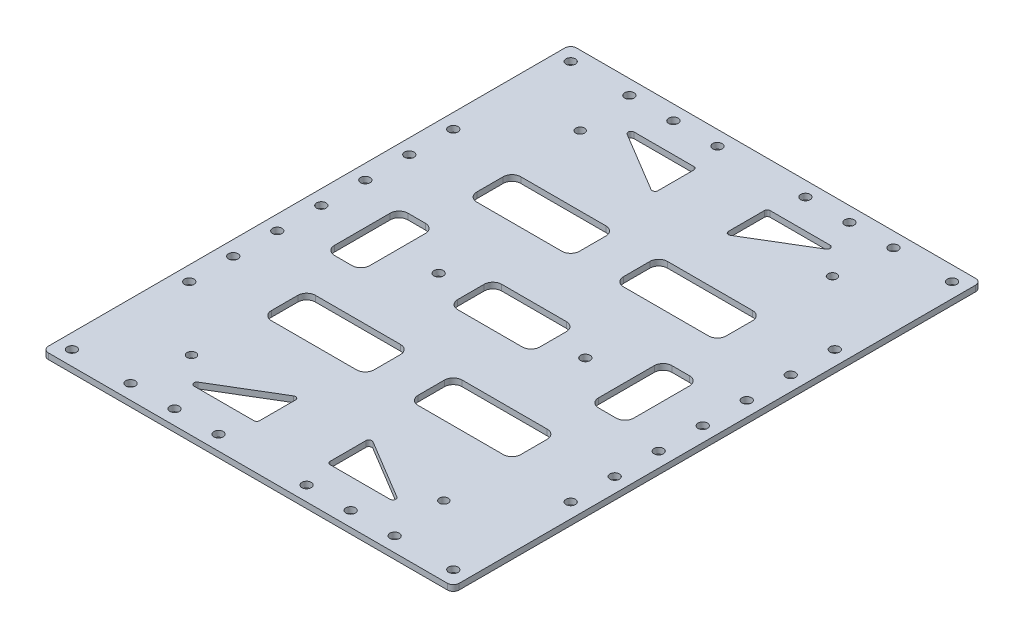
ISO-10303-21;
HEADER;
FILE_DESCRIPTION(('STEP AP214'),'2;1');
FILE_NAME('part.step','',(''),(''),'','','');
FILE_SCHEMA(('AUTOMOTIVE_DESIGN { 1 0 10303 214 1 1 1 1 }'));
ENDSEC;
DATA;
#1=APPLICATION_CONTEXT('core data for automotive mechanical design processes');
#2=APPLICATION_PROTOCOL_DEFINITION('international standard','automotive_design',2000,#1);
#3=PRODUCT_CONTEXT('',#1,'mechanical');
#4=PRODUCT('Part','Part','',(#3));
#5=PRODUCT_RELATED_PRODUCT_CATEGORY('part','',(#4));
#6=PRODUCT_DEFINITION_FORMATION('','',#4);
#7=PRODUCT_DEFINITION_CONTEXT('part definition',#1,'design');
#8=PRODUCT_DEFINITION('design','',#6,#7);
#9=PRODUCT_DEFINITION_SHAPE('','',#8);
#10=(LENGTH_UNIT() NAMED_UNIT(*) SI_UNIT(.MILLI.,.METRE.));
#11=(NAMED_UNIT(*) PLANE_ANGLE_UNIT() SI_UNIT($,.RADIAN.));
#12=(NAMED_UNIT(*) SI_UNIT($,.STERADIAN.) SOLID_ANGLE_UNIT());
#13=UNCERTAINTY_MEASURE_WITH_UNIT(LENGTH_MEASURE(1.E-05),#10,'distance_accuracy_value','');
#14=(GEOMETRIC_REPRESENTATION_CONTEXT(3) GLOBAL_UNCERTAINTY_ASSIGNED_CONTEXT((#13)) GLOBAL_UNIT_ASSIGNED_CONTEXT((#10,
#11,#12)) REPRESENTATION_CONTEXT('',''));
#15=CARTESIAN_POINT('',(0.,0.,0.));
#16=DIRECTION('',(0.,0.,1.));
#17=DIRECTION('',(1.,0.,0.));
#18=AXIS2_PLACEMENT_3D('',#15,#16,#17);
#19=CARTESIAN_POINT('',(-90.,2.,-90.));
#20=DIRECTION('',(0.,0.,1.));
#21=DIRECTION('',(1.,0.,0.));
#22=AXIS2_PLACEMENT_3D('',#19,#20,#21);
#23=PLANE('',#22);
#24=DIRECTION('',(-1.,0.,0.));
#25=VECTOR('',#24,1.);
#26=CARTESIAN_POINT('',(-90.,2.,-90.));
#27=LINE('',#26,#25);
#28=CARTESIAN_POINT('',(68.,2.,-90.));
#29=VERTEX_POINT('',#28);
#30=CARTESIAN_POINT('',(-68.,2.,-90.));
#31=VERTEX_POINT('',#30);
#32=EDGE_CURVE('E1182',#29,#31,#27,.T.);
#33=ORIENTED_EDGE('',*,*,#32,.F.);
#34=DIRECTION('',(0.,1.,0.));
#35=VECTOR('',#34,1.);
#36=CARTESIAN_POINT('',(68.,2.,-90.));
#37=LINE('',#36,#35);
#38=CARTESIAN_POINT('',(68.,0.,-90.));
#39=VERTEX_POINT('',#38);
#40=EDGE_CURVE('E11',#29,#39,#37,.F.);
#41=ORIENTED_EDGE('',*,*,#40,.T.);
#42=DIRECTION('',(-1.,0.,0.));
#43=VECTOR('',#42,1.);
#44=CARTESIAN_POINT('',(-90.,0.,-90.));
#45=LINE('',#44,#43);
#46=CARTESIAN_POINT('',(-68.,0.,-90.));
#47=VERTEX_POINT('',#46);
#48=EDGE_CURVE('E1184',#39,#47,#45,.T.);
#49=ORIENTED_EDGE('',*,*,#48,.T.);
#50=DIRECTION('',(0.,1.,0.));
#51=VECTOR('',#50,1.);
#52=CARTESIAN_POINT('',(-68.,2.,-90.));
#53=LINE('',#52,#51);
#54=EDGE_CURVE('E54',#47,#31,#53,.T.);
#55=ORIENTED_EDGE('',*,*,#54,.T.);
#56=EDGE_LOOP('',(#33,#41,#49,#55));
#57=FACE_BOUND('',#56,.T.);
#58=ADVANCED_FACE('F45',(#57),#23,.F.);
#59=CARTESIAN_POINT('',(-90.,2.,90.));
#60=DIRECTION('',(0.,0.,-1.));
#61=DIRECTION('',(-1.,0.,0.));
#62=AXIS2_PLACEMENT_3D('',#59,#60,#61);
#63=PLANE('',#62);
#64=DIRECTION('',(1.,0.,0.));
#65=VECTOR('',#64,1.);
#66=CARTESIAN_POINT('',(-90.,2.,90.));
#67=LINE('',#66,#65);
#68=CARTESIAN_POINT('',(-68.,2.,90.));
#69=VERTEX_POINT('',#68);
#70=CARTESIAN_POINT('',(68.,2.,90.));
#71=VERTEX_POINT('',#70);
#72=EDGE_CURVE('E1192',#69,#71,#67,.T.);
#73=ORIENTED_EDGE('',*,*,#72,.F.);
#74=DIRECTION('',(0.,1.,0.));
#75=VECTOR('',#74,1.);
#76=CARTESIAN_POINT('',(-68.,2.,90.));
#77=LINE('',#76,#75);
#78=CARTESIAN_POINT('',(-68.,0.,90.));
#79=VERTEX_POINT('',#78);
#80=EDGE_CURVE('E1156',#69,#79,#77,.F.);
#81=ORIENTED_EDGE('',*,*,#80,.T.);
#82=DIRECTION('',(1.,0.,0.));
#83=VECTOR('',#82,1.);
#84=CARTESIAN_POINT('',(-90.,0.,90.));
#85=LINE('',#84,#83);
#86=CARTESIAN_POINT('',(68.,0.,90.));
#87=VERTEX_POINT('',#86);
#88=EDGE_CURVE('E1193',#79,#87,#85,.T.);
#89=ORIENTED_EDGE('',*,*,#88,.T.);
#90=DIRECTION('',(0.,1.,0.));
#91=VECTOR('',#90,1.);
#92=CARTESIAN_POINT('',(68.,2.,90.));
#93=LINE('',#92,#91);
#94=EDGE_CURVE('E1152',#87,#71,#93,.T.);
#95=ORIENTED_EDGE('',*,*,#94,.T.);
#96=EDGE_LOOP('',(#73,#81,#89,#95));
#97=FACE_BOUND('',#96,.T.);
#98=ADVANCED_FACE('F1706',(#97),#63,.F.);
#99=CARTESIAN_POINT('',(0.,2.,0.));
#100=DIRECTION('',(0.,-1.,0.));
#101=DIRECTION('',(0.,0.,-1.));
#102=AXIS2_PLACEMENT_3D('',#99,#100,#101);
#103=PLANE('',#102);
#104=CARTESIAN_POINT('',(25.,2.,0.));
#105=DIRECTION('',(0.,-1.,0.));
#106=DIRECTION('',(0.,0.,-1.));
#107=AXIS2_PLACEMENT_3D('',#104,#105,#106);
#108=CIRCLE('',#107,1.6);
#109=CARTESIAN_POINT('',(25.,2.,-1.60000000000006));
#110=VERTEX_POINT('',#109);
#111=EDGE_CURVE('E1730',#110,#110,#108,.F.);
#112=ORIENTED_EDGE('',*,*,#111,.F.);
#113=EDGE_LOOP('',(#112));
#114=FACE_BOUND('',#113,.T.);
#115=CARTESIAN_POINT('',(65.,2.,0.));
#116=DIRECTION('',(0.,-1.,0.));
#117=DIRECTION('',(0.,0.,-1.));
#118=AXIS2_PLACEMENT_3D('',#115,#116,#117);
#119=CIRCLE('',#118,1.60000000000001);
#120=CARTESIAN_POINT('',(65.,2.,-1.60000000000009));
#121=VERTEX_POINT('',#120);
#122=EDGE_CURVE('E3282',#121,#121,#119,.F.);
#123=ORIENTED_EDGE('',*,*,#122,.F.);
#124=EDGE_LOOP('',(#123));
#125=FACE_BOUND('',#124,.T.);
#126=CARTESIAN_POINT('',(45.,2.,85.0000000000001));
#127=DIRECTION('',(0.,-1.,0.));
#128=DIRECTION('',(0.,0.,-1.));
#129=AXIS2_PLACEMENT_3D('',#126,#127,#128);
#130=CIRCLE('',#129,1.60000000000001);
#131=CARTESIAN_POINT('',(45.,2.,83.4000000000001));
#132=VERTEX_POINT('',#131);
#133=EDGE_CURVE('E1130',#132,#132,#130,.T.);
#134=ORIENTED_EDGE('',*,*,#133,.T.);
#135=EDGE_LOOP('',(#134));
#136=FACE_BOUND('',#135,.T.);
#137=CARTESIAN_POINT('',(-65.,2.,-15.));
#138=DIRECTION('',(0.,-1.,0.));
#139=DIRECTION('',(0.,0.,-1.));
#140=AXIS2_PLACEMENT_3D('',#137,#138,#139);
#141=CIRCLE('',#140,1.6);
#142=CARTESIAN_POINT('',(-65.,2.,-16.6));
#143=VERTEX_POINT('',#142);
#144=EDGE_CURVE('E1538',#143,#143,#141,.T.);
#145=ORIENTED_EDGE('',*,*,#144,.T.);
#146=EDGE_LOOP('',(#145));
#147=FACE_BOUND('',#146,.T.);
#148=CARTESIAN_POINT('',(-65.,2.,-30.));
#149=DIRECTION('',(0.,-1.,0.));
#150=DIRECTION('',(0.,0.,-1.));
#151=AXIS2_PLACEMENT_3D('',#148,#149,#150);
#152=CIRCLE('',#151,1.6);
#153=CARTESIAN_POINT('',(-65.,2.,-31.6));
#154=VERTEX_POINT('',#153);
#155=EDGE_CURVE('E1534',#154,#154,#152,.T.);
#156=ORIENTED_EDGE('',*,*,#155,.T.);
#157=EDGE_LOOP('',(#156));
#158=FACE_BOUND('',#157,.T.);
#159=CARTESIAN_POINT('',(65.,2.,-30.));
#160=DIRECTION('',(0.,-1.,0.));
#161=DIRECTION('',(0.,0.,-1.));
#162=AXIS2_PLACEMENT_3D('',#159,#160,#161);
#163=CIRCLE('',#162,1.6);
#164=CARTESIAN_POINT('',(65.,2.,-31.6));
#165=VERTEX_POINT('',#164);
#166=EDGE_CURVE('E1530',#165,#165,#163,.T.);
#167=ORIENTED_EDGE('',*,*,#166,.T.);
#168=EDGE_LOOP('',(#167));
#169=FACE_BOUND('',#168,.T.);
#170=CARTESIAN_POINT('',(65.,2.,-15.));
#171=DIRECTION('',(0.,-1.,0.));
#172=DIRECTION('',(0.,0.,-1.));
#173=AXIS2_PLACEMENT_3D('',#170,#171,#172);
#174=CIRCLE('',#173,1.6);
#175=CARTESIAN_POINT('',(65.,2.,-16.6));
#176=VERTEX_POINT('',#175);
#177=EDGE_CURVE('E1526',#176,#176,#174,.T.);
#178=ORIENTED_EDGE('',*,*,#177,.T.);
#179=EDGE_LOOP('',(#178));
#180=FACE_BOUND('',#179,.T.);
#181=CARTESIAN_POINT('',(65.0000000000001,2.,-45.));
#182=DIRECTION('',(0.,-1.,0.));
#183=DIRECTION('',(0.,0.,-1.));
#184=AXIS2_PLACEMENT_3D('',#181,#182,#183);
#185=CIRCLE('',#184,1.60000000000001);
#186=CARTESIAN_POINT('',(65.0000000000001,2.,-46.6));
#187=VERTEX_POINT('',#186);
#188=EDGE_CURVE('E1522',#187,#187,#185,.T.);
#189=ORIENTED_EDGE('',*,*,#188,.T.);
#190=EDGE_LOOP('',(#189));
#191=FACE_BOUND('',#190,.T.);
#192=CARTESIAN_POINT('',(65.0000000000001,2.,45.));
#193=DIRECTION('',(0.,-1.,0.));
#194=DIRECTION('',(0.,0.,-1.));
#195=AXIS2_PLACEMENT_3D('',#192,#193,#194);
#196=CIRCLE('',#195,1.60000000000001);
#197=CARTESIAN_POINT('',(65.0000000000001,2.,43.4));
#198=VERTEX_POINT('',#197);
#199=EDGE_CURVE('E1518',#198,#198,#196,.T.);
#200=ORIENTED_EDGE('',*,*,#199,.T.);
#201=EDGE_LOOP('',(#200));
#202=FACE_BOUND('',#201,.T.);
#203=CARTESIAN_POINT('',(65.,2.,15.));
#204=DIRECTION('',(0.,-1.,0.));
#205=DIRECTION('',(0.,0.,-1.));
#206=AXIS2_PLACEMENT_3D('',#203,#204,#205);
#207=CIRCLE('',#206,1.6);
#208=CARTESIAN_POINT('',(65.,2.,13.4));
#209=VERTEX_POINT('',#208);
#210=EDGE_CURVE('E1514',#209,#209,#207,.T.);
#211=ORIENTED_EDGE('',*,*,#210,.T.);
#212=EDGE_LOOP('',(#211));
#213=FACE_BOUND('',#212,.T.);
#214=CARTESIAN_POINT('',(30.,2.,85.0000000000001));
#215=DIRECTION('',(0.,-1.,0.));
#216=DIRECTION('',(0.,0.,-1.));
#217=AXIS2_PLACEMENT_3D('',#214,#215,#216);
#218=CIRCLE('',#217,1.60000000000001);
#219=CARTESIAN_POINT('',(30.,2.,83.4000000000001));
#220=VERTEX_POINT('',#219);
#221=EDGE_CURVE('E1510',#220,#220,#218,.T.);
#222=ORIENTED_EDGE('',*,*,#221,.T.);
#223=EDGE_LOOP('',(#222));
#224=FACE_BOUND('',#223,.T.);
#225=CARTESIAN_POINT('',(15.,2.,85.0000000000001));
#226=DIRECTION('',(0.,-1.,0.));
#227=DIRECTION('',(0.,0.,-1.));
#228=AXIS2_PLACEMENT_3D('',#225,#226,#227);
#229=CIRCLE('',#228,1.60000000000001);
#230=CARTESIAN_POINT('',(15.,2.,83.4000000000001));
#231=VERTEX_POINT('',#230);
#232=EDGE_CURVE('E1506',#231,#231,#229,.T.);
#233=ORIENTED_EDGE('',*,*,#232,.T.);
#234=EDGE_LOOP('',(#233));
#235=FACE_BOUND('',#234,.T.);
#236=CARTESIAN_POINT('',(-15.,2.,85.0000000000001));
#237=DIRECTION('',(0.,-1.,0.));
#238=DIRECTION('',(0.,0.,-1.));
#239=AXIS2_PLACEMENT_3D('',#236,#237,#238);
#240=CIRCLE('',#239,1.6);
#241=CARTESIAN_POINT('',(-15.,2.,83.4000000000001));
#242=VERTEX_POINT('',#241);
#243=EDGE_CURVE('E1503',#242,#242,#240,.T.);
#244=ORIENTED_EDGE('',*,*,#243,.T.);
#245=EDGE_LOOP('',(#244));
#246=FACE_BOUND('',#245,.T.);
#247=CARTESIAN_POINT('',(-30.,2.,85.0000000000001));
#248=DIRECTION('',(0.,-1.,0.));
#249=DIRECTION('',(0.,0.,-1.));
#250=AXIS2_PLACEMENT_3D('',#247,#248,#249);
#251=CIRCLE('',#250,1.60000000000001);
#252=CARTESIAN_POINT('',(-30.,2.,83.4000000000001));
#253=VERTEX_POINT('',#252);
#254=EDGE_CURVE('E1499',#253,#253,#251,.T.);
#255=ORIENTED_EDGE('',*,*,#254,.T.);
#256=EDGE_LOOP('',(#255));
#257=FACE_BOUND('',#256,.T.);
#258=CARTESIAN_POINT('',(-45.,2.,85.0000000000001));
#259=DIRECTION('',(0.,-1.,0.));
#260=DIRECTION('',(0.,0.,-1.));
#261=AXIS2_PLACEMENT_3D('',#258,#259,#260);
#262=CIRCLE('',#261,1.60000000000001);
#263=CARTESIAN_POINT('',(-45.,2.,83.4000000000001));
#264=VERTEX_POINT('',#263);
#265=EDGE_CURVE('E1495',#264,#264,#262,.T.);
#266=ORIENTED_EDGE('',*,*,#265,.T.);
#267=EDGE_LOOP('',(#266));
#268=FACE_BOUND('',#267,.T.);
#269=CARTESIAN_POINT('',(-65.,2.,45.));
#270=DIRECTION('',(0.,-1.,0.));
#271=DIRECTION('',(0.,0.,-1.));
#272=AXIS2_PLACEMENT_3D('',#269,#270,#271);
#273=CIRCLE('',#272,1.60000000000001);
#274=CARTESIAN_POINT('',(-65.,2.,43.4));
#275=VERTEX_POINT('',#274);
#276=EDGE_CURVE('E1491',#275,#275,#273,.T.);
#277=ORIENTED_EDGE('',*,*,#276,.T.);
#278=EDGE_LOOP('',(#277));
#279=FACE_BOUND('',#278,.T.);
#280=CARTESIAN_POINT('',(-65.,2.,-45.));
#281=DIRECTION('',(0.,-1.,0.));
#282=DIRECTION('',(0.,0.,-1.));
#283=AXIS2_PLACEMENT_3D('',#280,#281,#282);
#284=CIRCLE('',#283,1.60000000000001);
#285=CARTESIAN_POINT('',(-65.,2.,-46.6));
#286=VERTEX_POINT('',#285);
#287=EDGE_CURVE('E1487',#286,#286,#284,.T.);
#288=ORIENTED_EDGE('',*,*,#287,.T.);
#289=EDGE_LOOP('',(#288));
#290=FACE_BOUND('',#289,.T.);
#291=CARTESIAN_POINT('',(-65.,2.,15.));
#292=DIRECTION('',(0.,-1.,0.));
#293=DIRECTION('',(0.,0.,-1.));
#294=AXIS2_PLACEMENT_3D('',#291,#292,#293);
#295=CIRCLE('',#294,1.6);
#296=CARTESIAN_POINT('',(-65.,2.,13.4));
#297=VERTEX_POINT('',#296);
#298=EDGE_CURVE('E1483',#297,#297,#295,.T.);
#299=ORIENTED_EDGE('',*,*,#298,.T.);
#300=EDGE_LOOP('',(#299));
#301=FACE_BOUND('',#300,.T.);
#302=CARTESIAN_POINT('',(-65.,2.,-85.0000000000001));
#303=DIRECTION('',(0.,-1.,0.));
#304=DIRECTION('',(0.,0.,-1.));
#305=AXIS2_PLACEMENT_3D('',#302,#303,#304);
#306=CIRCLE('',#305,1.60000000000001);
#307=CARTESIAN_POINT('',(-65.,2.,-86.6000000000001));
#308=VERTEX_POINT('',#307);
#309=EDGE_CURVE('E1479',#308,#308,#306,.T.);
#310=ORIENTED_EDGE('',*,*,#309,.T.);
#311=EDGE_LOOP('',(#310));
#312=FACE_BOUND('',#311,.T.);
#313=CARTESIAN_POINT('',(65.0000000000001,2.,-85.0000000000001));
#314=DIRECTION('',(0.,-1.,0.));
#315=DIRECTION('',(0.,0.,-1.));
#316=AXIS2_PLACEMENT_3D('',#313,#314,#315);
#317=CIRCLE('',#316,1.60000000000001);
#318=CARTESIAN_POINT('',(65.0000000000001,2.,-86.6000000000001));
#319=VERTEX_POINT('',#318);
#320=EDGE_CURVE('E1475',#319,#319,#317,.T.);
#321=ORIENTED_EDGE('',*,*,#320,.T.);
#322=EDGE_LOOP('',(#321));
#323=FACE_BOUND('',#322,.T.);
#324=CARTESIAN_POINT('',(65.0000000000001,2.,85.0000000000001));
#325=DIRECTION('',(0.,-1.,0.));
#326=DIRECTION('',(0.,0.,-1.));
#327=AXIS2_PLACEMENT_3D('',#324,#325,#326);
#328=CIRCLE('',#327,1.60000000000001);
#329=CARTESIAN_POINT('',(65.0000000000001,2.,83.4000000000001));
#330=VERTEX_POINT('',#329);
#331=EDGE_CURVE('E1471',#330,#330,#328,.T.);
#332=ORIENTED_EDGE('',*,*,#331,.T.);
#333=EDGE_LOOP('',(#332));
#334=FACE_BOUND('',#333,.T.);
#335=CARTESIAN_POINT('',(-65.,2.,85.0000000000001));
#336=DIRECTION('',(0.,-1.,0.));
#337=DIRECTION('',(0.,0.,-1.));
#338=AXIS2_PLACEMENT_3D('',#335,#336,#337);
#339=CIRCLE('',#338,1.60000000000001);
#340=CARTESIAN_POINT('',(-65.,2.,83.4000000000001));
#341=VERTEX_POINT('',#340);
#342=EDGE_CURVE('E1467',#341,#341,#339,.T.);
#343=ORIENTED_EDGE('',*,*,#342,.T.);
#344=EDGE_LOOP('',(#343));
#345=FACE_BOUND('',#344,.T.);
#346=CARTESIAN_POINT('',(-45.,2.,-85.0000000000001));
#347=DIRECTION('',(0.,-1.,0.));
#348=DIRECTION('',(0.,0.,-1.));
#349=AXIS2_PLACEMENT_3D('',#346,#347,#348);
#350=CIRCLE('',#349,1.60000000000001);
#351=CARTESIAN_POINT('',(-45.,2.,-86.6000000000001));
#352=VERTEX_POINT('',#351);
#353=EDGE_CURVE('E1463',#352,#352,#350,.T.);
#354=ORIENTED_EDGE('',*,*,#353,.T.);
#355=EDGE_LOOP('',(#354));
#356=FACE_BOUND('',#355,.T.);
#357=CARTESIAN_POINT('',(-30.,2.,-85.0000000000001));
#358=DIRECTION('',(0.,-1.,0.));
#359=DIRECTION('',(0.,0.,-1.));
#360=AXIS2_PLACEMENT_3D('',#357,#358,#359);
#361=CIRCLE('',#360,1.60000000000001);
#362=CARTESIAN_POINT('',(-30.,2.,-86.6000000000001));
#363=VERTEX_POINT('',#362);
#364=EDGE_CURVE('E1459',#363,#363,#361,.T.);
#365=ORIENTED_EDGE('',*,*,#364,.T.);
#366=EDGE_LOOP('',(#365));
#367=FACE_BOUND('',#366,.T.);
#368=CARTESIAN_POINT('',(-15.,2.,-85.0000000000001));
#369=DIRECTION('',(0.,-1.,0.));
#370=DIRECTION('',(0.,0.,-1.));
#371=AXIS2_PLACEMENT_3D('',#368,#369,#370);
#372=CIRCLE('',#371,1.6);
#373=CARTESIAN_POINT('',(-15.,2.,-86.6000000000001));
#374=VERTEX_POINT('',#373);
#375=EDGE_CURVE('E1455',#374,#374,#372,.T.);
#376=ORIENTED_EDGE('',*,*,#375,.T.);
#377=EDGE_LOOP('',(#376));
#378=FACE_BOUND('',#377,.T.);
#379=CARTESIAN_POINT('',(15.,2.,-85.0000000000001));
#380=DIRECTION('',(0.,-1.,0.));
#381=DIRECTION('',(0.,0.,-1.));
#382=AXIS2_PLACEMENT_3D('',#379,#380,#381);
#383=CIRCLE('',#382,1.60000000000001);
#384=CARTESIAN_POINT('',(15.,2.,-86.6000000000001));
#385=VERTEX_POINT('',#384);
#386=EDGE_CURVE('E1451',#385,#385,#383,.T.);
#387=ORIENTED_EDGE('',*,*,#386,.T.);
#388=EDGE_LOOP('',(#387));
#389=FACE_BOUND('',#388,.T.);
#390=CARTESIAN_POINT('',(30.,2.,-85.0000000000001));
#391=DIRECTION('',(0.,-1.,0.));
#392=DIRECTION('',(0.,0.,-1.));
#393=AXIS2_PLACEMENT_3D('',#390,#391,#392);
#394=CIRCLE('',#393,1.60000000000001);
#395=CARTESIAN_POINT('',(30.,2.,-86.6000000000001));
#396=VERTEX_POINT('',#395);
#397=EDGE_CURVE('E1440',#396,#396,#394,.T.);
#398=ORIENTED_EDGE('',*,*,#397,.T.);
#399=EDGE_LOOP('',(#398));
#400=FACE_BOUND('',#399,.T.);
#401=CARTESIAN_POINT('',(45.,2.,-85.0000000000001));
#402=DIRECTION('',(0.,-1.,0.));
#403=DIRECTION('',(0.,0.,-1.));
#404=AXIS2_PLACEMENT_3D('',#401,#402,#403);
#405=CIRCLE('',#404,1.60000000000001);
#406=CARTESIAN_POINT('',(45.,2.,-86.6000000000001));
#407=VERTEX_POINT('',#406);
#408=EDGE_CURVE('E1433',#407,#407,#405,.T.);
#409=ORIENTED_EDGE('',*,*,#408,.T.);
#410=EDGE_LOOP('',(#409));
#411=FACE_BOUND('',#410,.T.);
#412=CARTESIAN_POINT('',(65.,2.,30.));
#413=DIRECTION('',(0.,-1.,0.));
#414=DIRECTION('',(0.,0.,-1.));
#415=AXIS2_PLACEMENT_3D('',#412,#413,#414);
#416=CIRCLE('',#415,1.6);
#417=CARTESIAN_POINT('',(65.,2.,28.4));
#418=VERTEX_POINT('',#417);
#419=EDGE_CURVE('E1431',#418,#418,#416,.T.);
#420=ORIENTED_EDGE('',*,*,#419,.T.);
#421=EDGE_LOOP('',(#420));
#422=FACE_BOUND('',#421,.T.);
#423=CARTESIAN_POINT('',(-65.,2.,30.));
#424=DIRECTION('',(0.,-1.,0.));
#425=DIRECTION('',(0.,0.,-1.));
#426=AXIS2_PLACEMENT_3D('',#423,#424,#425);
#427=CIRCLE('',#426,1.6);
#428=CARTESIAN_POINT('',(-65.,2.,28.4));
#429=VERTEX_POINT('',#428);
#430=EDGE_CURVE('E1434',#429,#429,#427,.T.);
#431=ORIENTED_EDGE('',*,*,#430,.T.);
#432=EDGE_LOOP('',(#431));
#433=FACE_BOUND('',#432,.T.);
#434=DIRECTION('',(0.,0.,-1.));
#435=VECTOR('',#434,1.);
#436=CARTESIAN_POINT('',(-12.0000000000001,2.,75.));
#437=LINE('',#436,#435);
#438=CARTESIAN_POINT('',(-12.0000000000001,2.,74.));
#439=VERTEX_POINT('',#438);
#440=CARTESIAN_POINT('',(-12.0000000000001,2.,61.766190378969));
#441=VERTEX_POINT('',#440);
#442=EDGE_CURVE('E1670',#439,#441,#437,.T.);
#443=ORIENTED_EDGE('',*,*,#442,.F.);
#444=CARTESIAN_POINT('',(-13.0000000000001,2.,74.));
#445=DIRECTION('',(0.,-1.,0.));
#446=DIRECTION('',(0.,0.,-1.));
#447=AXIS2_PLACEMENT_3D('',#444,#445,#446);
#448=CIRCLE('',#447,1.);
#449=CARTESIAN_POINT('',(-13.0000000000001,2.,75.));
#450=VERTEX_POINT('',#449);
#451=EDGE_CURVE('E1060',#439,#450,#448,.T.);
#452=ORIENTED_EDGE('',*,*,#451,.T.);
#453=DIRECTION('',(1.,0.,0.));
#454=VECTOR('',#453,1.);
#455=CARTESIAN_POINT('',(-37.,2.,75.));
#456=LINE('',#455,#454);
#457=CARTESIAN_POINT('',(-33.3896827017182,2.,75.));
#458=VERTEX_POINT('',#457);
#459=EDGE_CURVE('E1660',#458,#450,#456,.T.);
#460=ORIENTED_EDGE('',*,*,#459,.F.);
#461=CARTESIAN_POINT('',(-33.3896827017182,2.,74.));
#462=DIRECTION('',(0.,-1.,0.));
#463=DIRECTION('',(0.,0.,-1.));
#464=AXIS2_PLACEMENT_3D('',#461,#462,#463);
#465=CIRCLE('',#464,1.);
#466=CARTESIAN_POINT('',(-33.9041784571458,2.,73.1425070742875));
#467=VERTEX_POINT('',#466);
#468=EDGE_CURVE('E1048',#458,#467,#465,.T.);
#469=ORIENTED_EDGE('',*,*,#468,.T.);
#470=DIRECTION('',(-0.857492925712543,0.,0.514495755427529));
#471=VECTOR('',#470,1.);
#472=CARTESIAN_POINT('',(-12.0000000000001,2.,60.));
#473=LINE('',#472,#471);
#474=CARTESIAN_POINT('',(-13.5144957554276,2.,60.9086974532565));
#475=VERTEX_POINT('',#474);
#476=EDGE_CURVE('E1140',#475,#467,#473,.T.);
#477=ORIENTED_EDGE('',*,*,#476,.F.);
#478=CARTESIAN_POINT('',(-13.0000000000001,2.,61.766190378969));
#479=DIRECTION('',(0.,-1.,0.));
#480=DIRECTION('',(0.,0.,-1.));
#481=AXIS2_PLACEMENT_3D('',#478,#479,#480);
#482=CIRCLE('',#481,1.);
#483=EDGE_CURVE('E1054',#475,#441,#482,.T.);
#484=ORIENTED_EDGE('',*,*,#483,.T.);
#485=EDGE_LOOP('',(#443,#452,#460,#469,#477,#484));
#486=FACE_BOUND('',#485,.T.);
#487=DIRECTION('',(0.,0.,1.));
#488=VECTOR('',#487,1.);
#489=CARTESIAN_POINT('',(12.,2.,75.));
#490=LINE('',#489,#488);
#491=CARTESIAN_POINT('',(11.9999999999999,2.,61.7661903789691));
#492=VERTEX_POINT('',#491);
#493=CARTESIAN_POINT('',(12.,2.,74.));
#494=VERTEX_POINT('',#493);
#495=EDGE_CURVE('E1659',#492,#494,#490,.T.);
#496=ORIENTED_EDGE('',*,*,#495,.F.);
#497=CARTESIAN_POINT('',(12.9999999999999,2.,61.7661903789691));
#498=DIRECTION('',(0.,-1.,0.));
#499=DIRECTION('',(0.,0.,-1.));
#500=AXIS2_PLACEMENT_3D('',#497,#498,#499);
#501=CIRCLE('',#500,1.);
#502=CARTESIAN_POINT('',(13.5144957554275,2.,60.9086974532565));
#503=VERTEX_POINT('',#502);
#504=EDGE_CURVE('E1066',#492,#503,#501,.T.);
#505=ORIENTED_EDGE('',*,*,#504,.T.);
#506=DIRECTION('',(-0.857492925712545,0.,-0.514495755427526));
#507=VECTOR('',#506,1.);
#508=CARTESIAN_POINT('',(11.9999999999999,2.,60.));
#509=LINE('',#508,#507);
#510=CARTESIAN_POINT('',(33.9041784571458,2.,73.1425070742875));
#511=VERTEX_POINT('',#510);
#512=EDGE_CURVE('E1596',#511,#503,#509,.T.);
#513=ORIENTED_EDGE('',*,*,#512,.F.);
#514=CARTESIAN_POINT('',(33.3896827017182,2.,74.));
#515=DIRECTION('',(0.,-1.,0.));
#516=DIRECTION('',(0.,0.,-1.));
#517=AXIS2_PLACEMENT_3D('',#514,#515,#516);
#518=CIRCLE('',#517,1.);
#519=CARTESIAN_POINT('',(33.3896827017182,2.,75.));
#520=VERTEX_POINT('',#519);
#521=EDGE_CURVE('E1078',#511,#520,#518,.T.);
#522=ORIENTED_EDGE('',*,*,#521,.T.);
#523=DIRECTION('',(1.,0.,0.));
#524=VECTOR('',#523,1.);
#525=CARTESIAN_POINT('',(37.,2.,75.));
#526=LINE('',#525,#524);
#527=CARTESIAN_POINT('',(13.,2.,75.));
#528=VERTEX_POINT('',#527);
#529=EDGE_CURVE('E1655',#528,#520,#526,.T.);
#530=ORIENTED_EDGE('',*,*,#529,.F.);
#531=CARTESIAN_POINT('',(13.,2.,74.));
#532=DIRECTION('',(0.,-1.,0.));
#533=DIRECTION('',(0.,0.,-1.));
#534=AXIS2_PLACEMENT_3D('',#531,#532,#533);
#535=CIRCLE('',#534,1.);
#536=EDGE_CURVE('E1072',#528,#494,#535,.T.);
#537=ORIENTED_EDGE('',*,*,#536,.T.);
#538=EDGE_LOOP('',(#496,#505,#513,#522,#530,#537));
#539=FACE_BOUND('',#538,.T.);
#540=DIRECTION('',(-1.,0.,0.));
#541=VECTOR('',#540,1.);
#542=CARTESIAN_POINT('',(-42.5,2.,-42.5));
#543=LINE('',#542,#541);
#544=CARTESIAN_POINT('',(-10.5,2.,-42.5));
#545=VERTEX_POINT('',#544);
#546=CARTESIAN_POINT('',(-39.5,2.,-42.5));
#547=VERTEX_POINT('',#546);
#548=EDGE_CURVE('E1610',#545,#547,#543,.T.);
#549=ORIENTED_EDGE('',*,*,#548,.F.);
#550=CARTESIAN_POINT('',(-10.5,2.,-39.5));
#551=DIRECTION('',(0.,-1.,0.));
#552=DIRECTION('',(0.,0.,-1.));
#553=AXIS2_PLACEMENT_3D('',#550,#551,#552);
#554=CIRCLE('',#553,3.);
#555=CARTESIAN_POINT('',(-7.50000000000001,2.,-39.5));
#556=VERTEX_POINT('',#555);
#557=EDGE_CURVE('E850',#545,#556,#554,.T.);
#558=ORIENTED_EDGE('',*,*,#557,.T.);
#559=DIRECTION('',(0.,0.,-1.));
#560=VECTOR('',#559,1.);
#561=CARTESIAN_POINT('',(-7.50000000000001,2.,-27.5000000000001));
#562=LINE('',#561,#560);
#563=CARTESIAN_POINT('',(-7.50000000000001,2.,-30.5));
#564=VERTEX_POINT('',#563);
#565=EDGE_CURVE('E1614',#564,#556,#562,.T.);
#566=ORIENTED_EDGE('',*,*,#565,.F.);
#567=CARTESIAN_POINT('',(-10.5,2.,-30.5));
#568=DIRECTION('',(0.,-1.,0.));
#569=DIRECTION('',(0.,0.,-1.));
#570=AXIS2_PLACEMENT_3D('',#567,#568,#569);
#571=CIRCLE('',#570,3.);
#572=CARTESIAN_POINT('',(-10.5,2.,-27.5000000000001));
#573=VERTEX_POINT('',#572);
#574=EDGE_CURVE('E838',#564,#573,#571,.T.);
#575=ORIENTED_EDGE('',*,*,#574,.T.);
#576=DIRECTION('',(1.,0.,0.));
#577=VECTOR('',#576,1.);
#578=CARTESIAN_POINT('',(-42.5,2.,-27.5000000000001));
#579=LINE('',#578,#577);
#580=CARTESIAN_POINT('',(-39.5,2.,-27.5000000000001));
#581=VERTEX_POINT('',#580);
#582=EDGE_CURVE('E1427',#581,#573,#579,.T.);
#583=ORIENTED_EDGE('',*,*,#582,.F.);
#584=CARTESIAN_POINT('',(-39.5,2.,-30.5));
#585=DIRECTION('',(0.,-1.,0.));
#586=DIRECTION('',(0.,0.,-1.));
#587=AXIS2_PLACEMENT_3D('',#584,#585,#586);
#588=CIRCLE('',#587,3.);
#589=CARTESIAN_POINT('',(-42.5,2.,-30.5));
#590=VERTEX_POINT('',#589);
#591=EDGE_CURVE('E862',#581,#590,#588,.T.);
#592=ORIENTED_EDGE('',*,*,#591,.T.);
#593=DIRECTION('',(0.,0.,1.));
#594=VECTOR('',#593,1.);
#595=CARTESIAN_POINT('',(-42.5,2.,-27.5000000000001));
#596=LINE('',#595,#594);
#597=CARTESIAN_POINT('',(-42.5,2.,-39.5));
#598=VERTEX_POINT('',#597);
#599=EDGE_CURVE('E1606',#598,#590,#596,.T.);
#600=ORIENTED_EDGE('',*,*,#599,.F.);
#601=CARTESIAN_POINT('',(-39.5,2.,-39.5));
#602=DIRECTION('',(0.,-1.,0.));
#603=DIRECTION('',(0.,0.,-1.));
#604=AXIS2_PLACEMENT_3D('',#601,#602,#603);
#605=CIRCLE('',#604,3.);
#606=EDGE_CURVE('E856',#598,#547,#605,.T.);
#607=ORIENTED_EDGE('',*,*,#606,.T.);
#608=EDGE_LOOP('',(#549,#558,#566,#575,#583,#592,#600,#607));
#609=FACE_BOUND('',#608,.T.);
#610=DIRECTION('',(-1.,0.,0.));
#611=VECTOR('',#610,1.);
#612=CARTESIAN_POINT('',(42.5,2.,-42.5000000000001));
#613=LINE('',#612,#611);
#614=CARTESIAN_POINT('',(39.5,2.,-42.5000000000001));
#615=VERTEX_POINT('',#614);
#616=CARTESIAN_POINT('',(10.5,2.,-42.5));
#617=VERTEX_POINT('',#616);
#618=EDGE_CURVE('E1428',#615,#617,#613,.T.);
#619=ORIENTED_EDGE('',*,*,#618,.F.);
#620=CARTESIAN_POINT('',(39.5,2.,-39.5000000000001));
#621=DIRECTION('',(0.,-1.,0.));
#622=DIRECTION('',(0.,0.,-1.));
#623=AXIS2_PLACEMENT_3D('',#620,#621,#622);
#624=CIRCLE('',#623,3.);
#625=CARTESIAN_POINT('',(42.5,2.,-39.5000000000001));
#626=VERTEX_POINT('',#625);
#627=EDGE_CURVE('E910',#615,#626,#624,.T.);
#628=ORIENTED_EDGE('',*,*,#627,.T.);
#629=DIRECTION('',(0.,0.,-1.));
#630=VECTOR('',#629,1.);
#631=CARTESIAN_POINT('',(42.5,2.,-27.5000000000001));
#632=LINE('',#631,#630);
#633=CARTESIAN_POINT('',(42.5,2.,-30.5000000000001));
#634=VERTEX_POINT('',#633);
#635=EDGE_CURVE('E1425',#634,#626,#632,.T.);
#636=ORIENTED_EDGE('',*,*,#635,.F.);
#637=CARTESIAN_POINT('',(39.5,2.,-30.5000000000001));
#638=DIRECTION('',(0.,-1.,0.));
#639=DIRECTION('',(0.,0.,-1.));
#640=AXIS2_PLACEMENT_3D('',#637,#638,#639);
#641=CIRCLE('',#640,3.);
#642=CARTESIAN_POINT('',(39.5,2.,-27.5000000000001));
#643=VERTEX_POINT('',#642);
#644=EDGE_CURVE('E904',#634,#643,#641,.T.);
#645=ORIENTED_EDGE('',*,*,#644,.T.);
#646=DIRECTION('',(1.,0.,0.));
#647=VECTOR('',#646,1.);
#648=CARTESIAN_POINT('',(42.5,2.,-27.5000000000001));
#649=LINE('',#648,#647);
#650=CARTESIAN_POINT('',(10.5,2.,-27.5000000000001));
#651=VERTEX_POINT('',#650);
#652=EDGE_CURVE('E1619',#651,#643,#649,.T.);
#653=ORIENTED_EDGE('',*,*,#652,.F.);
#654=CARTESIAN_POINT('',(10.5,2.,-30.5000000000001));
#655=DIRECTION('',(0.,-1.,0.));
#656=DIRECTION('',(0.,0.,-1.));
#657=AXIS2_PLACEMENT_3D('',#654,#655,#656);
#658=CIRCLE('',#657,3.);
#659=CARTESIAN_POINT('',(7.50000000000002,2.,-30.5000000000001));
#660=VERTEX_POINT('',#659);
#661=EDGE_CURVE('E898',#651,#660,#658,.T.);
#662=ORIENTED_EDGE('',*,*,#661,.T.);
#663=DIRECTION('',(0.,0.,1.));
#664=VECTOR('',#663,1.);
#665=CARTESIAN_POINT('',(7.50000000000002,2.,-27.5000000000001));
#666=LINE('',#665,#664);
#667=CARTESIAN_POINT('',(7.50000000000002,2.,-39.5));
#668=VERTEX_POINT('',#667);
#669=EDGE_CURVE('E1623',#668,#660,#666,.T.);
#670=ORIENTED_EDGE('',*,*,#669,.F.);
#671=CARTESIAN_POINT('',(10.5,2.,-39.5));
#672=DIRECTION('',(0.,-1.,0.));
#673=DIRECTION('',(0.,0.,-1.));
#674=AXIS2_PLACEMENT_3D('',#671,#672,#673);
#675=CIRCLE('',#674,3.);
#676=EDGE_CURVE('E892',#668,#617,#675,.T.);
#677=ORIENTED_EDGE('',*,*,#676,.T.);
#678=EDGE_LOOP('',(#619,#628,#636,#645,#653,#662,#670,#677));
#679=FACE_BOUND('',#678,.T.);
#680=DIRECTION('',(-1.,0.,0.));
#681=VECTOR('',#680,1.);
#682=CARTESIAN_POINT('',(-51.,2.,-12.5));
#683=LINE('',#682,#681);
#684=CARTESIAN_POINT('',(-42.,2.,-12.5));
#685=VERTEX_POINT('',#684);
#686=CARTESIAN_POINT('',(-48.,2.,-12.5));
#687=VERTEX_POINT('',#686);
#688=EDGE_CURVE('E1634',#685,#687,#683,.T.);
#689=ORIENTED_EDGE('',*,*,#688,.F.);
#690=CARTESIAN_POINT('',(-42.,2.,-9.50000000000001));
#691=DIRECTION('',(0.,-1.,0.));
#692=DIRECTION('',(0.,0.,-1.));
#693=AXIS2_PLACEMENT_3D('',#690,#691,#692);
#694=CIRCLE('',#693,3.);
#695=CARTESIAN_POINT('',(-39.,2.,-9.5));
#696=VERTEX_POINT('',#695);
#697=EDGE_CURVE('E844',#685,#696,#694,.T.);
#698=ORIENTED_EDGE('',*,*,#697,.T.);
#699=DIRECTION('',(0.,0.,-1.));
#700=VECTOR('',#699,1.);
#701=CARTESIAN_POINT('',(-39.,2.,12.5));
#702=LINE('',#701,#700);
#703=CARTESIAN_POINT('',(-39.,2.,9.49999999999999));
#704=VERTEX_POINT('',#703);
#705=EDGE_CURVE('E1624',#704,#696,#702,.T.);
#706=ORIENTED_EDGE('',*,*,#705,.F.);
#707=CARTESIAN_POINT('',(-42.,2.,9.49999999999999));
#708=DIRECTION('',(0.,-1.,0.));
#709=DIRECTION('',(0.,0.,-1.));
#710=AXIS2_PLACEMENT_3D('',#707,#708,#709);
#711=CIRCLE('',#710,3.);
#712=CARTESIAN_POINT('',(-42.,2.,12.5));
#713=VERTEX_POINT('',#712);
#714=EDGE_CURVE('E832',#704,#713,#711,.T.);
#715=ORIENTED_EDGE('',*,*,#714,.T.);
#716=DIRECTION('',(1.,0.,0.));
#717=VECTOR('',#716,1.);
#718=CARTESIAN_POINT('',(-51.,2.,12.5));
#719=LINE('',#718,#717);
#720=CARTESIAN_POINT('',(-48.,2.,12.5));
#721=VERTEX_POINT('',#720);
#722=EDGE_CURVE('E1419',#721,#713,#719,.T.);
#723=ORIENTED_EDGE('',*,*,#722,.F.);
#724=CARTESIAN_POINT('',(-48.,2.,9.49999999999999));
#725=DIRECTION('',(0.,-1.,0.));
#726=DIRECTION('',(0.,0.,-1.));
#727=AXIS2_PLACEMENT_3D('',#724,#725,#726);
#728=CIRCLE('',#727,3.);
#729=CARTESIAN_POINT('',(-51.,2.,9.49999999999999));
#730=VERTEX_POINT('',#729);
#731=EDGE_CURVE('E826',#721,#730,#728,.T.);
#732=ORIENTED_EDGE('',*,*,#731,.T.);
#733=DIRECTION('',(0.,0.,1.));
#734=VECTOR('',#733,1.);
#735=CARTESIAN_POINT('',(-51.,2.,12.5));
#736=LINE('',#735,#734);
#737=CARTESIAN_POINT('',(-51.,2.,-9.50000000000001));
#738=VERTEX_POINT('',#737);
#739=EDGE_CURVE('E1422',#738,#730,#736,.T.);
#740=ORIENTED_EDGE('',*,*,#739,.F.);
#741=CARTESIAN_POINT('',(-48.,2.,-9.50000000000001));
#742=DIRECTION('',(0.,-1.,0.));
#743=DIRECTION('',(0.,0.,-1.));
#744=AXIS2_PLACEMENT_3D('',#741,#742,#743);
#745=CIRCLE('',#744,3.);
#746=EDGE_CURVE('E820',#738,#687,#745,.T.);
#747=ORIENTED_EDGE('',*,*,#746,.T.);
#748=EDGE_LOOP('',(#689,#698,#706,#715,#723,#732,#740,#747));
#749=FACE_BOUND('',#748,.T.);
#750=DIRECTION('',(-1.,0.,0.));
#751=VECTOR('',#750,1.);
#752=CARTESIAN_POINT('',(51.,2.,-12.5));
#753=LINE('',#752,#751);
#754=CARTESIAN_POINT('',(48.,2.,-12.5));
#755=VERTEX_POINT('',#754);
#756=CARTESIAN_POINT('',(42.,2.,-12.5));
#757=VERTEX_POINT('',#756);
#758=EDGE_CURVE('E1648',#755,#757,#753,.T.);
#759=ORIENTED_EDGE('',*,*,#758,.F.);
#760=CARTESIAN_POINT('',(48.,2.,-9.50000000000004));
#761=DIRECTION('',(0.,-1.,0.));
#762=DIRECTION('',(0.,0.,-1.));
#763=AXIS2_PLACEMENT_3D('',#760,#761,#762);
#764=CIRCLE('',#763,3.);
#765=CARTESIAN_POINT('',(51.,2.,-9.50000000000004));
#766=VERTEX_POINT('',#765);
#767=EDGE_CURVE('E952',#755,#766,#764,.T.);
#768=ORIENTED_EDGE('',*,*,#767,.T.);
#769=DIRECTION('',(0.,0.,-1.));
#770=VECTOR('',#769,1.);
#771=CARTESIAN_POINT('',(51.,2.,12.5));
#772=LINE('',#771,#770);
#773=CARTESIAN_POINT('',(51.,2.,9.49999999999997));
#774=VERTEX_POINT('',#773);
#775=EDGE_CURVE('E1423',#774,#766,#772,.T.);
#776=ORIENTED_EDGE('',*,*,#775,.F.);
#777=CARTESIAN_POINT('',(48.,2.,9.49999999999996));
#778=DIRECTION('',(0.,-1.,0.));
#779=DIRECTION('',(0.,0.,-1.));
#780=AXIS2_PLACEMENT_3D('',#777,#778,#779);
#781=CIRCLE('',#780,3.);
#782=CARTESIAN_POINT('',(48.,2.,12.5));
#783=VERTEX_POINT('',#782);
#784=EDGE_CURVE('E958',#774,#783,#781,.T.);
#785=ORIENTED_EDGE('',*,*,#784,.T.);
#786=DIRECTION('',(1.,0.,0.));
#787=VECTOR('',#786,1.);
#788=CARTESIAN_POINT('',(51.,2.,12.5));
#789=LINE('',#788,#787);
#790=CARTESIAN_POINT('',(42.,2.,12.5));
#791=VERTEX_POINT('',#790);
#792=EDGE_CURVE('E1562',#791,#783,#789,.T.);
#793=ORIENTED_EDGE('',*,*,#792,.F.);
#794=CARTESIAN_POINT('',(42.,2.,9.49999999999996));
#795=DIRECTION('',(0.,-1.,0.));
#796=DIRECTION('',(0.,0.,-1.));
#797=AXIS2_PLACEMENT_3D('',#794,#795,#796);
#798=CIRCLE('',#797,3.);
#799=CARTESIAN_POINT('',(39.,2.,9.49999999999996));
#800=VERTEX_POINT('',#799);
#801=EDGE_CURVE('E940',#791,#800,#798,.T.);
#802=ORIENTED_EDGE('',*,*,#801,.T.);
#803=DIRECTION('',(0.,0.,1.));
#804=VECTOR('',#803,1.);
#805=CARTESIAN_POINT('',(39.,2.,12.5));
#806=LINE('',#805,#804);
#807=CARTESIAN_POINT('',(39.,2.,-9.50000000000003));
#808=VERTEX_POINT('',#807);
#809=EDGE_CURVE('E1644',#808,#800,#806,.T.);
#810=ORIENTED_EDGE('',*,*,#809,.F.);
#811=CARTESIAN_POINT('',(42.,2.,-9.50000000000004));
#812=DIRECTION('',(0.,-1.,0.));
#813=DIRECTION('',(0.,0.,-1.));
#814=AXIS2_PLACEMENT_3D('',#811,#812,#813);
#815=CIRCLE('',#814,3.);
#816=EDGE_CURVE('E946',#808,#757,#815,.T.);
#817=ORIENTED_EDGE('',*,*,#816,.T.);
#818=EDGE_LOOP('',(#759,#768,#776,#785,#793,#802,#810,#817));
#819=FACE_BOUND('',#818,.T.);
#820=DIRECTION('',(1.,0.,0.));
#821=VECTOR('',#820,1.);
#822=CARTESIAN_POINT('',(-42.5,2.,42.5));
#823=LINE('',#822,#821);
#824=CARTESIAN_POINT('',(-39.5,2.,42.5));
#825=VERTEX_POINT('',#824);
#826=CARTESIAN_POINT('',(-10.5,2.,42.5));
#827=VERTEX_POINT('',#826);
#828=EDGE_CURVE('E1554',#825,#827,#823,.T.);
#829=ORIENTED_EDGE('',*,*,#828,.F.);
#830=CARTESIAN_POINT('',(-39.5,2.,39.5));
#831=DIRECTION('',(0.,-1.,0.));
#832=DIRECTION('',(0.,0.,-1.));
#833=AXIS2_PLACEMENT_3D('',#830,#831,#832);
#834=CIRCLE('',#833,3.);
#835=CARTESIAN_POINT('',(-42.5,2.,39.5));
#836=VERTEX_POINT('',#835);
#837=EDGE_CURVE('E874',#825,#836,#834,.T.);
#838=ORIENTED_EDGE('',*,*,#837,.T.);
#839=DIRECTION('',(0.,0.,1.));
#840=VECTOR('',#839,1.);
#841=CARTESIAN_POINT('',(-42.5,2.,27.5000000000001));
#842=LINE('',#841,#840);
#843=CARTESIAN_POINT('',(-42.5,2.,30.5));
#844=VERTEX_POINT('',#843);
#845=EDGE_CURVE('E1558',#844,#836,#842,.T.);
#846=ORIENTED_EDGE('',*,*,#845,.F.);
#847=CARTESIAN_POINT('',(-39.5,2.,30.5));
#848=DIRECTION('',(0.,-1.,0.));
#849=DIRECTION('',(0.,0.,-1.));
#850=AXIS2_PLACEMENT_3D('',#847,#848,#849);
#851=CIRCLE('',#850,3.);
#852=CARTESIAN_POINT('',(-39.5,2.,27.5000000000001));
#853=VERTEX_POINT('',#852);
#854=EDGE_CURVE('E868',#844,#853,#851,.T.);
#855=ORIENTED_EDGE('',*,*,#854,.T.);
#856=DIRECTION('',(-1.,0.,0.));
#857=VECTOR('',#856,1.);
#858=CARTESIAN_POINT('',(-42.5,2.,27.5000000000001));
#859=LINE('',#858,#857);
#860=CARTESIAN_POINT('',(-10.5,2.,27.5000000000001));
#861=VERTEX_POINT('',#860);
#862=EDGE_CURVE('E1545',#861,#853,#859,.T.);
#863=ORIENTED_EDGE('',*,*,#862,.F.);
#864=CARTESIAN_POINT('',(-10.5,2.,30.5));
#865=DIRECTION('',(0.,-1.,0.));
#866=DIRECTION('',(0.,0.,-1.));
#867=AXIS2_PLACEMENT_3D('',#864,#865,#866);
#868=CIRCLE('',#867,3.);
#869=CARTESIAN_POINT('',(-7.50000000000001,2.,30.5));
#870=VERTEX_POINT('',#869);
#871=EDGE_CURVE('E886',#861,#870,#868,.T.);
#872=ORIENTED_EDGE('',*,*,#871,.T.);
#873=DIRECTION('',(0.,0.,-1.));
#874=VECTOR('',#873,1.);
#875=CARTESIAN_POINT('',(-7.50000000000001,2.,27.5000000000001));
#876=LINE('',#875,#874);
#877=CARTESIAN_POINT('',(-7.50000000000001,2.,39.5));
#878=VERTEX_POINT('',#877);
#879=EDGE_CURVE('E1549',#878,#870,#876,.T.);
#880=ORIENTED_EDGE('',*,*,#879,.F.);
#881=CARTESIAN_POINT('',(-10.5,2.,39.5));
#882=DIRECTION('',(0.,-1.,0.));
#883=DIRECTION('',(0.,0.,-1.));
#884=AXIS2_PLACEMENT_3D('',#881,#882,#883);
#885=CIRCLE('',#884,3.);
#886=EDGE_CURVE('E880',#878,#827,#885,.T.);
#887=ORIENTED_EDGE('',*,*,#886,.T.);
#888=EDGE_LOOP('',(#829,#838,#846,#855,#863,#872,#880,#887));
#889=FACE_BOUND('',#888,.T.);
#890=DIRECTION('',(0.,0.,1.));
#891=VECTOR('',#890,1.);
#892=CARTESIAN_POINT('',(7.50000000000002,2.,27.5000000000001));
#893=LINE('',#892,#891);
#894=CARTESIAN_POINT('',(7.50000000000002,2.,30.5000000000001));
#895=VERTEX_POINT('',#894);
#896=CARTESIAN_POINT('',(7.50000000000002,2.,39.5));
#897=VERTEX_POINT('',#896);
#898=EDGE_CURVE('E1572',#895,#897,#893,.T.);
#899=ORIENTED_EDGE('',*,*,#898,.F.);
#900=CARTESIAN_POINT('',(10.5,2.,30.5000000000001));
#901=DIRECTION('',(0.,-1.,0.));
#902=DIRECTION('',(0.,0.,-1.));
#903=AXIS2_PLACEMENT_3D('',#900,#901,#902);
#904=CIRCLE('',#903,3.);
#905=CARTESIAN_POINT('',(10.5,2.,27.5000000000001));
#906=VERTEX_POINT('',#905);
#907=EDGE_CURVE('E922',#895,#906,#904,.T.);
#908=ORIENTED_EDGE('',*,*,#907,.T.);
#909=DIRECTION('',(-1.,0.,0.));
#910=VECTOR('',#909,1.);
#911=CARTESIAN_POINT('',(42.5,2.,27.5000000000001));
#912=LINE('',#911,#910);
#913=CARTESIAN_POINT('',(39.5,2.,27.5000000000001));
#914=VERTEX_POINT('',#913);
#915=EDGE_CURVE('E1550',#914,#906,#912,.T.);
#916=ORIENTED_EDGE('',*,*,#915,.F.);
#917=CARTESIAN_POINT('',(39.5,2.,30.5000000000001));
#918=DIRECTION('',(0.,-1.,0.));
#919=DIRECTION('',(0.,0.,-1.));
#920=AXIS2_PLACEMENT_3D('',#917,#918,#919);
#921=CIRCLE('',#920,3.);
#922=CARTESIAN_POINT('',(42.5,2.,30.5000000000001));
#923=VERTEX_POINT('',#922);
#924=EDGE_CURVE('E934',#914,#923,#921,.T.);
#925=ORIENTED_EDGE('',*,*,#924,.T.);
#926=DIRECTION('',(0.,0.,-1.));
#927=VECTOR('',#926,1.);
#928=CARTESIAN_POINT('',(42.5,2.,27.5000000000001));
#929=LINE('',#928,#927);
#930=CARTESIAN_POINT('',(42.5,2.,39.5000000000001));
#931=VERTEX_POINT('',#930);
#932=EDGE_CURVE('E1563',#931,#923,#929,.T.);
#933=ORIENTED_EDGE('',*,*,#932,.F.);
#934=CARTESIAN_POINT('',(39.5,2.,39.5000000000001));
#935=DIRECTION('',(0.,-1.,0.));
#936=DIRECTION('',(0.,0.,-1.));
#937=AXIS2_PLACEMENT_3D('',#934,#935,#936);
#938=CIRCLE('',#937,3.);
#939=CARTESIAN_POINT('',(39.5,2.,42.5000000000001));
#940=VERTEX_POINT('',#939);
#941=EDGE_CURVE('E928',#931,#940,#938,.T.);
#942=ORIENTED_EDGE('',*,*,#941,.T.);
#943=DIRECTION('',(1.,0.,0.));
#944=VECTOR('',#943,1.);
#945=CARTESIAN_POINT('',(42.5,2.,42.5000000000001));
#946=LINE('',#945,#944);
#947=CARTESIAN_POINT('',(10.5,2.,42.5));
#948=VERTEX_POINT('',#947);
#949=EDGE_CURVE('E1567',#948,#940,#946,.T.);
#950=ORIENTED_EDGE('',*,*,#949,.F.);
#951=CARTESIAN_POINT('',(10.5,2.,39.5));
#952=DIRECTION('',(0.,-1.,0.));
#953=DIRECTION('',(0.,0.,-1.));
#954=AXIS2_PLACEMENT_3D('',#951,#952,#953);
#955=CIRCLE('',#954,3.);
#956=EDGE_CURVE('E916',#948,#897,#955,.T.);
#957=ORIENTED_EDGE('',*,*,#956,.T.);
#958=EDGE_LOOP('',(#899,#908,#916,#925,#933,#942,#950,#957));
#959=FACE_BOUND('',#958,.T.);
#960=DIRECTION('',(0.,0.,-1.));
#961=VECTOR('',#960,1.);
#962=CARTESIAN_POINT('',(-12.,2.,-75.));
#963=LINE('',#962,#961);
#964=CARTESIAN_POINT('',(-12.,2.,-61.7661903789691));
#965=VERTEX_POINT('',#964);
#966=CARTESIAN_POINT('',(-12.,2.,-74.));
#967=VERTEX_POINT('',#966);
#968=EDGE_CURVE('E1583',#965,#967,#963,.T.);
#969=ORIENTED_EDGE('',*,*,#968,.F.);
#970=CARTESIAN_POINT('',(-13.,2.,-61.7661903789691));
#971=DIRECTION('',(0.,-1.,0.));
#972=DIRECTION('',(0.,0.,-1.));
#973=AXIS2_PLACEMENT_3D('',#970,#971,#972);
#974=CIRCLE('',#973,1.);
#975=CARTESIAN_POINT('',(-13.5144957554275,2.,-60.9086974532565));
#976=VERTEX_POINT('',#975);
#977=EDGE_CURVE('E1090',#965,#976,#974,.T.);
#978=ORIENTED_EDGE('',*,*,#977,.T.);
#979=DIRECTION('',(0.857492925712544,0.,0.514495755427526));
#980=VECTOR('',#979,1.);
#981=CARTESIAN_POINT('',(-12.,2.,-60.));
#982=LINE('',#981,#980);
#983=CARTESIAN_POINT('',(-33.9041784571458,2.,-73.1425070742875));
#984=VERTEX_POINT('',#983);
#985=EDGE_CURVE('E1568',#984,#976,#982,.T.);
#986=ORIENTED_EDGE('',*,*,#985,.F.);
#987=CARTESIAN_POINT('',(-33.3896827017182,2.,-74.));
#988=DIRECTION('',(0.,-1.,0.));
#989=DIRECTION('',(0.,0.,-1.));
#990=AXIS2_PLACEMENT_3D('',#987,#988,#989);
#991=CIRCLE('',#990,1.);
#992=CARTESIAN_POINT('',(-33.3896827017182,2.,-75.));
#993=VERTEX_POINT('',#992);
#994=EDGE_CURVE('E1084',#984,#993,#991,.T.);
#995=ORIENTED_EDGE('',*,*,#994,.T.);
#996=DIRECTION('',(-1.,0.,0.));
#997=VECTOR('',#996,1.);
#998=CARTESIAN_POINT('',(-37.,2.,-75.));
#999=LINE('',#998,#997);
#1000=CARTESIAN_POINT('',(-13.,2.,-75.));
#1001=VERTEX_POINT('',#1000);
#1002=EDGE_CURVE('E1579',#1001,#993,#999,.T.);
#1003=ORIENTED_EDGE('',*,*,#1002,.F.);
#1004=CARTESIAN_POINT('',(-13.,2.,-74.));
#1005=DIRECTION('',(0.,-1.,0.));
#1006=DIRECTION('',(0.,0.,-1.));
#1007=AXIS2_PLACEMENT_3D('',#1004,#1005,#1006);
#1008=CIRCLE('',#1007,1.);
#1009=EDGE_CURVE('E1096',#1001,#967,#1008,.T.);
#1010=ORIENTED_EDGE('',*,*,#1009,.T.);
#1011=EDGE_LOOP('',(#969,#978,#986,#995,#1003,#1010));
#1012=FACE_BOUND('',#1011,.T.);
#1013=DIRECTION('',(0.,0.,1.));
#1014=VECTOR('',#1013,1.);
#1015=CARTESIAN_POINT('',(12.0000000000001,2.,-75.));
#1016=LINE('',#1015,#1014);
#1017=CARTESIAN_POINT('',(12.0000000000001,2.,-74.));
#1018=VERTEX_POINT('',#1017);
#1019=CARTESIAN_POINT('',(12.,2.,-61.7661903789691));
#1020=VERTEX_POINT('',#1019);
#1021=EDGE_CURVE('E1595',#1018,#1020,#1016,.T.);
#1022=ORIENTED_EDGE('',*,*,#1021,.F.);
#1023=CARTESIAN_POINT('',(13.0000000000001,2.,-74.));
#1024=DIRECTION('',(0.,-1.,0.));
#1025=DIRECTION('',(0.,0.,-1.));
#1026=AXIS2_PLACEMENT_3D('',#1023,#1024,#1025);
#1027=CIRCLE('',#1026,1.);
#1028=CARTESIAN_POINT('',(13.0000000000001,2.,-75.));
#1029=VERTEX_POINT('',#1028);
#1030=EDGE_CURVE('E1114',#1018,#1029,#1027,.T.);
#1031=ORIENTED_EDGE('',*,*,#1030,.T.);
#1032=DIRECTION('',(-1.,0.,0.));
#1033=VECTOR('',#1032,1.);
#1034=CARTESIAN_POINT('',(37.,2.,-75.));
#1035=LINE('',#1034,#1033);
#1036=CARTESIAN_POINT('',(33.3896827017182,2.,-75.));
#1037=VERTEX_POINT('',#1036);
#1038=EDGE_CURVE('E1584',#1037,#1029,#1035,.T.);
#1039=ORIENTED_EDGE('',*,*,#1038,.F.);
#1040=CARTESIAN_POINT('',(33.3896827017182,2.,-74.));
#1041=DIRECTION('',(0.,-1.,0.));
#1042=DIRECTION('',(0.,0.,-1.));
#1043=AXIS2_PLACEMENT_3D('',#1040,#1041,#1042);
#1044=CIRCLE('',#1043,1.);
#1045=CARTESIAN_POINT('',(33.9041784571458,2.,-73.1425070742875));
#1046=VERTEX_POINT('',#1045);
#1047=EDGE_CURVE('E1108',#1037,#1046,#1044,.T.);
#1048=ORIENTED_EDGE('',*,*,#1047,.T.);
#1049=DIRECTION('',(0.857492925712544,0.,-0.514495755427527));
#1050=VECTOR('',#1049,1.);
#1051=CARTESIAN_POINT('',(12.,2.,-60.));
#1052=LINE('',#1051,#1050);
#1053=CARTESIAN_POINT('',(13.5144957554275,2.,-60.9086974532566));
#1054=VERTEX_POINT('',#1053);
#1055=EDGE_CURVE('E1591',#1054,#1046,#1052,.T.);
#1056=ORIENTED_EDGE('',*,*,#1055,.F.);
#1057=CARTESIAN_POINT('',(13.,2.,-61.7661903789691));
#1058=DIRECTION('',(0.,-1.,0.));
#1059=DIRECTION('',(0.,0.,-1.));
#1060=AXIS2_PLACEMENT_3D('',#1057,#1058,#1059);
#1061=CIRCLE('',#1060,1.);
#1062=EDGE_CURVE('E1102',#1054,#1020,#1061,.T.);
#1063=ORIENTED_EDGE('',*,*,#1062,.T.);
#1064=EDGE_LOOP('',(#1022,#1031,#1039,#1048,#1056,#1063));
#1065=FACE_BOUND('',#1064,.T.);
#1066=DIRECTION('',(-1.,0.,0.));
#1067=VECTOR('',#1066,1.);
#1068=CARTESIAN_POINT('',(-14.,2.,-7.5));
#1069=LINE('',#1068,#1067);
#1070=CARTESIAN_POINT('',(11.,2.,-7.5));
#1071=VERTEX_POINT('',#1070);
#1072=CARTESIAN_POINT('',(-11.,2.,-7.5));
#1073=VERTEX_POINT('',#1072);
#1074=EDGE_CURVE('E1680',#1071,#1073,#1069,.T.);
#1075=ORIENTED_EDGE('',*,*,#1074,.F.);
#1076=CARTESIAN_POINT('',(11.,2.,-4.5));
#1077=DIRECTION('',(0.,-1.,0.));
#1078=DIRECTION('',(0.,0.,-1.));
#1079=AXIS2_PLACEMENT_3D('',#1076,#1077,#1078);
#1080=CIRCLE('',#1079,3.);
#1081=CARTESIAN_POINT('',(14.,2.,-4.5));
#1082=VERTEX_POINT('',#1081);
#1083=EDGE_CURVE('E625',#1071,#1082,#1080,.T.);
#1084=ORIENTED_EDGE('',*,*,#1083,.T.);
#1085=DIRECTION('',(0.,0.,-1.));
#1086=VECTOR('',#1085,1.);
#1087=CARTESIAN_POINT('',(14.,2.,7.5));
#1088=LINE('',#1087,#1086);
#1089=CARTESIAN_POINT('',(14.,2.,4.5));
#1090=VERTEX_POINT('',#1089);
#1091=EDGE_CURVE('E1618',#1090,#1082,#1088,.T.);
#1092=ORIENTED_EDGE('',*,*,#1091,.F.);
#1093=CARTESIAN_POINT('',(11.,2.,4.5));
#1094=DIRECTION('',(0.,-1.,0.));
#1095=DIRECTION('',(0.,0.,-1.));
#1096=AXIS2_PLACEMENT_3D('',#1093,#1094,#1095);
#1097=CIRCLE('',#1096,3.);
#1098=CARTESIAN_POINT('',(11.,2.,7.5));
#1099=VERTEX_POINT('',#1098);
#1100=EDGE_CURVE('E626',#1090,#1099,#1097,.T.);
#1101=ORIENTED_EDGE('',*,*,#1100,.T.);
#1102=DIRECTION('',(1.,0.,0.));
#1103=VECTOR('',#1102,1.);
#1104=CARTESIAN_POINT('',(-14.,2.,7.5));
#1105=LINE('',#1104,#1103);
#1106=CARTESIAN_POINT('',(-11.,2.,7.5));
#1107=VERTEX_POINT('',#1106);
#1108=EDGE_CURVE('E600',#1107,#1099,#1105,.T.);
#1109=ORIENTED_EDGE('',*,*,#1108,.F.);
#1110=CARTESIAN_POINT('',(-11.,2.,4.5));
#1111=DIRECTION('',(0.,-1.,0.));
#1112=DIRECTION('',(0.,0.,-1.));
#1113=AXIS2_PLACEMENT_3D('',#1110,#1111,#1112);
#1114=CIRCLE('',#1113,3.);
#1115=CARTESIAN_POINT('',(-14.,2.,4.5));
#1116=VERTEX_POINT('',#1115);
#1117=EDGE_CURVE('E1396',#1107,#1116,#1114,.T.);
#1118=ORIENTED_EDGE('',*,*,#1117,.T.);
#1119=DIRECTION('',(0.,0.,1.));
#1120=VECTOR('',#1119,1.);
#1121=CARTESIAN_POINT('',(-14.,2.,7.5));
#1122=LINE('',#1121,#1120);
#1123=CARTESIAN_POINT('',(-14.,2.,-4.5));
#1124=VERTEX_POINT('',#1123);
#1125=EDGE_CURVE('E1684',#1124,#1116,#1122,.T.);
#1126=ORIENTED_EDGE('',*,*,#1125,.F.);
#1127=CARTESIAN_POINT('',(-11.,2.,-4.5));
#1128=DIRECTION('',(0.,-1.,0.));
#1129=DIRECTION('',(0.,0.,-1.));
#1130=AXIS2_PLACEMENT_3D('',#1127,#1128,#1129);
#1131=CIRCLE('',#1130,3.);
#1132=EDGE_CURVE('E639',#1124,#1073,#1131,.T.);
#1133=ORIENTED_EDGE('',*,*,#1132,.T.);
#1134=EDGE_LOOP('',(#1075,#1084,#1092,#1101,#1109,#1118,#1126,#1133));
#1135=FACE_BOUND('',#1134,.T.);
#1136=CARTESIAN_POINT('',(42.9895,2.,-66.2305));
#1137=DIRECTION('',(0.,1.,0.));
#1138=DIRECTION('',(0.,0.,1.));
#1139=AXIS2_PLACEMENT_3D('',#1136,#1137,#1138);
#1140=CIRCLE('',#1139,1.5);
#1141=CARTESIAN_POINT('',(42.9895,2.,-64.7305));
#1142=VERTEX_POINT('',#1141);
#1143=EDGE_CURVE('E1695',#1142,#1142,#1140,.T.);
#1144=ORIENTED_EDGE('',*,*,#1143,.F.);
#1145=EDGE_LOOP('',(#1144));
#1146=FACE_BOUND('',#1145,.T.);
#1147=CARTESIAN_POINT('',(-42.9895,2.,66.2305));
#1148=DIRECTION('',(0.,1.,0.));
#1149=DIRECTION('',(0.,0.,1.));
#1150=AXIS2_PLACEMENT_3D('',#1147,#1148,#1149);
#1151=CIRCLE('',#1150,1.5);
#1152=CARTESIAN_POINT('',(-42.9895,2.,67.7305));
#1153=VERTEX_POINT('',#1152);
#1154=EDGE_CURVE('E1694',#1153,#1153,#1151,.T.);
#1155=ORIENTED_EDGE('',*,*,#1154,.F.);
#1156=EDGE_LOOP('',(#1155));
#1157=FACE_BOUND('',#1156,.T.);
#1158=CARTESIAN_POINT('',(42.9895,2.,66.2305));
#1159=DIRECTION('',(0.,1.,0.));
#1160=DIRECTION('',(0.,0.,1.));
#1161=AXIS2_PLACEMENT_3D('',#1158,#1159,#1160);
#1162=CIRCLE('',#1161,1.5);
#1163=CARTESIAN_POINT('',(42.9895,2.,67.7305));
#1164=VERTEX_POINT('',#1163);
#1165=EDGE_CURVE('E1690',#1164,#1164,#1162,.T.);
#1166=ORIENTED_EDGE('',*,*,#1165,.F.);
#1167=EDGE_LOOP('',(#1166));
#1168=FACE_BOUND('',#1167,.T.);
#1169=CARTESIAN_POINT('',(-42.9895,2.,-66.2305));
#1170=DIRECTION('',(0.,1.,0.));
#1171=DIRECTION('',(0.,0.,1.));
#1172=AXIS2_PLACEMENT_3D('',#1169,#1170,#1171);
#1173=CIRCLE('',#1172,1.5);
#1174=CARTESIAN_POINT('',(-42.9895,2.,-64.7305));
#1175=VERTEX_POINT('',#1174);
#1176=EDGE_CURVE('E1204',#1175,#1175,#1173,.T.);
#1177=ORIENTED_EDGE('',*,*,#1176,.F.);
#1178=EDGE_LOOP('',(#1177));
#1179=FACE_BOUND('',#1178,.T.);
#1180=CARTESIAN_POINT('',(-25.,2.,0.));
#1181=DIRECTION('',(0.,-1.,0.));
#1182=DIRECTION('',(0.,0.,-1.));
#1183=AXIS2_PLACEMENT_3D('',#1180,#1181,#1182);
#1184=CIRCLE('',#1183,1.6);
#1185=CARTESIAN_POINT('',(-25.,2.,-1.6));
#1186=VERTEX_POINT('',#1185);
#1187=EDGE_CURVE('E1717',#1186,#1186,#1184,.T.);
#1188=ORIENTED_EDGE('',*,*,#1187,.T.);
#1189=EDGE_LOOP('',(#1188));
#1190=FACE_BOUND('',#1189,.T.);
#1191=CARTESIAN_POINT('',(-65.,2.,0.));
#1192=DIRECTION('',(0.,-1.,0.));
#1193=DIRECTION('',(0.,0.,-1.));
#1194=AXIS2_PLACEMENT_3D('',#1191,#1192,#1193);
#1195=CIRCLE('',#1194,1.60000000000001);
#1196=CARTESIAN_POINT('',(-65.,2.,-1.60000000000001));
#1197=VERTEX_POINT('',#1196);
#1198=EDGE_CURVE('E1720',#1197,#1197,#1195,.T.);
#1199=ORIENTED_EDGE('',*,*,#1198,.T.);
#1200=EDGE_LOOP('',(#1199));
#1201=FACE_BOUND('',#1200,.T.);
#1202=DIRECTION('',(0.,0.,-1.));
#1203=VECTOR('',#1202,1.);
#1204=CARTESIAN_POINT('',(-70.,2.,-50.));
#1205=LINE('',#1204,#1203);
#1206=CARTESIAN_POINT('',(-70.,2.,88.));
#1207=VERTEX_POINT('',#1206);
#1208=CARTESIAN_POINT('',(-70.,2.,-88.));
#1209=VERTEX_POINT('',#1208);
#1210=EDGE_CURVE('E1125',#1207,#1209,#1205,.T.);
#1211=ORIENTED_EDGE('',*,*,#1210,.F.);
#1212=CARTESIAN_POINT('',(-68.,2.,88.));
#1213=DIRECTION('',(0.,-1.,0.));
#1214=DIRECTION('',(0.,0.,-1.));
#1215=AXIS2_PLACEMENT_3D('',#1212,#1213,#1214);
#1216=CIRCLE('',#1215,2.);
#1217=EDGE_CURVE('E1149',#1207,#69,#1216,.F.);
#1218=ORIENTED_EDGE('',*,*,#1217,.T.);
#1219=ORIENTED_EDGE('',*,*,#72,.T.);
#1220=CARTESIAN_POINT('',(68.,2.,88.));
#1221=DIRECTION('',(0.,-1.,0.));
#1222=DIRECTION('',(0.,0.,-1.));
#1223=AXIS2_PLACEMENT_3D('',#1220,#1221,#1222);
#1224=CIRCLE('',#1223,2.);
#1225=CARTESIAN_POINT('',(70.,2.,88.));
#1226=VERTEX_POINT('',#1225);
#1227=EDGE_CURVE('E1146',#71,#1226,#1224,.F.);
#1228=ORIENTED_EDGE('',*,*,#1227,.T.);
#1229=DIRECTION('',(0.,0.,1.));
#1230=VECTOR('',#1229,1.);
#1231=CARTESIAN_POINT('',(70.,2.,-50.));
#1232=LINE('',#1231,#1230);
#1233=CARTESIAN_POINT('',(70.,2.,-88.));
#1234=VERTEX_POINT('',#1233);
#1235=EDGE_CURVE('E1129',#1234,#1226,#1232,.T.);
#1236=ORIENTED_EDGE('',*,*,#1235,.F.);
#1237=CARTESIAN_POINT('',(68.,2.,-88.));
#1238=DIRECTION('',(0.,-1.,0.));
#1239=DIRECTION('',(0.,0.,-1.));
#1240=AXIS2_PLACEMENT_3D('',#1237,#1238,#1239);
#1241=CIRCLE('',#1240,2.);
#1242=EDGE_CURVE('E1143',#1234,#29,#1241,.F.);
#1243=ORIENTED_EDGE('',*,*,#1242,.T.);
#1244=ORIENTED_EDGE('',*,*,#32,.T.);
#1245=CARTESIAN_POINT('',(-68.,2.,-88.));
#1246=DIRECTION('',(0.,-1.,0.));
#1247=DIRECTION('',(0.,0.,-1.));
#1248=AXIS2_PLACEMENT_3D('',#1245,#1246,#1247);
#1249=CIRCLE('',#1248,2.);
#1250=EDGE_CURVE('E1137',#31,#1209,#1249,.F.);
#1251=ORIENTED_EDGE('',*,*,#1250,.T.);
#1252=EDGE_LOOP('',(#1211,#1218,#1219,#1228,#1236,#1243,#1244,#1251));
#1253=FACE_BOUND('',#1252,.T.);
#1254=ADVANCED_FACE('F1189',(#114,#125,#136,#147,#158,#169,#180,#191,#202,#213,#224,#235,#246,
#257,#268,#279,#290,#301,#312,#323,#334,#345,#356,#367,#378,#389,#400,#411,#422,#433,#486,#539,
#609,#679,#749,#819,#889,#959,#1012,#1065,#1135,#1146,#1157,#1168,#1179,#1190,#1201,#1253),#103,.F.);
#1255=CARTESIAN_POINT('',(0.,0.,0.));
#1256=DIRECTION('',(0.,-1.,0.));
#1257=DIRECTION('',(0.,0.,-1.));
#1258=AXIS2_PLACEMENT_3D('',#1255,#1256,#1257);
#1259=PLANE('',#1258);
#1260=CARTESIAN_POINT('',(25.,0.,0.));
#1261=DIRECTION('',(0.,-1.,0.));
#1262=DIRECTION('',(0.,0.,-1.));
#1263=AXIS2_PLACEMENT_3D('',#1260,#1261,#1262);
#1264=CIRCLE('',#1263,1.6);
#1265=CARTESIAN_POINT('',(25.,0.,-1.60000000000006));
#1266=VERTEX_POINT('',#1265);
#1267=EDGE_CURVE('E3272',#1266,#1266,#1264,.T.);
#1268=ORIENTED_EDGE('',*,*,#1267,.F.);
#1269=EDGE_LOOP('',(#1268));
#1270=FACE_BOUND('',#1269,.T.);
#1271=CARTESIAN_POINT('',(45.,0.,85.0000000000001));
#1272=DIRECTION('',(0.,-1.,0.));
#1273=DIRECTION('',(0.,0.,1.));
#1274=AXIS2_PLACEMENT_3D('',#1271,#1272,#1273);
#1275=CIRCLE('',#1274,1.60000000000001);
#1276=CARTESIAN_POINT('',(45.,0.,86.6000000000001));
#1277=VERTEX_POINT('',#1276);
#1278=EDGE_CURVE('E1778',#1277,#1277,#1275,.T.);
#1279=ORIENTED_EDGE('',*,*,#1278,.F.);
#1280=EDGE_LOOP('',(#1279));
#1281=FACE_BOUND('',#1280,.T.);
#1282=CARTESIAN_POINT('',(-65.,0.,-15.));
#1283=DIRECTION('',(0.,-1.,0.));
#1284=DIRECTION('',(0.,0.,1.));
#1285=AXIS2_PLACEMENT_3D('',#1282,#1283,#1284);
#1286=CIRCLE('',#1285,1.6);
#1287=CARTESIAN_POINT('',(-65.,0.,-13.4));
#1288=VERTEX_POINT('',#1287);
#1289=EDGE_CURVE('E1783',#1288,#1288,#1286,.T.);
#1290=ORIENTED_EDGE('',*,*,#1289,.F.);
#1291=EDGE_LOOP('',(#1290));
#1292=FACE_BOUND('',#1291,.T.);
#1293=CARTESIAN_POINT('',(-65.,0.,-30.));
#1294=DIRECTION('',(0.,-1.,0.));
#1295=DIRECTION('',(0.,0.,1.));
#1296=AXIS2_PLACEMENT_3D('',#1293,#1294,#1295);
#1297=CIRCLE('',#1296,1.6);
#1298=CARTESIAN_POINT('',(-65.,0.,-28.4));
#1299=VERTEX_POINT('',#1298);
#1300=EDGE_CURVE('E1787',#1299,#1299,#1297,.T.);
#1301=ORIENTED_EDGE('',*,*,#1300,.F.);
#1302=EDGE_LOOP('',(#1301));
#1303=FACE_BOUND('',#1302,.T.);
#1304=CARTESIAN_POINT('',(65.,0.,-30.));
#1305=DIRECTION('',(0.,-1.,0.));
#1306=DIRECTION('',(0.,0.,-1.));
#1307=AXIS2_PLACEMENT_3D('',#1304,#1305,#1306);
#1308=CIRCLE('',#1307,1.6);
#1309=CARTESIAN_POINT('',(65.,0.,-31.6));
#1310=VERTEX_POINT('',#1309);
#1311=EDGE_CURVE('E1771',#1310,#1310,#1308,.T.);
#1312=ORIENTED_EDGE('',*,*,#1311,.F.);
#1313=EDGE_LOOP('',(#1312));
#1314=FACE_BOUND('',#1313,.T.);
#1315=CARTESIAN_POINT('',(65.,0.,-15.));
#1316=DIRECTION('',(0.,-1.,0.));
#1317=DIRECTION('',(0.,0.,-1.));
#1318=AXIS2_PLACEMENT_3D('',#1315,#1316,#1317);
#1319=CIRCLE('',#1318,1.6);
#1320=CARTESIAN_POINT('',(65.,0.,-16.6));
#1321=VERTEX_POINT('',#1320);
#1322=EDGE_CURVE('E1767',#1321,#1321,#1319,.T.);
#1323=ORIENTED_EDGE('',*,*,#1322,.F.);
#1324=EDGE_LOOP('',(#1323));
#1325=FACE_BOUND('',#1324,.T.);
#1326=CARTESIAN_POINT('',(65.0000000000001,0.,-45.));
#1327=DIRECTION('',(0.,-1.,0.));
#1328=DIRECTION('',(0.,0.,-1.));
#1329=AXIS2_PLACEMENT_3D('',#1326,#1327,#1328);
#1330=CIRCLE('',#1329,1.60000000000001);
#1331=CARTESIAN_POINT('',(65.0000000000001,0.,-46.6));
#1332=VERTEX_POINT('',#1331);
#1333=EDGE_CURVE('E1415',#1332,#1332,#1330,.T.);
#1334=ORIENTED_EDGE('',*,*,#1333,.F.);
#1335=EDGE_LOOP('',(#1334));
#1336=FACE_BOUND('',#1335,.T.);
#1337=CARTESIAN_POINT('',(65.0000000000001,0.,45.));
#1338=DIRECTION('',(0.,-1.,0.));
#1339=DIRECTION('',(0.,0.,1.));
#1340=AXIS2_PLACEMENT_3D('',#1337,#1338,#1339);
#1341=CIRCLE('',#1340,1.60000000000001);
#1342=CARTESIAN_POINT('',(65.0000000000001,0.,46.6));
#1343=VERTEX_POINT('',#1342);
#1344=EDGE_CURVE('E1413',#1343,#1343,#1341,.T.);
#1345=ORIENTED_EDGE('',*,*,#1344,.F.);
#1346=EDGE_LOOP('',(#1345));
#1347=FACE_BOUND('',#1346,.T.);
#1348=CARTESIAN_POINT('',(65.,0.,15.));
#1349=DIRECTION('',(0.,-1.,0.));
#1350=DIRECTION('',(0.,0.,1.));
#1351=AXIS2_PLACEMENT_3D('',#1348,#1349,#1350);
#1352=CIRCLE('',#1351,1.6);
#1353=CARTESIAN_POINT('',(65.,0.,16.6));
#1354=VERTEX_POINT('',#1353);
#1355=EDGE_CURVE('E1416',#1354,#1354,#1352,.T.);
#1356=ORIENTED_EDGE('',*,*,#1355,.F.);
#1357=EDGE_LOOP('',(#1356));
#1358=FACE_BOUND('',#1357,.T.);
#1359=CARTESIAN_POINT('',(30.,0.,85.0000000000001));
#1360=DIRECTION('',(0.,-1.,0.));
#1361=DIRECTION('',(0.,0.,1.));
#1362=AXIS2_PLACEMENT_3D('',#1359,#1360,#1361);
#1363=CIRCLE('',#1362,1.60000000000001);
#1364=CARTESIAN_POINT('',(30.,0.,86.6000000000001));
#1365=VERTEX_POINT('',#1364);
#1366=EDGE_CURVE('E1782',#1365,#1365,#1363,.T.);
#1367=ORIENTED_EDGE('',*,*,#1366,.F.);
#1368=EDGE_LOOP('',(#1367));
#1369=FACE_BOUND('',#1368,.T.);
#1370=CARTESIAN_POINT('',(15.,0.,85.0000000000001));
#1371=DIRECTION('',(0.,-1.,0.));
#1372=DIRECTION('',(0.,0.,1.));
#1373=AXIS2_PLACEMENT_3D('',#1370,#1371,#1372);
#1374=CIRCLE('',#1373,1.60000000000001);
#1375=CARTESIAN_POINT('',(15.,0.,86.6000000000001));
#1376=VERTEX_POINT('',#1375);
#1377=EDGE_CURVE('E1812',#1376,#1376,#1374,.T.);
#1378=ORIENTED_EDGE('',*,*,#1377,.F.);
#1379=EDGE_LOOP('',(#1378));
#1380=FACE_BOUND('',#1379,.T.);
#1381=CARTESIAN_POINT('',(-15.,0.,85.0000000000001));
#1382=DIRECTION('',(0.,-1.,0.));
#1383=DIRECTION('',(0.,0.,-1.));
#1384=AXIS2_PLACEMENT_3D('',#1381,#1382,#1383);
#1385=CIRCLE('',#1384,1.6);
#1386=CARTESIAN_POINT('',(-15.,0.,83.4000000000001));
#1387=VERTEX_POINT('',#1386);
#1388=EDGE_CURVE('E1808',#1387,#1387,#1385,.T.);
#1389=ORIENTED_EDGE('',*,*,#1388,.F.);
#1390=EDGE_LOOP('',(#1389));
#1391=FACE_BOUND('',#1390,.T.);
#1392=CARTESIAN_POINT('',(-30.,0.,85.0000000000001));
#1393=DIRECTION('',(0.,-1.,0.));
#1394=DIRECTION('',(0.,0.,-1.));
#1395=AXIS2_PLACEMENT_3D('',#1392,#1393,#1394);
#1396=CIRCLE('',#1395,1.60000000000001);
#1397=CARTESIAN_POINT('',(-30.,0.,83.4000000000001));
#1398=VERTEX_POINT('',#1397);
#1399=EDGE_CURVE('E1411',#1398,#1398,#1396,.T.);
#1400=ORIENTED_EDGE('',*,*,#1399,.F.);
#1401=EDGE_LOOP('',(#1400));
#1402=FACE_BOUND('',#1401,.T.);
#1403=CARTESIAN_POINT('',(-45.,0.,85.0000000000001));
#1404=DIRECTION('',(0.,-1.,0.));
#1405=DIRECTION('',(0.,0.,-1.));
#1406=AXIS2_PLACEMENT_3D('',#1403,#1404,#1405);
#1407=CIRCLE('',#1406,1.60000000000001);
#1408=CARTESIAN_POINT('',(-45.,0.,83.4000000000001));
#1409=VERTEX_POINT('',#1408);
#1410=EDGE_CURVE('E1407',#1409,#1409,#1407,.T.);
#1411=ORIENTED_EDGE('',*,*,#1410,.F.);
#1412=EDGE_LOOP('',(#1411));
#1413=FACE_BOUND('',#1412,.T.);
#1414=CARTESIAN_POINT('',(-65.,0.,45.));
#1415=DIRECTION('',(0.,-1.,0.));
#1416=DIRECTION('',(0.,0.,-1.));
#1417=AXIS2_PLACEMENT_3D('',#1414,#1415,#1416);
#1418=CIRCLE('',#1417,1.60000000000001);
#1419=CARTESIAN_POINT('',(-65.,0.,43.4));
#1420=VERTEX_POINT('',#1419);
#1421=EDGE_CURVE('E1410',#1420,#1420,#1418,.T.);
#1422=ORIENTED_EDGE('',*,*,#1421,.F.);
#1423=EDGE_LOOP('',(#1422));
#1424=FACE_BOUND('',#1423,.T.);
#1425=CARTESIAN_POINT('',(-65.,0.,-45.));
#1426=DIRECTION('',(0.,-1.,0.));
#1427=DIRECTION('',(0.,0.,1.));
#1428=AXIS2_PLACEMENT_3D('',#1425,#1426,#1427);
#1429=CIRCLE('',#1428,1.60000000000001);
#1430=CARTESIAN_POINT('',(-65.,0.,-43.4));
#1431=VERTEX_POINT('',#1430);
#1432=EDGE_CURVE('E1798',#1431,#1431,#1429,.T.);
#1433=ORIENTED_EDGE('',*,*,#1432,.F.);
#1434=EDGE_LOOP('',(#1433));
#1435=FACE_BOUND('',#1434,.T.);
#1436=CARTESIAN_POINT('',(-65.,0.,15.));
#1437=DIRECTION('',(0.,-1.,0.));
#1438=DIRECTION('',(0.,0.,-1.));
#1439=AXIS2_PLACEMENT_3D('',#1436,#1437,#1438);
#1440=CIRCLE('',#1439,1.6);
#1441=CARTESIAN_POINT('',(-65.,0.,13.4));
#1442=VERTEX_POINT('',#1441);
#1443=EDGE_CURVE('E1794',#1442,#1442,#1440,.T.);
#1444=ORIENTED_EDGE('',*,*,#1443,.F.);
#1445=EDGE_LOOP('',(#1444));
#1446=FACE_BOUND('',#1445,.T.);
#1447=CARTESIAN_POINT('',(-65.,0.,-85.0000000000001));
#1448=DIRECTION('',(0.,-1.,0.));
#1449=DIRECTION('',(0.,0.,1.));
#1450=AXIS2_PLACEMENT_3D('',#1447,#1448,#1449);
#1451=CIRCLE('',#1450,1.60000000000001);
#1452=CARTESIAN_POINT('',(-65.,0.,-83.4000000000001));
#1453=VERTEX_POINT('',#1452);
#1454=EDGE_CURVE('E1723',#1453,#1453,#1451,.T.);
#1455=ORIENTED_EDGE('',*,*,#1454,.F.);
#1456=EDGE_LOOP('',(#1455));
#1457=FACE_BOUND('',#1456,.T.);
#1458=CARTESIAN_POINT('',(65.0000000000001,0.,-85.0000000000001));
#1459=DIRECTION('',(0.,-1.,0.));
#1460=DIRECTION('',(0.,0.,-1.));
#1461=AXIS2_PLACEMENT_3D('',#1458,#1459,#1460);
#1462=CIRCLE('',#1461,1.60000000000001);
#1463=CARTESIAN_POINT('',(65.0000000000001,0.,-86.6000000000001));
#1464=VERTEX_POINT('',#1463);
#1465=EDGE_CURVE('E1727',#1464,#1464,#1462,.T.);
#1466=ORIENTED_EDGE('',*,*,#1465,.F.);
#1467=EDGE_LOOP('',(#1466));
#1468=FACE_BOUND('',#1467,.T.);
#1469=CARTESIAN_POINT('',(65.0000000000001,0.,85.0000000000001));
#1470=DIRECTION('',(0.,-1.,0.));
#1471=DIRECTION('',(0.,0.,1.));
#1472=AXIS2_PLACEMENT_3D('',#1469,#1470,#1471);
#1473=CIRCLE('',#1472,1.60000000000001);
#1474=CARTESIAN_POINT('',(65.0000000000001,0.,86.6000000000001));
#1475=VERTEX_POINT('',#1474);
#1476=EDGE_CURVE('E1734',#1475,#1475,#1473,.T.);
#1477=ORIENTED_EDGE('',*,*,#1476,.F.);
#1478=EDGE_LOOP('',(#1477));
#1479=FACE_BOUND('',#1478,.T.);
#1480=CARTESIAN_POINT('',(-65.,0.,85.0000000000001));
#1481=DIRECTION('',(0.,-1.,0.));
#1482=DIRECTION('',(0.,0.,-1.));
#1483=AXIS2_PLACEMENT_3D('',#1480,#1481,#1482);
#1484=CIRCLE('',#1483,1.60000000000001);
#1485=CARTESIAN_POINT('',(-65.,0.,83.4000000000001));
#1486=VERTEX_POINT('',#1485);
#1487=EDGE_CURVE('E1405',#1486,#1486,#1484,.T.);
#1488=ORIENTED_EDGE('',*,*,#1487,.F.);
#1489=EDGE_LOOP('',(#1488));
#1490=FACE_BOUND('',#1489,.T.);
#1491=CARTESIAN_POINT('',(-45.,0.,-85.0000000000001));
#1492=DIRECTION('',(0.,-1.,0.));
#1493=DIRECTION('',(0.,0.,1.));
#1494=AXIS2_PLACEMENT_3D('',#1491,#1492,#1493);
#1495=CIRCLE('',#1494,1.60000000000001);
#1496=CARTESIAN_POINT('',(-45.,0.,-83.4000000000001));
#1497=VERTEX_POINT('',#1496);
#1498=EDGE_CURVE('E1401',#1497,#1497,#1495,.T.);
#1499=ORIENTED_EDGE('',*,*,#1498,.F.);
#1500=EDGE_LOOP('',(#1499));
#1501=FACE_BOUND('',#1500,.T.);
#1502=CARTESIAN_POINT('',(-30.,0.,-85.0000000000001));
#1503=DIRECTION('',(0.,-1.,0.));
#1504=DIRECTION('',(0.,0.,1.));
#1505=AXIS2_PLACEMENT_3D('',#1502,#1503,#1504);
#1506=CIRCLE('',#1505,1.60000000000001);
#1507=CARTESIAN_POINT('',(-30.,0.,-83.4000000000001));
#1508=VERTEX_POINT('',#1507);
#1509=EDGE_CURVE('E1404',#1508,#1508,#1506,.T.);
#1510=ORIENTED_EDGE('',*,*,#1509,.F.);
#1511=EDGE_LOOP('',(#1510));
#1512=FACE_BOUND('',#1511,.T.);
#1513=CARTESIAN_POINT('',(-15.,0.,-85.0000000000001));
#1514=DIRECTION('',(0.,-1.,0.));
#1515=DIRECTION('',(0.,0.,1.));
#1516=AXIS2_PLACEMENT_3D('',#1513,#1514,#1515);
#1517=CIRCLE('',#1516,1.6);
#1518=CARTESIAN_POINT('',(-15.,0.,-83.4000000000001));
#1519=VERTEX_POINT('',#1518);
#1520=EDGE_CURVE('E1757',#1519,#1519,#1517,.T.);
#1521=ORIENTED_EDGE('',*,*,#1520,.F.);
#1522=EDGE_LOOP('',(#1521));
#1523=FACE_BOUND('',#1522,.T.);
#1524=CARTESIAN_POINT('',(15.,0.,-85.0000000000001));
#1525=DIRECTION('',(0.,-1.,0.));
#1526=DIRECTION('',(0.,0.,-1.));
#1527=AXIS2_PLACEMENT_3D('',#1524,#1525,#1526);
#1528=CIRCLE('',#1527,1.60000000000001);
#1529=CARTESIAN_POINT('',(15.,0.,-86.6000000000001));
#1530=VERTEX_POINT('',#1529);
#1531=EDGE_CURVE('E1753',#1530,#1530,#1528,.T.);
#1532=ORIENTED_EDGE('',*,*,#1531,.F.);
#1533=EDGE_LOOP('',(#1532));
#1534=FACE_BOUND('',#1533,.T.);
#1535=CARTESIAN_POINT('',(30.,0.,-85.0000000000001));
#1536=DIRECTION('',(0.,-1.,0.));
#1537=DIRECTION('',(0.,0.,-1.));
#1538=AXIS2_PLACEMENT_3D('',#1535,#1536,#1537);
#1539=CIRCLE('',#1538,1.60000000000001);
#1540=CARTESIAN_POINT('',(30.,0.,-86.6000000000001));
#1541=VERTEX_POINT('',#1540);
#1542=EDGE_CURVE('E1749',#1541,#1541,#1539,.T.);
#1543=ORIENTED_EDGE('',*,*,#1542,.F.);
#1544=EDGE_LOOP('',(#1543));
#1545=FACE_BOUND('',#1544,.T.);
#1546=CARTESIAN_POINT('',(45.,0.,-85.0000000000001));
#1547=DIRECTION('',(0.,-1.,0.));
#1548=DIRECTION('',(0.,0.,-1.));
#1549=AXIS2_PLACEMENT_3D('',#1546,#1547,#1548);
#1550=CIRCLE('',#1549,1.60000000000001);
#1551=CARTESIAN_POINT('',(45.,0.,-86.6000000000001));
#1552=VERTEX_POINT('',#1551);
#1553=EDGE_CURVE('E1745',#1552,#1552,#1550,.T.);
#1554=ORIENTED_EDGE('',*,*,#1553,.F.);
#1555=EDGE_LOOP('',(#1554));
#1556=FACE_BOUND('',#1555,.T.);
#1557=CARTESIAN_POINT('',(65.,0.,30.));
#1558=DIRECTION('',(0.,-1.,0.));
#1559=DIRECTION('',(0.,0.,1.));
#1560=AXIS2_PLACEMENT_3D('',#1557,#1558,#1559);
#1561=CIRCLE('',#1560,1.6);
#1562=CARTESIAN_POINT('',(65.,0.,31.6));
#1563=VERTEX_POINT('',#1562);
#1564=EDGE_CURVE('E1741',#1563,#1563,#1561,.T.);
#1565=ORIENTED_EDGE('',*,*,#1564,.F.);
#1566=EDGE_LOOP('',(#1565));
#1567=FACE_BOUND('',#1566,.T.);
#1568=CARTESIAN_POINT('',(-65.,0.,30.));
#1569=DIRECTION('',(0.,-1.,0.));
#1570=DIRECTION('',(0.,0.,-1.));
#1571=AXIS2_PLACEMENT_3D('',#1568,#1569,#1570);
#1572=CIRCLE('',#1571,1.6);
#1573=CARTESIAN_POINT('',(-65.,0.,28.4));
#1574=VERTEX_POINT('',#1573);
#1575=EDGE_CURVE('E1444',#1574,#1574,#1572,.T.);
#1576=ORIENTED_EDGE('',*,*,#1575,.F.);
#1577=EDGE_LOOP('',(#1576));
#1578=FACE_BOUND('',#1577,.T.);
#1579=DIRECTION('',(-1.,0.,0.));
#1580=VECTOR('',#1579,1.);
#1581=CARTESIAN_POINT('',(0.,0.,75.));
#1582=LINE('',#1581,#1580);
#1583=CARTESIAN_POINT('',(-13.0000000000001,0.,75.));
#1584=VERTEX_POINT('',#1583);
#1585=CARTESIAN_POINT('',(-33.3896827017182,0.,75.));
#1586=VERTEX_POINT('',#1585);
#1587=EDGE_CURVE('E605',#1584,#1586,#1582,.T.);
#1588=ORIENTED_EDGE('',*,*,#1587,.F.);
#1589=CARTESIAN_POINT('',(-13.0000000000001,0.,74.));
#1590=DIRECTION('',(0.,-1.,0.));
#1591=DIRECTION('',(0.,0.,-1.));
#1592=AXIS2_PLACEMENT_3D('',#1589,#1590,#1591);
#1593=CIRCLE('',#1592,1.);
#1594=CARTESIAN_POINT('',(-12.0000000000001,0.,74.));
#1595=VERTEX_POINT('',#1594);
#1596=EDGE_CURVE('E1063',#1584,#1595,#1593,.F.);
#1597=ORIENTED_EDGE('',*,*,#1596,.T.);
#1598=DIRECTION('',(0.,0.,1.));
#1599=VECTOR('',#1598,1.);
#1600=CARTESIAN_POINT('',(-12.,0.,0.));
#1601=LINE('',#1600,#1599);
#1602=CARTESIAN_POINT('',(-12.0000000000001,0.,61.766190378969));
#1603=VERTEX_POINT('',#1602);
#1604=EDGE_CURVE('E1364',#1603,#1595,#1601,.T.);
#1605=ORIENTED_EDGE('',*,*,#1604,.F.);
#1606=CARTESIAN_POINT('',(-13.0000000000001,0.,61.766190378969));
#1607=DIRECTION('',(0.,-1.,0.));
#1608=DIRECTION('',(0.,0.,-1.));
#1609=AXIS2_PLACEMENT_3D('',#1606,#1607,#1608);
#1610=CIRCLE('',#1609,1.);
#1611=CARTESIAN_POINT('',(-13.5144957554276,0.,60.9086974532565));
#1612=VERTEX_POINT('',#1611);
#1613=EDGE_CURVE('E1057',#1603,#1612,#1610,.F.);
#1614=ORIENTED_EDGE('',*,*,#1613,.T.);
#1615=DIRECTION('',(0.857492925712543,0.,-0.514495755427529));
#1616=VECTOR('',#1615,1.);
#1617=CARTESIAN_POINT('',(23.2941176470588,0.,38.8235294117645));
#1618=LINE('',#1617,#1616);
#1619=CARTESIAN_POINT('',(-33.9041784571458,0.,73.1425070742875));
#1620=VERTEX_POINT('',#1619);
#1621=EDGE_CURVE('E1368',#1620,#1612,#1618,.T.);
#1622=ORIENTED_EDGE('',*,*,#1621,.F.);
#1623=CARTESIAN_POINT('',(-33.3896827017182,0.,74.));
#1624=DIRECTION('',(0.,-1.,0.));
#1625=DIRECTION('',(0.,0.,-1.));
#1626=AXIS2_PLACEMENT_3D('',#1623,#1624,#1625);
#1627=CIRCLE('',#1626,1.);
#1628=EDGE_CURVE('E1051',#1620,#1586,#1627,.F.);
#1629=ORIENTED_EDGE('',*,*,#1628,.T.);
#1630=EDGE_LOOP('',(#1588,#1597,#1605,#1614,#1622,#1629));
#1631=FACE_BOUND('',#1630,.T.);
#1632=DIRECTION('',(0.857492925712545,0.,0.514495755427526));
#1633=VECTOR('',#1632,1.);
#1634=CARTESIAN_POINT('',(-23.2941176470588,0.,38.8235294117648));
#1635=LINE('',#1634,#1633);
#1636=CARTESIAN_POINT('',(13.5144957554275,0.,60.9086974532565));
#1637=VERTEX_POINT('',#1636);
#1638=CARTESIAN_POINT('',(33.9041784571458,0.,73.1425070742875));
#1639=VERTEX_POINT('',#1638);
#1640=EDGE_CURVE('E1360',#1637,#1639,#1635,.T.);
#1641=ORIENTED_EDGE('',*,*,#1640,.F.);
#1642=CARTESIAN_POINT('',(12.9999999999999,0.,61.7661903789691));
#1643=DIRECTION('',(0.,-1.,0.));
#1644=DIRECTION('',(0.,0.,-1.));
#1645=AXIS2_PLACEMENT_3D('',#1642,#1643,#1644);
#1646=CIRCLE('',#1645,1.);
#1647=CARTESIAN_POINT('',(11.9999999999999,0.,61.7661903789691));
#1648=VERTEX_POINT('',#1647);
#1649=EDGE_CURVE('E1069',#1637,#1648,#1646,.F.);
#1650=ORIENTED_EDGE('',*,*,#1649,.T.);
#1651=DIRECTION('',(0.,0.,-1.));
#1652=VECTOR('',#1651,1.);
#1653=CARTESIAN_POINT('',(11.9999999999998,0.,0.));
#1654=LINE('',#1653,#1652);
#1655=CARTESIAN_POINT('',(12.,0.,74.));
#1656=VERTEX_POINT('',#1655);
#1657=EDGE_CURVE('E1352',#1656,#1648,#1654,.T.);
#1658=ORIENTED_EDGE('',*,*,#1657,.F.);
#1659=CARTESIAN_POINT('',(13.,0.,74.));
#1660=DIRECTION('',(0.,-1.,0.));
#1661=DIRECTION('',(0.,0.,-1.));
#1662=AXIS2_PLACEMENT_3D('',#1659,#1660,#1661);
#1663=CIRCLE('',#1662,1.);
#1664=CARTESIAN_POINT('',(13.,0.,75.));
#1665=VERTEX_POINT('',#1664);
#1666=EDGE_CURVE('E1075',#1656,#1665,#1663,.F.);
#1667=ORIENTED_EDGE('',*,*,#1666,.T.);
#1668=DIRECTION('',(-1.,0.,0.));
#1669=VECTOR('',#1668,1.);
#1670=CARTESIAN_POINT('',(-1.2490009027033E-13,0.,75.));
#1671=LINE('',#1670,#1669);
#1672=CARTESIAN_POINT('',(33.3896827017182,0.,75.));
#1673=VERTEX_POINT('',#1672);
#1674=EDGE_CURVE('E1356',#1673,#1665,#1671,.T.);
#1675=ORIENTED_EDGE('',*,*,#1674,.F.);
#1676=CARTESIAN_POINT('',(33.3896827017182,0.,74.));
#1677=DIRECTION('',(0.,-1.,0.));
#1678=DIRECTION('',(0.,0.,-1.));
#1679=AXIS2_PLACEMENT_3D('',#1676,#1677,#1678);
#1680=CIRCLE('',#1679,1.);
#1681=EDGE_CURVE('E1081',#1673,#1639,#1680,.F.);
#1682=ORIENTED_EDGE('',*,*,#1681,.T.);
#1683=EDGE_LOOP('',(#1641,#1650,#1658,#1667,#1675,#1682));
#1684=FACE_BOUND('',#1683,.T.);
#1685=DIRECTION('',(0.,0.,1.));
#1686=VECTOR('',#1685,1.);
#1687=CARTESIAN_POINT('',(-7.5,0.,0.));
#1688=LINE('',#1687,#1686);
#1689=CARTESIAN_POINT('',(-7.50000000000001,0.,-39.5));
#1690=VERTEX_POINT('',#1689);
#1691=CARTESIAN_POINT('',(-7.50000000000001,0.,-30.5));
#1692=VERTEX_POINT('',#1691);
#1693=EDGE_CURVE('E1348',#1690,#1692,#1688,.T.);
#1694=ORIENTED_EDGE('',*,*,#1693,.F.);
#1695=CARTESIAN_POINT('',(-10.5,0.,-39.5));
#1696=DIRECTION('',(0.,-1.,0.));
#1697=DIRECTION('',(0.,0.,-1.));
#1698=AXIS2_PLACEMENT_3D('',#1695,#1696,#1697);
#1699=CIRCLE('',#1698,3.);
#1700=CARTESIAN_POINT('',(-10.5,0.,-42.5));
#1701=VERTEX_POINT('',#1700);
#1702=EDGE_CURVE('E853',#1690,#1701,#1699,.F.);
#1703=ORIENTED_EDGE('',*,*,#1702,.T.);
#1704=DIRECTION('',(1.,0.,0.));
#1705=VECTOR('',#1704,1.);
#1706=CARTESIAN_POINT('',(0.,0.,-42.5));
#1707=LINE('',#1706,#1705);
#1708=CARTESIAN_POINT('',(-39.5,0.,-42.5));
#1709=VERTEX_POINT('',#1708);
#1710=EDGE_CURVE('E1336',#1709,#1701,#1707,.T.);
#1711=ORIENTED_EDGE('',*,*,#1710,.F.);
#1712=CARTESIAN_POINT('',(-39.5,0.,-39.5));
#1713=DIRECTION('',(0.,-1.,0.));
#1714=DIRECTION('',(0.,0.,-1.));
#1715=AXIS2_PLACEMENT_3D('',#1712,#1713,#1714);
#1716=CIRCLE('',#1715,3.);
#1717=CARTESIAN_POINT('',(-42.5,0.,-39.5));
#1718=VERTEX_POINT('',#1717);
#1719=EDGE_CURVE('E859',#1709,#1718,#1716,.F.);
#1720=ORIENTED_EDGE('',*,*,#1719,.T.);
#1721=DIRECTION('',(0.,0.,-1.));
#1722=VECTOR('',#1721,1.);
#1723=CARTESIAN_POINT('',(-42.5,0.,0.));
#1724=LINE('',#1723,#1722);
#1725=CARTESIAN_POINT('',(-42.5,0.,-30.5));
#1726=VERTEX_POINT('',#1725);
#1727=EDGE_CURVE('E1340',#1726,#1718,#1724,.T.);
#1728=ORIENTED_EDGE('',*,*,#1727,.F.);
#1729=CARTESIAN_POINT('',(-39.5,0.,-30.5));
#1730=DIRECTION('',(0.,-1.,0.));
#1731=DIRECTION('',(0.,0.,-1.));
#1732=AXIS2_PLACEMENT_3D('',#1729,#1730,#1731);
#1733=CIRCLE('',#1732,3.);
#1734=CARTESIAN_POINT('',(-39.5,0.,-27.5000000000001));
#1735=VERTEX_POINT('',#1734);
#1736=EDGE_CURVE('E865',#1726,#1735,#1733,.F.);
#1737=ORIENTED_EDGE('',*,*,#1736,.T.);
#1738=DIRECTION('',(-1.,0.,0.));
#1739=VECTOR('',#1738,1.);
#1740=CARTESIAN_POINT('',(0.,0.,-27.5000000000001));
#1741=LINE('',#1740,#1739);
#1742=CARTESIAN_POINT('',(-10.5,0.,-27.5000000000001));
#1743=VERTEX_POINT('',#1742);
#1744=EDGE_CURVE('E1344',#1743,#1735,#1741,.T.);
#1745=ORIENTED_EDGE('',*,*,#1744,.F.);
#1746=CARTESIAN_POINT('',(-10.5,0.,-30.5));
#1747=DIRECTION('',(0.,-1.,0.));
#1748=DIRECTION('',(0.,0.,-1.));
#1749=AXIS2_PLACEMENT_3D('',#1746,#1747,#1748);
#1750=CIRCLE('',#1749,3.);
#1751=EDGE_CURVE('E841',#1743,#1692,#1750,.F.);
#1752=ORIENTED_EDGE('',*,*,#1751,.T.);
#1753=EDGE_LOOP('',(#1694,#1703,#1711,#1720,#1728,#1737,#1745,#1752));
#1754=FACE_BOUND('',#1753,.T.);
#1755=DIRECTION('',(0.,0.,1.));
#1756=VECTOR('',#1755,1.);
#1757=CARTESIAN_POINT('',(42.5,0.,0.));
#1758=LINE('',#1757,#1756);
#1759=CARTESIAN_POINT('',(42.5,0.,-39.5000000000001));
#1760=VERTEX_POINT('',#1759);
#1761=CARTESIAN_POINT('',(42.5,0.,-30.5000000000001));
#1762=VERTEX_POINT('',#1761);
#1763=EDGE_CURVE('E1332',#1760,#1762,#1758,.T.);
#1764=ORIENTED_EDGE('',*,*,#1763,.F.);
#1765=CARTESIAN_POINT('',(39.5,0.,-39.5000000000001));
#1766=DIRECTION('',(0.,-1.,0.));
#1767=DIRECTION('',(0.,0.,-1.));
#1768=AXIS2_PLACEMENT_3D('',#1765,#1766,#1767);
#1769=CIRCLE('',#1768,3.);
#1770=CARTESIAN_POINT('',(39.5,0.,-42.5000000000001));
#1771=VERTEX_POINT('',#1770);
#1772=EDGE_CURVE('E913',#1760,#1771,#1769,.F.);
#1773=ORIENTED_EDGE('',*,*,#1772,.T.);
#1774=DIRECTION('',(1.,0.,0.));
#1775=VECTOR('',#1774,1.);
#1776=CARTESIAN_POINT('',(0.,0.,-42.5));
#1777=LINE('',#1776,#1775);
#1778=CARTESIAN_POINT('',(10.5,0.,-42.5000000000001));
#1779=VERTEX_POINT('',#1778);
#1780=EDGE_CURVE('E1320',#1779,#1771,#1777,.T.);
#1781=ORIENTED_EDGE('',*,*,#1780,.F.);
#1782=CARTESIAN_POINT('',(10.5,0.,-39.5));
#1783=DIRECTION('',(0.,-1.,0.));
#1784=DIRECTION('',(0.,0.,-1.));
#1785=AXIS2_PLACEMENT_3D('',#1782,#1783,#1784);
#1786=CIRCLE('',#1785,3.);
#1787=CARTESIAN_POINT('',(7.50000000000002,0.,-39.5));
#1788=VERTEX_POINT('',#1787);
#1789=EDGE_CURVE('E895',#1779,#1788,#1786,.F.);
#1790=ORIENTED_EDGE('',*,*,#1789,.T.);
#1791=DIRECTION('',(0.,0.,-1.));
#1792=VECTOR('',#1791,1.);
#1793=CARTESIAN_POINT('',(7.50000000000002,0.,0.));
#1794=LINE('',#1793,#1792);
#1795=CARTESIAN_POINT('',(7.50000000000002,0.,-30.5000000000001));
#1796=VERTEX_POINT('',#1795);
#1797=EDGE_CURVE('E1324',#1796,#1788,#1794,.T.);
#1798=ORIENTED_EDGE('',*,*,#1797,.F.);
#1799=CARTESIAN_POINT('',(10.5,0.,-30.5000000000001));
#1800=DIRECTION('',(0.,-1.,0.));
#1801=DIRECTION('',(0.,0.,-1.));
#1802=AXIS2_PLACEMENT_3D('',#1799,#1800,#1801);
#1803=CIRCLE('',#1802,3.);
#1804=CARTESIAN_POINT('',(10.5,0.,-27.5000000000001));
#1805=VERTEX_POINT('',#1804);
#1806=EDGE_CURVE('E901',#1796,#1805,#1803,.F.);
#1807=ORIENTED_EDGE('',*,*,#1806,.T.);
#1808=DIRECTION('',(-1.,0.,0.));
#1809=VECTOR('',#1808,1.);
#1810=CARTESIAN_POINT('',(0.,0.,-27.5000000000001));
#1811=LINE('',#1810,#1809);
#1812=CARTESIAN_POINT('',(39.5,0.,-27.5000000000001));
#1813=VERTEX_POINT('',#1812);
#1814=EDGE_CURVE('E1328',#1813,#1805,#1811,.T.);
#1815=ORIENTED_EDGE('',*,*,#1814,.F.);
#1816=CARTESIAN_POINT('',(39.5,0.,-30.5000000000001));
#1817=DIRECTION('',(0.,-1.,0.));
#1818=DIRECTION('',(0.,0.,-1.));
#1819=AXIS2_PLACEMENT_3D('',#1816,#1817,#1818);
#1820=CIRCLE('',#1819,3.);
#1821=EDGE_CURVE('E907',#1813,#1762,#1820,.F.);
#1822=ORIENTED_EDGE('',*,*,#1821,.T.);
#1823=EDGE_LOOP('',(#1764,#1773,#1781,#1790,#1798,#1807,#1815,#1822));
#1824=FACE_BOUND('',#1823,.T.);
#1825=DIRECTION('',(0.,0.,1.));
#1826=VECTOR('',#1825,1.);
#1827=CARTESIAN_POINT('',(-39.,0.,0.));
#1828=LINE('',#1827,#1826);
#1829=CARTESIAN_POINT('',(-39.,0.,-9.50000000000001));
#1830=VERTEX_POINT('',#1829);
#1831=CARTESIAN_POINT('',(-39.,0.,9.49999999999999));
#1832=VERTEX_POINT('',#1831);
#1833=EDGE_CURVE('E1316',#1830,#1832,#1828,.T.);
#1834=ORIENTED_EDGE('',*,*,#1833,.F.);
#1835=CARTESIAN_POINT('',(-42.,0.,-9.50000000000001));
#1836=DIRECTION('',(0.,-1.,0.));
#1837=DIRECTION('',(0.,0.,-1.));
#1838=AXIS2_PLACEMENT_3D('',#1835,#1836,#1837);
#1839=CIRCLE('',#1838,3.);
#1840=CARTESIAN_POINT('',(-42.,0.,-12.5));
#1841=VERTEX_POINT('',#1840);
#1842=EDGE_CURVE('E847',#1830,#1841,#1839,.F.);
#1843=ORIENTED_EDGE('',*,*,#1842,.T.);
#1844=DIRECTION('',(1.,0.,0.));
#1845=VECTOR('',#1844,1.);
#1846=CARTESIAN_POINT('',(0.,0.,-12.5));
#1847=LINE('',#1846,#1845);
#1848=CARTESIAN_POINT('',(-48.,0.,-12.5));
#1849=VERTEX_POINT('',#1848);
#1850=EDGE_CURVE('E1304',#1849,#1841,#1847,.T.);
#1851=ORIENTED_EDGE('',*,*,#1850,.F.);
#1852=CARTESIAN_POINT('',(-48.,0.,-9.50000000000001));
#1853=DIRECTION('',(0.,-1.,0.));
#1854=DIRECTION('',(0.,0.,-1.));
#1855=AXIS2_PLACEMENT_3D('',#1852,#1853,#1854);
#1856=CIRCLE('',#1855,3.);
#1857=CARTESIAN_POINT('',(-51.,0.,-9.50000000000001));
#1858=VERTEX_POINT('',#1857);
#1859=EDGE_CURVE('E823',#1849,#1858,#1856,.F.);
#1860=ORIENTED_EDGE('',*,*,#1859,.T.);
#1861=DIRECTION('',(0.,0.,-1.));
#1862=VECTOR('',#1861,1.);
#1863=CARTESIAN_POINT('',(-51.,0.,0.));
#1864=LINE('',#1863,#1862);
#1865=CARTESIAN_POINT('',(-51.,0.,9.49999999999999));
#1866=VERTEX_POINT('',#1865);
#1867=EDGE_CURVE('E1308',#1866,#1858,#1864,.T.);
#1868=ORIENTED_EDGE('',*,*,#1867,.F.);
#1869=CARTESIAN_POINT('',(-48.,0.,9.49999999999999));
#1870=DIRECTION('',(0.,-1.,0.));
#1871=DIRECTION('',(0.,0.,-1.));
#1872=AXIS2_PLACEMENT_3D('',#1869,#1870,#1871);
#1873=CIRCLE('',#1872,3.);
#1874=CARTESIAN_POINT('',(-48.,0.,12.5));
#1875=VERTEX_POINT('',#1874);
#1876=EDGE_CURVE('E829',#1866,#1875,#1873,.F.);
#1877=ORIENTED_EDGE('',*,*,#1876,.T.);
#1878=DIRECTION('',(-1.,0.,0.));
#1879=VECTOR('',#1878,1.);
#1880=CARTESIAN_POINT('',(0.,0.,12.5));
#1881=LINE('',#1880,#1879);
#1882=CARTESIAN_POINT('',(-42.,0.,12.5));
#1883=VERTEX_POINT('',#1882);
#1884=EDGE_CURVE('E1312',#1883,#1875,#1881,.T.);
#1885=ORIENTED_EDGE('',*,*,#1884,.F.);
#1886=CARTESIAN_POINT('',(-42.,0.,9.49999999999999));
#1887=DIRECTION('',(0.,-1.,0.));
#1888=DIRECTION('',(0.,0.,-1.));
#1889=AXIS2_PLACEMENT_3D('',#1886,#1887,#1888);
#1890=CIRCLE('',#1889,3.);
#1891=EDGE_CURVE('E835',#1883,#1832,#1890,.F.);
#1892=ORIENTED_EDGE('',*,*,#1891,.T.);
#1893=EDGE_LOOP('',(#1834,#1843,#1851,#1860,#1868,#1877,#1885,#1892));
#1894=FACE_BOUND('',#1893,.T.);
#1895=DIRECTION('',(0.,0.,1.));
#1896=VECTOR('',#1895,1.);
#1897=CARTESIAN_POINT('',(51.,0.,0.));
#1898=LINE('',#1897,#1896);
#1899=CARTESIAN_POINT('',(51.,0.,-9.50000000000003));
#1900=VERTEX_POINT('',#1899);
#1901=CARTESIAN_POINT('',(51.,0.,9.49999999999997));
#1902=VERTEX_POINT('',#1901);
#1903=EDGE_CURVE('E1300',#1900,#1902,#1898,.T.);
#1904=ORIENTED_EDGE('',*,*,#1903,.F.);
#1905=CARTESIAN_POINT('',(48.,0.,-9.50000000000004));
#1906=DIRECTION('',(0.,-1.,0.));
#1907=DIRECTION('',(0.,0.,-1.));
#1908=AXIS2_PLACEMENT_3D('',#1905,#1906,#1907);
#1909=CIRCLE('',#1908,3.);
#1910=CARTESIAN_POINT('',(48.,0.,-12.5));
#1911=VERTEX_POINT('',#1910);
#1912=EDGE_CURVE('E955',#1900,#1911,#1909,.F.);
#1913=ORIENTED_EDGE('',*,*,#1912,.T.);
#1914=DIRECTION('',(1.,0.,0.));
#1915=VECTOR('',#1914,1.);
#1916=CARTESIAN_POINT('',(0.,0.,-12.5));
#1917=LINE('',#1916,#1915);
#1918=CARTESIAN_POINT('',(42.,0.,-12.5));
#1919=VERTEX_POINT('',#1918);
#1920=EDGE_CURVE('E1288',#1919,#1911,#1917,.T.);
#1921=ORIENTED_EDGE('',*,*,#1920,.F.);
#1922=CARTESIAN_POINT('',(42.,0.,-9.50000000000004));
#1923=DIRECTION('',(0.,-1.,0.));
#1924=DIRECTION('',(0.,0.,-1.));
#1925=AXIS2_PLACEMENT_3D('',#1922,#1923,#1924);
#1926=CIRCLE('',#1925,3.);
#1927=CARTESIAN_POINT('',(39.,0.,-9.50000000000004));
#1928=VERTEX_POINT('',#1927);
#1929=EDGE_CURVE('E949',#1919,#1928,#1926,.F.);
#1930=ORIENTED_EDGE('',*,*,#1929,.T.);
#1931=DIRECTION('',(0.,0.,-1.));
#1932=VECTOR('',#1931,1.);
#1933=CARTESIAN_POINT('',(39.,0.,0.));
#1934=LINE('',#1933,#1932);
#1935=CARTESIAN_POINT('',(39.,0.,9.49999999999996));
#1936=VERTEX_POINT('',#1935);
#1937=EDGE_CURVE('E1292',#1936,#1928,#1934,.T.);
#1938=ORIENTED_EDGE('',*,*,#1937,.F.);
#1939=CARTESIAN_POINT('',(42.,0.,9.49999999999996));
#1940=DIRECTION('',(0.,-1.,0.));
#1941=DIRECTION('',(0.,0.,-1.));
#1942=AXIS2_PLACEMENT_3D('',#1939,#1940,#1941);
#1943=CIRCLE('',#1942,3.);
#1944=CARTESIAN_POINT('',(42.,0.,12.5));
#1945=VERTEX_POINT('',#1944);
#1946=EDGE_CURVE('E943',#1936,#1945,#1943,.F.);
#1947=ORIENTED_EDGE('',*,*,#1946,.T.);
#1948=DIRECTION('',(-1.,0.,0.));
#1949=VECTOR('',#1948,1.);
#1950=CARTESIAN_POINT('',(0.,0.,12.5));
#1951=LINE('',#1950,#1949);
#1952=CARTESIAN_POINT('',(48.,0.,12.5));
#1953=VERTEX_POINT('',#1952);
#1954=EDGE_CURVE('E1296',#1953,#1945,#1951,.T.);
#1955=ORIENTED_EDGE('',*,*,#1954,.F.);
#1956=CARTESIAN_POINT('',(48.,0.,9.49999999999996));
#1957=DIRECTION('',(0.,-1.,0.));
#1958=DIRECTION('',(0.,0.,-1.));
#1959=AXIS2_PLACEMENT_3D('',#1956,#1957,#1958);
#1960=CIRCLE('',#1959,3.);
#1961=EDGE_CURVE('E961',#1953,#1902,#1960,.F.);
#1962=ORIENTED_EDGE('',*,*,#1961,.T.);
#1963=EDGE_LOOP('',(#1904,#1913,#1921,#1930,#1938,#1947,#1955,#1962));
#1964=FACE_BOUND('',#1963,.T.);
#1965=DIRECTION('',(0.,0.,-1.));
#1966=VECTOR('',#1965,1.);
#1967=CARTESIAN_POINT('',(-42.5,0.,0.));
#1968=LINE('',#1967,#1966);
#1969=CARTESIAN_POINT('',(-42.5,0.,39.5));
#1970=VERTEX_POINT('',#1969);
#1971=CARTESIAN_POINT('',(-42.5,0.,30.5));
#1972=VERTEX_POINT('',#1971);
#1973=EDGE_CURVE('E1284',#1970,#1972,#1968,.T.);
#1974=ORIENTED_EDGE('',*,*,#1973,.F.);
#1975=CARTESIAN_POINT('',(-39.5,0.,39.5));
#1976=DIRECTION('',(0.,-1.,0.));
#1977=DIRECTION('',(0.,0.,-1.));
#1978=AXIS2_PLACEMENT_3D('',#1975,#1976,#1977);
#1979=CIRCLE('',#1978,3.);
#1980=CARTESIAN_POINT('',(-39.5,0.,42.5));
#1981=VERTEX_POINT('',#1980);
#1982=EDGE_CURVE('E877',#1970,#1981,#1979,.F.);
#1983=ORIENTED_EDGE('',*,*,#1982,.T.);
#1984=DIRECTION('',(-1.,0.,0.));
#1985=VECTOR('',#1984,1.);
#1986=CARTESIAN_POINT('',(0.,0.,42.5));
#1987=LINE('',#1986,#1985);
#1988=CARTESIAN_POINT('',(-10.5,0.,42.5));
#1989=VERTEX_POINT('',#1988);
#1990=EDGE_CURVE('E1272',#1989,#1981,#1987,.T.);
#1991=ORIENTED_EDGE('',*,*,#1990,.F.);
#1992=CARTESIAN_POINT('',(-10.5,0.,39.5));
#1993=DIRECTION('',(0.,-1.,0.));
#1994=DIRECTION('',(0.,0.,-1.));
#1995=AXIS2_PLACEMENT_3D('',#1992,#1993,#1994);
#1996=CIRCLE('',#1995,3.);
#1997=CARTESIAN_POINT('',(-7.50000000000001,0.,39.5));
#1998=VERTEX_POINT('',#1997);
#1999=EDGE_CURVE('E883',#1989,#1998,#1996,.F.);
#2000=ORIENTED_EDGE('',*,*,#1999,.T.);
#2001=DIRECTION('',(0.,0.,1.));
#2002=VECTOR('',#2001,1.);
#2003=CARTESIAN_POINT('',(-7.5,0.,0.));
#2004=LINE('',#2003,#2002);
#2005=CARTESIAN_POINT('',(-7.50000000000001,0.,30.5));
#2006=VERTEX_POINT('',#2005);
#2007=EDGE_CURVE('E1276',#2006,#1998,#2004,.T.);
#2008=ORIENTED_EDGE('',*,*,#2007,.F.);
#2009=CARTESIAN_POINT('',(-10.5,0.,30.5));
#2010=DIRECTION('',(0.,-1.,0.));
#2011=DIRECTION('',(0.,0.,-1.));
#2012=AXIS2_PLACEMENT_3D('',#2009,#2010,#2011);
#2013=CIRCLE('',#2012,3.);
#2014=CARTESIAN_POINT('',(-10.5,0.,27.5000000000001));
#2015=VERTEX_POINT('',#2014);
#2016=EDGE_CURVE('E889',#2006,#2015,#2013,.F.);
#2017=ORIENTED_EDGE('',*,*,#2016,.T.);
#2018=DIRECTION('',(1.,0.,0.));
#2019=VECTOR('',#2018,1.);
#2020=CARTESIAN_POINT('',(0.,0.,27.5000000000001));
#2021=LINE('',#2020,#2019);
#2022=CARTESIAN_POINT('',(-39.5,0.,27.5000000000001));
#2023=VERTEX_POINT('',#2022);
#2024=EDGE_CURVE('E1280',#2023,#2015,#2021,.T.);
#2025=ORIENTED_EDGE('',*,*,#2024,.F.);
#2026=CARTESIAN_POINT('',(-39.5,0.,30.5));
#2027=DIRECTION('',(0.,-1.,0.));
#2028=DIRECTION('',(0.,0.,-1.));
#2029=AXIS2_PLACEMENT_3D('',#2026,#2027,#2028);
#2030=CIRCLE('',#2029,3.);
#2031=EDGE_CURVE('E871',#2023,#1972,#2030,.F.);
#2032=ORIENTED_EDGE('',*,*,#2031,.T.);
#2033=EDGE_LOOP('',(#1974,#1983,#1991,#2000,#2008,#2017,#2025,#2032));
#2034=FACE_BOUND('',#2033,.T.);
#2035=DIRECTION('',(1.,0.,0.));
#2036=VECTOR('',#2035,1.);
#2037=CARTESIAN_POINT('',(0.,0.,27.5000000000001));
#2038=LINE('',#2037,#2036);
#2039=CARTESIAN_POINT('',(10.5,0.,27.5000000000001));
#2040=VERTEX_POINT('',#2039);
#2041=CARTESIAN_POINT('',(39.5,0.,27.5000000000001));
#2042=VERTEX_POINT('',#2041);
#2043=EDGE_CURVE('E1268',#2040,#2042,#2038,.T.);
#2044=ORIENTED_EDGE('',*,*,#2043,.F.);
#2045=CARTESIAN_POINT('',(10.5,0.,30.5000000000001));
#2046=DIRECTION('',(0.,-1.,0.));
#2047=DIRECTION('',(0.,0.,-1.));
#2048=AXIS2_PLACEMENT_3D('',#2045,#2046,#2047);
#2049=CIRCLE('',#2048,3.);
#2050=CARTESIAN_POINT('',(7.50000000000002,0.,30.5000000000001));
#2051=VERTEX_POINT('',#2050);
#2052=EDGE_CURVE('E925',#2040,#2051,#2049,.F.);
#2053=ORIENTED_EDGE('',*,*,#2052,.T.);
#2054=DIRECTION('',(0.,0.,-1.));
#2055=VECTOR('',#2054,1.);
#2056=CARTESIAN_POINT('',(7.50000000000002,0.,0.));
#2057=LINE('',#2056,#2055);
#2058=CARTESIAN_POINT('',(7.50000000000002,0.,39.5));
#2059=VERTEX_POINT('',#2058);
#2060=EDGE_CURVE('E1256',#2059,#2051,#2057,.T.);
#2061=ORIENTED_EDGE('',*,*,#2060,.F.);
#2062=CARTESIAN_POINT('',(10.5,0.,39.5));
#2063=DIRECTION('',(0.,-1.,0.));
#2064=DIRECTION('',(0.,0.,-1.));
#2065=AXIS2_PLACEMENT_3D('',#2062,#2063,#2064);
#2066=CIRCLE('',#2065,3.);
#2067=CARTESIAN_POINT('',(10.5,0.,42.5000000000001));
#2068=VERTEX_POINT('',#2067);
#2069=EDGE_CURVE('E919',#2059,#2068,#2066,.F.);
#2070=ORIENTED_EDGE('',*,*,#2069,.T.);
#2071=DIRECTION('',(-1.,0.,0.));
#2072=VECTOR('',#2071,1.);
#2073=CARTESIAN_POINT('',(0.,0.,42.5));
#2074=LINE('',#2073,#2072);
#2075=CARTESIAN_POINT('',(39.5,0.,42.5000000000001));
#2076=VERTEX_POINT('',#2075);
#2077=EDGE_CURVE('E1260',#2076,#2068,#2074,.T.);
#2078=ORIENTED_EDGE('',*,*,#2077,.F.);
#2079=CARTESIAN_POINT('',(39.5,0.,39.5000000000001));
#2080=DIRECTION('',(0.,-1.,0.));
#2081=DIRECTION('',(0.,0.,-1.));
#2082=AXIS2_PLACEMENT_3D('',#2079,#2080,#2081);
#2083=CIRCLE('',#2082,3.);
#2084=CARTESIAN_POINT('',(42.5,0.,39.5000000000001));
#2085=VERTEX_POINT('',#2084);
#2086=EDGE_CURVE('E931',#2076,#2085,#2083,.F.);
#2087=ORIENTED_EDGE('',*,*,#2086,.T.);
#2088=DIRECTION('',(0.,0.,1.));
#2089=VECTOR('',#2088,1.);
#2090=CARTESIAN_POINT('',(42.5,0.,0.));
#2091=LINE('',#2090,#2089);
#2092=CARTESIAN_POINT('',(42.5,0.,30.5000000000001));
#2093=VERTEX_POINT('',#2092);
#2094=EDGE_CURVE('E1264',#2093,#2085,#2091,.T.);
#2095=ORIENTED_EDGE('',*,*,#2094,.F.);
#2096=CARTESIAN_POINT('',(39.5,0.,30.5000000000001));
#2097=DIRECTION('',(0.,-1.,0.));
#2098=DIRECTION('',(0.,0.,-1.));
#2099=AXIS2_PLACEMENT_3D('',#2096,#2097,#2098);
#2100=CIRCLE('',#2099,3.);
#2101=EDGE_CURVE('E937',#2093,#2042,#2100,.F.);
#2102=ORIENTED_EDGE('',*,*,#2101,.T.);
#2103=EDGE_LOOP('',(#2044,#2053,#2061,#2070,#2078,#2087,#2095,#2102));
#2104=FACE_BOUND('',#2103,.T.);
#2105=DIRECTION('',(-0.857492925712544,0.,-0.514495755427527));
#2106=VECTOR('',#2105,1.);
#2107=CARTESIAN_POINT('',(23.2941176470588,0.,-38.8235294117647));
#2108=LINE('',#2107,#2106);
#2109=CARTESIAN_POINT('',(-13.5144957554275,0.,-60.9086974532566));
#2110=VERTEX_POINT('',#2109);
#2111=CARTESIAN_POINT('',(-33.9041784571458,0.,-73.1425070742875));
#2112=VERTEX_POINT('',#2111);
#2113=EDGE_CURVE('E1252',#2110,#2112,#2108,.T.);
#2114=ORIENTED_EDGE('',*,*,#2113,.F.);
#2115=CARTESIAN_POINT('',(-13.,0.,-61.7661903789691));
#2116=DIRECTION('',(0.,-1.,0.));
#2117=DIRECTION('',(0.,0.,-1.));
#2118=AXIS2_PLACEMENT_3D('',#2115,#2116,#2117);
#2119=CIRCLE('',#2118,1.);
#2120=CARTESIAN_POINT('',(-12.,0.,-61.7661903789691));
#2121=VERTEX_POINT('',#2120);
#2122=EDGE_CURVE('E1093',#2110,#2121,#2119,.F.);
#2123=ORIENTED_EDGE('',*,*,#2122,.T.);
#2124=DIRECTION('',(0.,0.,1.));
#2125=VECTOR('',#2124,1.);
#2126=CARTESIAN_POINT('',(-12.,0.,0.));
#2127=LINE('',#2126,#2125);
#2128=CARTESIAN_POINT('',(-12.,0.,-74.));
#2129=VERTEX_POINT('',#2128);
#2130=EDGE_CURVE('E1244',#2129,#2121,#2127,.T.);
#2131=ORIENTED_EDGE('',*,*,#2130,.F.);
#2132=CARTESIAN_POINT('',(-13.,0.,-74.));
#2133=DIRECTION('',(0.,-1.,0.));
#2134=DIRECTION('',(0.,0.,-1.));
#2135=AXIS2_PLACEMENT_3D('',#2132,#2133,#2134);
#2136=CIRCLE('',#2135,1.);
#2137=CARTESIAN_POINT('',(-13.,0.,-75.));
#2138=VERTEX_POINT('',#2137);
#2139=EDGE_CURVE('E1099',#2129,#2138,#2136,.F.);
#2140=ORIENTED_EDGE('',*,*,#2139,.T.);
#2141=DIRECTION('',(1.,0.,0.));
#2142=VECTOR('',#2141,1.);
#2143=CARTESIAN_POINT('',(0.,0.,-75.));
#2144=LINE('',#2143,#2142);
#2145=CARTESIAN_POINT('',(-33.3896827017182,0.,-75.));
#2146=VERTEX_POINT('',#2145);
#2147=EDGE_CURVE('E1248',#2146,#2138,#2144,.T.);
#2148=ORIENTED_EDGE('',*,*,#2147,.F.);
#2149=CARTESIAN_POINT('',(-33.3896827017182,0.,-74.));
#2150=DIRECTION('',(0.,-1.,0.));
#2151=DIRECTION('',(0.,0.,-1.));
#2152=AXIS2_PLACEMENT_3D('',#2149,#2150,#2151);
#2153=CIRCLE('',#2152,1.);
#2154=EDGE_CURVE('E1087',#2146,#2112,#2153,.F.);
#2155=ORIENTED_EDGE('',*,*,#2154,.T.);
#2156=EDGE_LOOP('',(#2114,#2123,#2131,#2140,#2148,#2155));
#2157=FACE_BOUND('',#2156,.T.);
#2158=DIRECTION('',(1.,0.,0.));
#2159=VECTOR('',#2158,1.);
#2160=CARTESIAN_POINT('',(0.,0.,-75.));
#2161=LINE('',#2160,#2159);
#2162=CARTESIAN_POINT('',(13.0000000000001,0.,-75.));
#2163=VERTEX_POINT('',#2162);
#2164=CARTESIAN_POINT('',(33.3896827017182,0.,-75.));
#2165=VERTEX_POINT('',#2164);
#2166=EDGE_CURVE('E1240',#2163,#2165,#2161,.T.);
#2167=ORIENTED_EDGE('',*,*,#2166,.F.);
#2168=CARTESIAN_POINT('',(13.0000000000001,0.,-74.));
#2169=DIRECTION('',(0.,-1.,0.));
#2170=DIRECTION('',(0.,0.,-1.));
#2171=AXIS2_PLACEMENT_3D('',#2168,#2169,#2170);
#2172=CIRCLE('',#2171,1.);
#2173=CARTESIAN_POINT('',(12.0000000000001,0.,-74.));
#2174=VERTEX_POINT('',#2173);
#2175=EDGE_CURVE('E1117',#2163,#2174,#2172,.F.);
#2176=ORIENTED_EDGE('',*,*,#2175,.T.);
#2177=DIRECTION('',(0.,0.,-1.));
#2178=VECTOR('',#2177,1.);
#2179=CARTESIAN_POINT('',(11.9999999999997,0.,0.));
#2180=LINE('',#2179,#2178);
#2181=CARTESIAN_POINT('',(12.,0.,-61.7661903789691));
#2182=VERTEX_POINT('',#2181);
#2183=EDGE_CURVE('E1232',#2182,#2174,#2180,.T.);
#2184=ORIENTED_EDGE('',*,*,#2183,.F.);
#2185=CARTESIAN_POINT('',(13.,0.,-61.7661903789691));
#2186=DIRECTION('',(0.,-1.,0.));
#2187=DIRECTION('',(0.,0.,-1.));
#2188=AXIS2_PLACEMENT_3D('',#2185,#2186,#2187);
#2189=CIRCLE('',#2188,1.);
#2190=CARTESIAN_POINT('',(13.5144957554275,0.,-60.9086974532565));
#2191=VERTEX_POINT('',#2190);
#2192=EDGE_CURVE('E1105',#2182,#2191,#2189,.F.);
#2193=ORIENTED_EDGE('',*,*,#2192,.T.);
#2194=DIRECTION('',(-0.857492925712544,0.,0.514495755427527));
#2195=VECTOR('',#2194,1.);
#2196=CARTESIAN_POINT('',(-23.2941176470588,0.,-38.8235294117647));
#2197=LINE('',#2196,#2195);
#2198=CARTESIAN_POINT('',(33.9041784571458,0.,-73.1425070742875));
#2199=VERTEX_POINT('',#2198);
#2200=EDGE_CURVE('E1236',#2199,#2191,#2197,.T.);
#2201=ORIENTED_EDGE('',*,*,#2200,.F.);
#2202=CARTESIAN_POINT('',(33.3896827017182,0.,-74.));
#2203=DIRECTION('',(0.,-1.,0.));
#2204=DIRECTION('',(0.,0.,-1.));
#2205=AXIS2_PLACEMENT_3D('',#2202,#2203,#2204);
#2206=CIRCLE('',#2205,1.);
#2207=EDGE_CURVE('E1111',#2199,#2165,#2206,.F.);
#2208=ORIENTED_EDGE('',*,*,#2207,.T.);
#2209=EDGE_LOOP('',(#2167,#2176,#2184,#2193,#2201,#2208));
#2210=FACE_BOUND('',#2209,.T.);
#2211=DIRECTION('',(0.,0.,1.));
#2212=VECTOR('',#2211,1.);
#2213=CARTESIAN_POINT('',(14.,0.,0.));
#2214=LINE('',#2213,#2212);
#2215=CARTESIAN_POINT('',(14.,0.,-4.5));
#2216=VERTEX_POINT('',#2215);
#2217=CARTESIAN_POINT('',(14.,0.,4.5));
#2218=VERTEX_POINT('',#2217);
#2219=EDGE_CURVE('E617',#2216,#2218,#2214,.T.);
#2220=ORIENTED_EDGE('',*,*,#2219,.F.);
#2221=CARTESIAN_POINT('',(11.,0.,-4.5));
#2222=DIRECTION('',(0.,-1.,0.));
#2223=DIRECTION('',(0.,0.,-1.));
#2224=AXIS2_PLACEMENT_3D('',#2221,#2222,#2223);
#2225=CIRCLE('',#2224,3.);
#2226=CARTESIAN_POINT('',(11.,0.,-7.5));
#2227=VERTEX_POINT('',#2226);
#2228=EDGE_CURVE('E631',#2216,#2227,#2225,.F.);
#2229=ORIENTED_EDGE('',*,*,#2228,.T.);
#2230=DIRECTION('',(1.,0.,0.));
#2231=VECTOR('',#2230,1.);
#2232=CARTESIAN_POINT('',(0.,0.,-7.5));
#2233=LINE('',#2232,#2231);
#2234=CARTESIAN_POINT('',(-11.,0.,-7.5));
#2235=VERTEX_POINT('',#2234);
#2236=EDGE_CURVE('E1198',#2235,#2227,#2233,.T.);
#2237=ORIENTED_EDGE('',*,*,#2236,.F.);
#2238=CARTESIAN_POINT('',(-11.,0.,-4.5));
#2239=DIRECTION('',(0.,-1.,0.));
#2240=DIRECTION('',(0.,0.,-1.));
#2241=AXIS2_PLACEMENT_3D('',#2238,#2239,#2240);
#2242=CIRCLE('',#2241,3.);
#2243=CARTESIAN_POINT('',(-14.,0.,-4.5));
#2244=VERTEX_POINT('',#2243);
#2245=EDGE_CURVE('E642',#2235,#2244,#2242,.F.);
#2246=ORIENTED_EDGE('',*,*,#2245,.T.);
#2247=DIRECTION('',(0.,0.,-1.));
#2248=VECTOR('',#2247,1.);
#2249=CARTESIAN_POINT('',(-14.,0.,0.));
#2250=LINE('',#2249,#2248);
#2251=CARTESIAN_POINT('',(-14.,0.,4.5));
#2252=VERTEX_POINT('',#2251);
#2253=EDGE_CURVE('E618',#2252,#2244,#2250,.T.);
#2254=ORIENTED_EDGE('',*,*,#2253,.F.);
#2255=CARTESIAN_POINT('',(-11.,0.,4.5));
#2256=DIRECTION('',(0.,-1.,0.));
#2257=DIRECTION('',(0.,0.,-1.));
#2258=AXIS2_PLACEMENT_3D('',#2255,#2256,#2257);
#2259=CIRCLE('',#2258,3.);
#2260=CARTESIAN_POINT('',(-11.,0.,7.5));
#2261=VERTEX_POINT('',#2260);
#2262=EDGE_CURVE('E615',#2252,#2261,#2259,.F.);
#2263=ORIENTED_EDGE('',*,*,#2262,.T.);
#2264=DIRECTION('',(-1.,0.,0.));
#2265=VECTOR('',#2264,1.);
#2266=CARTESIAN_POINT('',(0.,0.,7.5));
#2267=LINE('',#2266,#2265);
#2268=CARTESIAN_POINT('',(11.,0.,7.5));
#2269=VERTEX_POINT('',#2268);
#2270=EDGE_CURVE('E597',#2269,#2261,#2267,.T.);
#2271=ORIENTED_EDGE('',*,*,#2270,.F.);
#2272=CARTESIAN_POINT('',(11.,0.,4.5));
#2273=DIRECTION('',(0.,-1.,0.));
#2274=DIRECTION('',(0.,0.,-1.));
#2275=AXIS2_PLACEMENT_3D('',#2272,#2273,#2274);
#2276=CIRCLE('',#2275,3.);
#2277=EDGE_CURVE('E611',#2269,#2218,#2276,.F.);
#2278=ORIENTED_EDGE('',*,*,#2277,.T.);
#2279=EDGE_LOOP('',(#2220,#2229,#2237,#2246,#2254,#2263,#2271,#2278));
#2280=FACE_BOUND('',#2279,.T.);
#2281=CARTESIAN_POINT('',(42.9895,0.,-66.2305));
#2282=DIRECTION('',(0.,-1.,0.));
#2283=DIRECTION('',(0.,0.,-1.));
#2284=AXIS2_PLACEMENT_3D('',#2281,#2282,#2283);
#2285=CIRCLE('',#2284,1.5);
#2286=CARTESIAN_POINT('',(42.9895,0.,-67.7305));
#2287=VERTEX_POINT('',#2286);
#2288=EDGE_CURVE('E1208',#2287,#2287,#2285,.T.);
#2289=ORIENTED_EDGE('',*,*,#2288,.F.);
#2290=EDGE_LOOP('',(#2289));
#2291=FACE_BOUND('',#2290,.T.);
#2292=CARTESIAN_POINT('',(-42.9895,0.,66.2305));
#2293=DIRECTION('',(0.,-1.,0.));
#2294=DIRECTION('',(0.,0.,-1.));
#2295=AXIS2_PLACEMENT_3D('',#2292,#2293,#2294);
#2296=CIRCLE('',#2295,1.5);
#2297=CARTESIAN_POINT('',(-42.9895,0.,64.7305));
#2298=VERTEX_POINT('',#2297);
#2299=EDGE_CURVE('E1218',#2298,#2298,#2296,.T.);
#2300=ORIENTED_EDGE('',*,*,#2299,.F.);
#2301=EDGE_LOOP('',(#2300));
#2302=FACE_BOUND('',#2301,.T.);
#2303=CARTESIAN_POINT('',(42.9895,0.,66.2305));
#2304=DIRECTION('',(0.,-1.,0.));
#2305=DIRECTION('',(0.,0.,-1.));
#2306=AXIS2_PLACEMENT_3D('',#2303,#2304,#2305);
#2307=CIRCLE('',#2306,1.5);
#2308=CARTESIAN_POINT('',(42.9895,0.,64.7305));
#2309=VERTEX_POINT('',#2308);
#2310=EDGE_CURVE('E1214',#2309,#2309,#2307,.T.);
#2311=ORIENTED_EDGE('',*,*,#2310,.F.);
#2312=EDGE_LOOP('',(#2311));
#2313=FACE_BOUND('',#2312,.T.);
#2314=CARTESIAN_POINT('',(-42.9895,0.,-66.2305));
#2315=DIRECTION('',(0.,-1.,0.));
#2316=DIRECTION('',(0.,0.,-1.));
#2317=AXIS2_PLACEMENT_3D('',#2314,#2315,#2316);
#2318=CIRCLE('',#2317,1.5);
#2319=CARTESIAN_POINT('',(-42.9895,0.,-67.7305));
#2320=VERTEX_POINT('',#2319);
#2321=EDGE_CURVE('E1210',#2320,#2320,#2318,.T.);
#2322=ORIENTED_EDGE('',*,*,#2321,.F.);
#2323=EDGE_LOOP('',(#2322));
#2324=FACE_BOUND('',#2323,.T.);
#2325=CARTESIAN_POINT('',(65.,0.,0.));
#2326=DIRECTION('',(0.,-1.,0.));
#2327=DIRECTION('',(0.,0.,-1.));
#2328=AXIS2_PLACEMENT_3D('',#2325,#2326,#2327);
#2329=CIRCLE('',#2328,1.60000000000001);
#2330=CARTESIAN_POINT('',(65.,0.,-1.60000000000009));
#2331=VERTEX_POINT('',#2330);
#2332=EDGE_CURVE('E3275',#2331,#2331,#2329,.T.);
#2333=ORIENTED_EDGE('',*,*,#2332,.F.);
#2334=EDGE_LOOP('',(#2333));
#2335=FACE_BOUND('',#2334,.T.);
#2336=CARTESIAN_POINT('',(-25.,0.,0.));
#2337=DIRECTION('',(0.,1.,0.));
#2338=DIRECTION('',(0.,0.,1.));
#2339=AXIS2_PLACEMENT_3D('',#2336,#2337,#2338);
#2340=CIRCLE('',#2339,1.6);
#2341=CARTESIAN_POINT('',(-25.,0.,1.6));
#2342=VERTEX_POINT('',#2341);
#2343=EDGE_CURVE('E3274',#2342,#2342,#2340,.T.);
#2344=ORIENTED_EDGE('',*,*,#2343,.T.);
#2345=EDGE_LOOP('',(#2344));
#2346=FACE_BOUND('',#2345,.T.);
#2347=CARTESIAN_POINT('',(-65.,0.,0.));
#2348=DIRECTION('',(0.,1.,0.));
#2349=DIRECTION('',(0.,0.,1.));
#2350=AXIS2_PLACEMENT_3D('',#2347,#2348,#2349);
#2351=CIRCLE('',#2350,1.60000000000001);
#2352=CARTESIAN_POINT('',(-65.,0.,1.60000000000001));
#2353=VERTEX_POINT('',#2352);
#2354=EDGE_CURVE('E3279',#2353,#2353,#2351,.T.);
#2355=ORIENTED_EDGE('',*,*,#2354,.T.);
#2356=EDGE_LOOP('',(#2355));
#2357=FACE_BOUND('',#2356,.T.);
#2358=ORIENTED_EDGE('',*,*,#88,.F.);
#2359=CARTESIAN_POINT('',(-68.,0.,88.));
#2360=DIRECTION('',(0.,-1.,0.));
#2361=DIRECTION('',(0.,0.,-1.));
#2362=AXIS2_PLACEMENT_3D('',#2359,#2360,#2361);
#2363=CIRCLE('',#2362,2.);
#2364=CARTESIAN_POINT('',(-70.,0.,88.));
#2365=VERTEX_POINT('',#2364);
#2366=EDGE_CURVE('E1166',#79,#2365,#2363,.T.);
#2367=ORIENTED_EDGE('',*,*,#2366,.T.);
#2368=DIRECTION('',(0.,0.,1.));
#2369=VECTOR('',#2368,1.);
#2370=CARTESIAN_POINT('',(-70.,0.,0.));
#2371=LINE('',#2370,#2369);
#2372=CARTESIAN_POINT('',(-70.,0.,-88.));
#2373=VERTEX_POINT('',#2372);
#2374=EDGE_CURVE('E645',#2373,#2365,#2371,.T.);
#2375=ORIENTED_EDGE('',*,*,#2374,.F.);
#2376=CARTESIAN_POINT('',(-68.,0.,-88.));
#2377=DIRECTION('',(0.,-1.,0.));
#2378=DIRECTION('',(0.,0.,-1.));
#2379=AXIS2_PLACEMENT_3D('',#2376,#2377,#2378);
#2380=CIRCLE('',#2379,2.);
#2381=EDGE_CURVE('E1159',#2373,#47,#2380,.T.);
#2382=ORIENTED_EDGE('',*,*,#2381,.T.);
#2383=ORIENTED_EDGE('',*,*,#48,.F.);
#2384=CARTESIAN_POINT('',(68.,0.,-88.));
#2385=DIRECTION('',(0.,-1.,0.));
#2386=DIRECTION('',(0.,0.,-1.));
#2387=AXIS2_PLACEMENT_3D('',#2384,#2385,#2386);
#2388=CIRCLE('',#2387,2.);
#2389=CARTESIAN_POINT('',(70.,0.,-88.));
#2390=VERTEX_POINT('',#2389);
#2391=EDGE_CURVE('E61',#39,#2390,#2388,.T.);
#2392=ORIENTED_EDGE('',*,*,#2391,.T.);
#2393=DIRECTION('',(0.,0.,-1.));
#2394=VECTOR('',#2393,1.);
#2395=CARTESIAN_POINT('',(70.,0.,0.));
#2396=LINE('',#2395,#2394);
#2397=CARTESIAN_POINT('',(70.,0.,88.));
#2398=VERTEX_POINT('',#2397);
#2399=EDGE_CURVE('E649',#2398,#2390,#2396,.T.);
#2400=ORIENTED_EDGE('',*,*,#2399,.F.);
#2401=CARTESIAN_POINT('',(68.,0.,88.));
#2402=DIRECTION('',(0.,-1.,0.));
#2403=DIRECTION('',(0.,0.,-1.));
#2404=AXIS2_PLACEMENT_3D('',#2401,#2402,#2403);
#2405=CIRCLE('',#2404,2.);
#2406=EDGE_CURVE('E1164',#2398,#87,#2405,.T.);
#2407=ORIENTED_EDGE('',*,*,#2406,.T.);
#2408=EDGE_LOOP('',(#2358,#2367,#2375,#2382,#2383,#2392,#2400,#2407));
#2409=FACE_BOUND('',#2408,.T.);
#2410=ADVANCED_FACE('F609',(#1270,#1281,#1292,#1303,#1314,#1325,#1336,#1347,#1358,#1369,#1380,
#1391,#1402,#1413,#1424,#1435,#1446,#1457,#1468,#1479,#1490,#1501,#1512,#1523,#1534,#1545,#1556,
#1567,#1578,#1631,#1684,#1754,#1824,#1894,#1964,#2034,#2104,#2157,#2210,#2280,#2291,#2302,#2313,
#2324,#2335,#2346,#2357,#2409),#1259,.T.);
#2411=CARTESIAN_POINT('',(-42.9895,-1.,-66.2305));
#2412=DIRECTION('',(0.,1.,0.));
#2413=DIRECTION('',(0.,0.,1.));
#2414=AXIS2_PLACEMENT_3D('',#2411,#2412,#2413);
#2415=CYLINDRICAL_SURFACE('',#2414,1.5);
#2416=ORIENTED_EDGE('',*,*,#2321,.T.);
#2417=EDGE_LOOP('',(#2416));
#2418=FACE_BOUND('',#2417,.T.);
#2419=ORIENTED_EDGE('',*,*,#1176,.T.);
#2420=EDGE_LOOP('',(#2419));
#2421=FACE_BOUND('',#2420,.T.);
#2422=ADVANCED_FACE('F1827',(#2418,#2421),#2415,.F.);
#2423=CARTESIAN_POINT('',(42.9895,-1.,66.2305));
#2424=DIRECTION('',(0.,1.,0.));
#2425=DIRECTION('',(0.,0.,1.));
#2426=AXIS2_PLACEMENT_3D('',#2423,#2424,#2425);
#2427=CYLINDRICAL_SURFACE('',#2426,1.5);
#2428=ORIENTED_EDGE('',*,*,#2310,.T.);
#2429=EDGE_LOOP('',(#2428));
#2430=FACE_BOUND('',#2429,.T.);
#2431=ORIENTED_EDGE('',*,*,#1165,.T.);
#2432=EDGE_LOOP('',(#2431));
#2433=FACE_BOUND('',#2432,.T.);
#2434=ADVANCED_FACE('F3224',(#2430,#2433),#2427,.F.);
#2435=CARTESIAN_POINT('',(-42.9895,-1.,66.2305));
#2436=DIRECTION('',(0.,1.,0.));
#2437=DIRECTION('',(0.,0.,1.));
#2438=AXIS2_PLACEMENT_3D('',#2435,#2436,#2437);
#2439=CYLINDRICAL_SURFACE('',#2438,1.5);
#2440=ORIENTED_EDGE('',*,*,#2299,.T.);
#2441=EDGE_LOOP('',(#2440));
#2442=FACE_BOUND('',#2441,.T.);
#2443=ORIENTED_EDGE('',*,*,#1154,.T.);
#2444=EDGE_LOOP('',(#2443));
#2445=FACE_BOUND('',#2444,.T.);
#2446=ADVANCED_FACE('F1702',(#2442,#2445),#2439,.F.);
#2447=CARTESIAN_POINT('',(42.9895,-1.,-66.2305));
#2448=DIRECTION('',(0.,1.,0.));
#2449=DIRECTION('',(0.,0.,1.));
#2450=AXIS2_PLACEMENT_3D('',#2447,#2448,#2449);
#2451=CYLINDRICAL_SURFACE('',#2450,1.5);
#2452=ORIENTED_EDGE('',*,*,#2288,.T.);
#2453=EDGE_LOOP('',(#2452));
#2454=FACE_BOUND('',#2453,.T.);
#2455=ORIENTED_EDGE('',*,*,#1143,.T.);
#2456=EDGE_LOOP('',(#2455));
#2457=FACE_BOUND('',#2456,.T.);
#2458=ADVANCED_FACE('F3205',(#2454,#2457),#2451,.F.);
#2459=CARTESIAN_POINT('',(14.,-1.,7.5));
#2460=DIRECTION('',(1.,0.,0.));
#2461=DIRECTION('',(0.,0.,-1.));
#2462=AXIS2_PLACEMENT_3D('',#2459,#2460,#2461);
#2463=PLANE('',#2462);
#2464=ORIENTED_EDGE('',*,*,#2219,.T.);
#2465=DIRECTION('',(0.,1.,0.));
#2466=VECTOR('',#2465,1.);
#2467=CARTESIAN_POINT('',(14.,2.,4.5));
#2468=LINE('',#2467,#2466);
#2469=EDGE_CURVE('E623',#2218,#1090,#2468,.T.);
#2470=ORIENTED_EDGE('',*,*,#2469,.T.);
#2471=ORIENTED_EDGE('',*,*,#1091,.T.);
#2472=DIRECTION('',(0.,1.,0.));
#2473=VECTOR('',#2472,1.);
#2474=CARTESIAN_POINT('',(14.,0.,-4.5));
#2475=LINE('',#2474,#2473);
#2476=EDGE_CURVE('E1384',#1082,#2216,#2475,.F.);
#2477=ORIENTED_EDGE('',*,*,#2476,.T.);
#2478=EDGE_LOOP('',(#2464,#2470,#2471,#2477));
#2479=FACE_BOUND('',#2478,.T.);
#2480=ADVANCED_FACE('F3196',(#2479),#2463,.F.);
#2481=CARTESIAN_POINT('',(-14.,-1.,7.5));
#2482=DIRECTION('',(0.,0.,1.));
#2483=DIRECTION('',(1.,0.,0.));
#2484=AXIS2_PLACEMENT_3D('',#2481,#2482,#2483);
#2485=PLANE('',#2484);
#2486=ORIENTED_EDGE('',*,*,#2270,.T.);
#2487=DIRECTION('',(0.,1.,0.));
#2488=VECTOR('',#2487,1.);
#2489=CARTESIAN_POINT('',(-11.,2.,7.5));
#2490=LINE('',#2489,#2488);
#2491=EDGE_CURVE('E604',#2261,#1107,#2490,.T.);
#2492=ORIENTED_EDGE('',*,*,#2491,.T.);
#2493=ORIENTED_EDGE('',*,*,#1108,.T.);
#2494=DIRECTION('',(0.,1.,0.));
#2495=VECTOR('',#2494,1.);
#2496=CARTESIAN_POINT('',(11.,0.,7.5));
#2497=LINE('',#2496,#2495);
#2498=EDGE_CURVE('E593',#1099,#2269,#2497,.F.);
#2499=ORIENTED_EDGE('',*,*,#2498,.T.);
#2500=EDGE_LOOP('',(#2486,#2492,#2493,#2499));
#2501=FACE_BOUND('',#2500,.T.);
#2502=ADVANCED_FACE('F595',(#2501),#2485,.F.);
#2503=CARTESIAN_POINT('',(-14.,-1.,7.5));
#2504=DIRECTION('',(-1.,0.,0.));
#2505=DIRECTION('',(0.,0.,1.));
#2506=AXIS2_PLACEMENT_3D('',#2503,#2504,#2505);
#2507=PLANE('',#2506);
#2508=ORIENTED_EDGE('',*,*,#1125,.T.);
#2509=DIRECTION('',(0.,1.,0.));
#2510=VECTOR('',#2509,1.);
#2511=CARTESIAN_POINT('',(-14.,0.,4.5));
#2512=LINE('',#2511,#2510);
#2513=EDGE_CURVE('E1381',#1116,#2252,#2512,.F.);
#2514=ORIENTED_EDGE('',*,*,#2513,.T.);
#2515=ORIENTED_EDGE('',*,*,#2253,.T.);
#2516=DIRECTION('',(0.,1.,0.));
#2517=VECTOR('',#2516,1.);
#2518=CARTESIAN_POINT('',(-14.,2.,-4.5));
#2519=LINE('',#2518,#2517);
#2520=EDGE_CURVE('E1377',#2244,#1124,#2519,.T.);
#2521=ORIENTED_EDGE('',*,*,#2520,.T.);
#2522=EDGE_LOOP('',(#2508,#2514,#2515,#2521));
#2523=FACE_BOUND('',#2522,.T.);
#2524=ADVANCED_FACE('F1893',(#2523),#2507,.F.);
#2525=CARTESIAN_POINT('',(-14.,-1.,-7.5));
#2526=DIRECTION('',(0.,0.,-1.));
#2527=DIRECTION('',(-1.,0.,0.));
#2528=AXIS2_PLACEMENT_3D('',#2525,#2526,#2527);
#2529=PLANE('',#2528);
#2530=ORIENTED_EDGE('',*,*,#2236,.T.);
#2531=DIRECTION('',(0.,1.,0.));
#2532=VECTOR('',#2531,1.);
#2533=CARTESIAN_POINT('',(11.,2.,-7.5));
#2534=LINE('',#2533,#2532);
#2535=EDGE_CURVE('E1392',#2227,#1071,#2534,.T.);
#2536=ORIENTED_EDGE('',*,*,#2535,.T.);
#2537=ORIENTED_EDGE('',*,*,#1074,.T.);
#2538=DIRECTION('',(0.,1.,0.));
#2539=VECTOR('',#2538,1.);
#2540=CARTESIAN_POINT('',(-11.,0.,-7.5));
#2541=LINE('',#2540,#2539);
#2542=EDGE_CURVE('E1389',#1073,#2235,#2541,.F.);
#2543=ORIENTED_EDGE('',*,*,#2542,.T.);
#2544=EDGE_LOOP('',(#2530,#2536,#2537,#2543));
#2545=FACE_BOUND('',#2544,.T.);
#2546=ADVANCED_FACE('F1887',(#2545),#2529,.F.);
#2547=CARTESIAN_POINT('',(37.,-1.,-75.));
#2548=DIRECTION('',(0.,0.,-1.));
#2549=DIRECTION('',(-1.,0.,0.));
#2550=AXIS2_PLACEMENT_3D('',#2547,#2548,#2549);
#2551=PLANE('',#2550);
#2552=ORIENTED_EDGE('',*,*,#2166,.T.);
#2553=DIRECTION('',(0.,1.,0.));
#2554=VECTOR('',#2553,1.);
#2555=CARTESIAN_POINT('',(33.3896827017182,2.,-75.));
#2556=LINE('',#2555,#2554);
#2557=EDGE_CURVE('E1044',#2165,#1037,#2556,.T.);
#2558=ORIENTED_EDGE('',*,*,#2557,.T.);
#2559=ORIENTED_EDGE('',*,*,#1038,.T.);
#2560=DIRECTION('',(0.,1.,0.));
#2561=VECTOR('',#2560,1.);
#2562=CARTESIAN_POINT('',(13.0000000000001,0.,-75.));
#2563=LINE('',#2562,#2561);
#2564=EDGE_CURVE('E1041',#1029,#2163,#2563,.F.);
#2565=ORIENTED_EDGE('',*,*,#2564,.T.);
#2566=EDGE_LOOP('',(#2552,#2558,#2559,#2565));
#2567=FACE_BOUND('',#2566,.T.);
#2568=ADVANCED_FACE('F1885',(#2567),#2551,.F.);
#2569=CARTESIAN_POINT('',(12.,-1.,-60.));
#2570=DIRECTION('',(0.514495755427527,0.,0.857492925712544));
#2571=DIRECTION('',(0.857492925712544,0.,-0.514495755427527));
#2572=AXIS2_PLACEMENT_3D('',#2569,#2570,#2571);
#2573=PLANE('',#2572);
#2574=ORIENTED_EDGE('',*,*,#2200,.T.);
#2575=DIRECTION('',(0.,1.,0.));
#2576=VECTOR('',#2575,1.);
#2577=CARTESIAN_POINT('',(13.5144957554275,2.,-60.9086974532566));
#2578=LINE('',#2577,#2576);
#2579=EDGE_CURVE('E1030',#2191,#1054,#2578,.T.);
#2580=ORIENTED_EDGE('',*,*,#2579,.T.);
#2581=ORIENTED_EDGE('',*,*,#1055,.T.);
#2582=DIRECTION('',(0.,1.,0.));
#2583=VECTOR('',#2582,1.);
#2584=CARTESIAN_POINT('',(33.9041784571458,0.,-73.1425070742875));
#2585=LINE('',#2584,#2583);
#2586=EDGE_CURVE('E1027',#1046,#2199,#2585,.F.);
#2587=ORIENTED_EDGE('',*,*,#2586,.T.);
#2588=EDGE_LOOP('',(#2574,#2580,#2581,#2587));
#2589=FACE_BOUND('',#2588,.T.);
#2590=ADVANCED_FACE('F1881',(#2589),#2573,.F.);
#2591=CARTESIAN_POINT('',(12.0000000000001,-1.,-75.));
#2592=DIRECTION('',(-1.,0.,0.));
#2593=DIRECTION('',(0.,0.,1.));
#2594=AXIS2_PLACEMENT_3D('',#2591,#2592,#2593);
#2595=PLANE('',#2594);
#2596=ORIENTED_EDGE('',*,*,#1021,.T.);
#2597=DIRECTION('',(0.,1.,0.));
#2598=VECTOR('',#2597,1.);
#2599=CARTESIAN_POINT('',(12.,0.,-61.7661903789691));
#2600=LINE('',#2599,#2598);
#2601=EDGE_CURVE('E1038',#1020,#2182,#2600,.F.);
#2602=ORIENTED_EDGE('',*,*,#2601,.T.);
#2603=ORIENTED_EDGE('',*,*,#2183,.T.);
#2604=DIRECTION('',(0.,1.,0.));
#2605=VECTOR('',#2604,1.);
#2606=CARTESIAN_POINT('',(12.0000000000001,2.,-74.));
#2607=LINE('',#2606,#2605);
#2608=EDGE_CURVE('E1034',#2174,#1018,#2607,.T.);
#2609=ORIENTED_EDGE('',*,*,#2608,.T.);
#2610=EDGE_LOOP('',(#2596,#2602,#2603,#2609));
#2611=FACE_BOUND('',#2610,.T.);
#2612=ADVANCED_FACE('F1870',(#2611),#2595,.F.);
#2613=CARTESIAN_POINT('',(-12.,-1.,-60.));
#2614=DIRECTION('',(-0.514495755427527,0.,0.857492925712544));
#2615=DIRECTION('',(0.857492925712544,0.,0.514495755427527));
#2616=AXIS2_PLACEMENT_3D('',#2613,#2614,#2615);
#2617=PLANE('',#2616);
#2618=ORIENTED_EDGE('',*,*,#2113,.T.);
#2619=DIRECTION('',(0.,1.,0.));
#2620=VECTOR('',#2619,1.);
#2621=CARTESIAN_POINT('',(-33.9041784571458,2.,-73.1425070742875));
#2622=LINE('',#2621,#2620);
#2623=EDGE_CURVE('E1009',#2112,#984,#2622,.T.);
#2624=ORIENTED_EDGE('',*,*,#2623,.T.);
#2625=ORIENTED_EDGE('',*,*,#985,.T.);
#2626=DIRECTION('',(0.,1.,0.));
#2627=VECTOR('',#2626,1.);
#2628=CARTESIAN_POINT('',(-13.5144957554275,0.,-60.9086974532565));
#2629=LINE('',#2628,#2627);
#2630=EDGE_CURVE('E1006',#976,#2110,#2629,.F.);
#2631=ORIENTED_EDGE('',*,*,#2630,.T.);
#2632=EDGE_LOOP('',(#2618,#2624,#2625,#2631));
#2633=FACE_BOUND('',#2632,.T.);
#2634=ADVANCED_FACE('F2127',(#2633),#2617,.F.);
#2635=CARTESIAN_POINT('',(-37.,-1.,-75.));
#2636=DIRECTION('',(0.,0.,-1.));
#2637=DIRECTION('',(-1.,0.,0.));
#2638=AXIS2_PLACEMENT_3D('',#2635,#2636,#2637);
#2639=PLANE('',#2638);
#2640=ORIENTED_EDGE('',*,*,#1002,.T.);
#2641=DIRECTION('',(0.,1.,0.));
#2642=VECTOR('',#2641,1.);
#2643=CARTESIAN_POINT('',(-33.3896827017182,0.,-75.));
#2644=LINE('',#2643,#2642);
#2645=EDGE_CURVE('E1017',#993,#2146,#2644,.F.);
#2646=ORIENTED_EDGE('',*,*,#2645,.T.);
#2647=ORIENTED_EDGE('',*,*,#2147,.T.);
#2648=DIRECTION('',(0.,1.,0.));
#2649=VECTOR('',#2648,1.);
#2650=CARTESIAN_POINT('',(-13.,2.,-75.));
#2651=LINE('',#2650,#2649);
#2652=EDGE_CURVE('E1013',#2138,#1001,#2651,.T.);
#2653=ORIENTED_EDGE('',*,*,#2652,.T.);
#2654=EDGE_LOOP('',(#2640,#2646,#2647,#2653));
#2655=FACE_BOUND('',#2654,.T.);
#2656=ADVANCED_FACE('F2130',(#2655),#2639,.F.);
#2657=CARTESIAN_POINT('',(-12.,-1.,-75.));
#2658=DIRECTION('',(1.,0.,0.));
#2659=DIRECTION('',(0.,0.,-1.));
#2660=AXIS2_PLACEMENT_3D('',#2657,#2658,#2659);
#2661=PLANE('',#2660);
#2662=ORIENTED_EDGE('',*,*,#2130,.T.);
#2663=DIRECTION('',(0.,1.,0.));
#2664=VECTOR('',#2663,1.);
#2665=CARTESIAN_POINT('',(-12.,2.,-61.7661903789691));
#2666=LINE('',#2665,#2664);
#2667=EDGE_CURVE('E1023',#2121,#965,#2666,.T.);
#2668=ORIENTED_EDGE('',*,*,#2667,.T.);
#2669=ORIENTED_EDGE('',*,*,#968,.T.);
#2670=DIRECTION('',(0.,1.,0.));
#2671=VECTOR('',#2670,1.);
#2672=CARTESIAN_POINT('',(-12.,0.,-74.));
#2673=LINE('',#2672,#2671);
#2674=EDGE_CURVE('E1020',#967,#2129,#2673,.F.);
#2675=ORIENTED_EDGE('',*,*,#2674,.T.);
#2676=EDGE_LOOP('',(#2662,#2668,#2669,#2675));
#2677=FACE_BOUND('',#2676,.T.);
#2678=ADVANCED_FACE('F2115',(#2677),#2661,.F.);
#2679=CARTESIAN_POINT('',(42.5,-1.,27.5000000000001));
#2680=DIRECTION('',(0.,0.,-1.));
#2681=DIRECTION('',(-1.,0.,0.));
#2682=AXIS2_PLACEMENT_3D('',#2679,#2680,#2681);
#2683=PLANE('',#2682);
#2684=ORIENTED_EDGE('',*,*,#915,.T.);
#2685=DIRECTION('',(0.,1.,0.));
#2686=VECTOR('',#2685,1.);
#2687=CARTESIAN_POINT('',(10.5,0.,27.5000000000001));
#2688=LINE('',#2687,#2686);
#2689=EDGE_CURVE('E782',#906,#2040,#2688,.F.);
#2690=ORIENTED_EDGE('',*,*,#2689,.T.);
#2691=ORIENTED_EDGE('',*,*,#2043,.T.);
#2692=DIRECTION('',(0.,1.,0.));
#2693=VECTOR('',#2692,1.);
#2694=CARTESIAN_POINT('',(39.5,2.,27.5000000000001));
#2695=LINE('',#2694,#2693);
#2696=EDGE_CURVE('E778',#2042,#914,#2695,.T.);
#2697=ORIENTED_EDGE('',*,*,#2696,.T.);
#2698=EDGE_LOOP('',(#2684,#2690,#2691,#2697));
#2699=FACE_BOUND('',#2698,.T.);
#2700=ADVANCED_FACE('F2111',(#2699),#2683,.F.);
#2701=CARTESIAN_POINT('',(42.5,-1.,27.5000000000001));
#2702=DIRECTION('',(1.,0.,0.));
#2703=DIRECTION('',(0.,0.,-1.));
#2704=AXIS2_PLACEMENT_3D('',#2701,#2702,#2703);
#2705=PLANE('',#2704);
#2706=ORIENTED_EDGE('',*,*,#2094,.T.);
#2707=DIRECTION('',(0.,1.,0.));
#2708=VECTOR('',#2707,1.);
#2709=CARTESIAN_POINT('',(42.5,2.,39.5000000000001));
#2710=LINE('',#2709,#2708);
#2711=EDGE_CURVE('E788',#2085,#931,#2710,.T.);
#2712=ORIENTED_EDGE('',*,*,#2711,.T.);
#2713=ORIENTED_EDGE('',*,*,#932,.T.);
#2714=DIRECTION('',(0.,1.,0.));
#2715=VECTOR('',#2714,1.);
#2716=CARTESIAN_POINT('',(42.5,0.,30.5000000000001));
#2717=LINE('',#2716,#2715);
#2718=EDGE_CURVE('E785',#923,#2093,#2717,.F.);
#2719=ORIENTED_EDGE('',*,*,#2718,.T.);
#2720=EDGE_LOOP('',(#2706,#2712,#2713,#2719));
#2721=FACE_BOUND('',#2720,.T.);
#2722=ADVANCED_FACE('F2114',(#2721),#2705,.F.);
#2723=CARTESIAN_POINT('',(42.5,-1.,42.5000000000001));
#2724=DIRECTION('',(0.,0.,1.));
#2725=DIRECTION('',(1.,0.,0.));
#2726=AXIS2_PLACEMENT_3D('',#2723,#2724,#2725);
#2727=PLANE('',#2726);
#2728=ORIENTED_EDGE('',*,*,#2077,.T.);
#2729=DIRECTION('',(0.,1.,0.));
#2730=VECTOR('',#2729,1.);
#2731=CARTESIAN_POINT('',(10.5,2.,42.5));
#2732=LINE('',#2731,#2730);
#2733=EDGE_CURVE('E767',#2068,#948,#2732,.T.);
#2734=ORIENTED_EDGE('',*,*,#2733,.T.);
#2735=ORIENTED_EDGE('',*,*,#949,.T.);
#2736=DIRECTION('',(0.,1.,0.));
#2737=VECTOR('',#2736,1.);
#2738=CARTESIAN_POINT('',(39.5,0.,42.5000000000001));
#2739=LINE('',#2738,#2737);
#2740=EDGE_CURVE('E764',#940,#2076,#2739,.F.);
#2741=ORIENTED_EDGE('',*,*,#2740,.T.);
#2742=EDGE_LOOP('',(#2728,#2734,#2735,#2741));
#2743=FACE_BOUND('',#2742,.T.);
#2744=ADVANCED_FACE('F2119',(#2743),#2727,.F.);
#2745=CARTESIAN_POINT('',(7.50000000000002,-1.,27.5000000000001));
#2746=DIRECTION('',(-1.,0.,0.));
#2747=DIRECTION('',(0.,0.,1.));
#2748=AXIS2_PLACEMENT_3D('',#2745,#2746,#2747);
#2749=PLANE('',#2748);
#2750=ORIENTED_EDGE('',*,*,#898,.T.);
#2751=DIRECTION('',(0.,1.,0.));
#2752=VECTOR('',#2751,1.);
#2753=CARTESIAN_POINT('',(7.50000000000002,0.,39.5));
#2754=LINE('',#2753,#2752);
#2755=EDGE_CURVE('E775',#897,#2059,#2754,.F.);
#2756=ORIENTED_EDGE('',*,*,#2755,.T.);
#2757=ORIENTED_EDGE('',*,*,#2060,.T.);
#2758=DIRECTION('',(0.,1.,0.));
#2759=VECTOR('',#2758,1.);
#2760=CARTESIAN_POINT('',(7.50000000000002,2.,30.5000000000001));
#2761=LINE('',#2760,#2759);
#2762=EDGE_CURVE('E771',#2051,#895,#2761,.T.);
#2763=ORIENTED_EDGE('',*,*,#2762,.T.);
#2764=EDGE_LOOP('',(#2750,#2756,#2757,#2763));
#2765=FACE_BOUND('',#2764,.T.);
#2766=ADVANCED_FACE('F2097',(#2765),#2749,.F.);
#2767=CARTESIAN_POINT('',(-42.5,-1.,27.5000000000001));
#2768=DIRECTION('',(-1.,0.,0.));
#2769=DIRECTION('',(0.,0.,1.));
#2770=AXIS2_PLACEMENT_3D('',#2767,#2768,#2769);
#2771=PLANE('',#2770);
#2772=ORIENTED_EDGE('',*,*,#1973,.T.);
#2773=DIRECTION('',(0.,1.,0.));
#2774=VECTOR('',#2773,1.);
#2775=CARTESIAN_POINT('',(-42.5,2.,30.5));
#2776=LINE('',#2775,#2774);
#2777=EDGE_CURVE('E711',#1972,#844,#2776,.T.);
#2778=ORIENTED_EDGE('',*,*,#2777,.T.);
#2779=ORIENTED_EDGE('',*,*,#845,.T.);
#2780=DIRECTION('',(0.,1.,0.));
#2781=VECTOR('',#2780,1.);
#2782=CARTESIAN_POINT('',(-42.5,0.,39.5));
#2783=LINE('',#2782,#2781);
#2784=EDGE_CURVE('E708',#836,#1970,#2783,.F.);
#2785=ORIENTED_EDGE('',*,*,#2784,.T.);
#2786=EDGE_LOOP('',(#2772,#2778,#2779,#2785));
#2787=FACE_BOUND('',#2786,.T.);
#2788=ADVANCED_FACE('F2093',(#2787),#2771,.F.);
#2789=CARTESIAN_POINT('',(-42.5,-1.,27.5000000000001));
#2790=DIRECTION('',(0.,0.,-1.));
#2791=DIRECTION('',(-1.,0.,0.));
#2792=AXIS2_PLACEMENT_3D('',#2789,#2790,#2791);
#2793=PLANE('',#2792);
#2794=ORIENTED_EDGE('',*,*,#862,.T.);
#2795=DIRECTION('',(0.,1.,0.));
#2796=VECTOR('',#2795,1.);
#2797=CARTESIAN_POINT('',(-39.5,0.,27.5000000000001));
#2798=LINE('',#2797,#2796);
#2799=EDGE_CURVE('E719',#853,#2023,#2798,.F.);
#2800=ORIENTED_EDGE('',*,*,#2799,.T.);
#2801=ORIENTED_EDGE('',*,*,#2024,.T.);
#2802=DIRECTION('',(0.,1.,0.));
#2803=VECTOR('',#2802,1.);
#2804=CARTESIAN_POINT('',(-10.5,2.,27.5000000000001));
#2805=LINE('',#2804,#2803);
#2806=EDGE_CURVE('E715',#2015,#861,#2805,.T.);
#2807=ORIENTED_EDGE('',*,*,#2806,.T.);
#2808=EDGE_LOOP('',(#2794,#2800,#2801,#2807));
#2809=FACE_BOUND('',#2808,.T.);
#2810=ADVANCED_FACE('F2096',(#2809),#2793,.F.);
#2811=CARTESIAN_POINT('',(-7.50000000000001,-1.,27.5000000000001));
#2812=DIRECTION('',(1.,0.,0.));
#2813=DIRECTION('',(0.,0.,-1.));
#2814=AXIS2_PLACEMENT_3D('',#2811,#2812,#2813);
#2815=PLANE('',#2814);
#2816=ORIENTED_EDGE('',*,*,#2007,.T.);
#2817=DIRECTION('',(0.,1.,0.));
#2818=VECTOR('',#2817,1.);
#2819=CARTESIAN_POINT('',(-7.50000000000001,2.,39.5));
#2820=LINE('',#2819,#2818);
#2821=EDGE_CURVE('E732',#1998,#878,#2820,.T.);
#2822=ORIENTED_EDGE('',*,*,#2821,.T.);
#2823=ORIENTED_EDGE('',*,*,#879,.T.);
#2824=DIRECTION('',(0.,1.,0.));
#2825=VECTOR('',#2824,1.);
#2826=CARTESIAN_POINT('',(-7.50000000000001,0.,30.5));
#2827=LINE('',#2826,#2825);
#2828=EDGE_CURVE('E729',#870,#2006,#2827,.F.);
#2829=ORIENTED_EDGE('',*,*,#2828,.T.);
#2830=EDGE_LOOP('',(#2816,#2822,#2823,#2829));
#2831=FACE_BOUND('',#2830,.T.);
#2832=ADVANCED_FACE('F2103',(#2831),#2815,.F.);
#2833=CARTESIAN_POINT('',(-42.5,-1.,42.5));
#2834=DIRECTION('',(0.,0.,1.));
#2835=DIRECTION('',(1.,0.,0.));
#2836=AXIS2_PLACEMENT_3D('',#2833,#2834,#2835);
#2837=PLANE('',#2836);
#2838=ORIENTED_EDGE('',*,*,#1990,.T.);
#2839=DIRECTION('',(0.,1.,0.));
#2840=VECTOR('',#2839,1.);
#2841=CARTESIAN_POINT('',(-39.5,2.,42.5));
#2842=LINE('',#2841,#2840);
#2843=EDGE_CURVE('E725',#1981,#825,#2842,.T.);
#2844=ORIENTED_EDGE('',*,*,#2843,.T.);
#2845=ORIENTED_EDGE('',*,*,#828,.T.);
#2846=DIRECTION('',(0.,1.,0.));
#2847=VECTOR('',#2846,1.);
#2848=CARTESIAN_POINT('',(-10.5,0.,42.5));
#2849=LINE('',#2848,#2847);
#2850=EDGE_CURVE('E722',#827,#1989,#2849,.F.);
#2851=ORIENTED_EDGE('',*,*,#2850,.T.);
#2852=EDGE_LOOP('',(#2838,#2844,#2845,#2851));
#2853=FACE_BOUND('',#2852,.T.);
#2854=ADVANCED_FACE('F2099',(#2853),#2837,.F.);
#2855=CARTESIAN_POINT('',(51.,-1.,12.5));
#2856=DIRECTION('',(1.,0.,0.));
#2857=DIRECTION('',(0.,0.,-1.));
#2858=AXIS2_PLACEMENT_3D('',#2855,#2856,#2857);
#2859=PLANE('',#2858);
#2860=ORIENTED_EDGE('',*,*,#775,.T.);
#2861=DIRECTION('',(0.,1.,0.));
#2862=VECTOR('',#2861,1.);
#2863=CARTESIAN_POINT('',(51.,0.,-9.50000000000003));
#2864=LINE('',#2863,#2862);
#2865=EDGE_CURVE('E817',#766,#1900,#2864,.F.);
#2866=ORIENTED_EDGE('',*,*,#2865,.T.);
#2867=ORIENTED_EDGE('',*,*,#1903,.T.);
#2868=DIRECTION('',(0.,1.,0.));
#2869=VECTOR('',#2868,1.);
#2870=CARTESIAN_POINT('',(51.,2.,9.49999999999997));
#2871=LINE('',#2870,#2869);
#2872=EDGE_CURVE('E813',#1902,#774,#2871,.T.);
#2873=ORIENTED_EDGE('',*,*,#2872,.T.);
#2874=EDGE_LOOP('',(#2860,#2866,#2867,#2873));
#2875=FACE_BOUND('',#2874,.T.);
#2876=ADVANCED_FACE('F2102',(#2875),#2859,.F.);
#2877=CARTESIAN_POINT('',(51.,-1.,12.5));
#2878=DIRECTION('',(0.,0.,1.));
#2879=DIRECTION('',(1.,0.,0.));
#2880=AXIS2_PLACEMENT_3D('',#2877,#2878,#2879);
#2881=PLANE('',#2880);
#2882=ORIENTED_EDGE('',*,*,#1954,.T.);
#2883=DIRECTION('',(0.,1.,0.));
#2884=VECTOR('',#2883,1.);
#2885=CARTESIAN_POINT('',(42.,2.,12.5));
#2886=LINE('',#2885,#2884);
#2887=EDGE_CURVE('E795',#1945,#791,#2886,.T.);
#2888=ORIENTED_EDGE('',*,*,#2887,.T.);
#2889=ORIENTED_EDGE('',*,*,#792,.T.);
#2890=DIRECTION('',(0.,1.,0.));
#2891=VECTOR('',#2890,1.);
#2892=CARTESIAN_POINT('',(48.,0.,12.5));
#2893=LINE('',#2892,#2891);
#2894=EDGE_CURVE('E792',#783,#1953,#2893,.F.);
#2895=ORIENTED_EDGE('',*,*,#2894,.T.);
#2896=EDGE_LOOP('',(#2882,#2888,#2889,#2895));
#2897=FACE_BOUND('',#2896,.T.);
#2898=ADVANCED_FACE('F2187',(#2897),#2881,.F.);
#2899=CARTESIAN_POINT('',(39.,-1.,12.5));
#2900=DIRECTION('',(-1.,0.,0.));
#2901=DIRECTION('',(0.,0.,1.));
#2902=AXIS2_PLACEMENT_3D('',#2899,#2900,#2901);
#2903=PLANE('',#2902);
#2904=ORIENTED_EDGE('',*,*,#809,.T.);
#2905=DIRECTION('',(0.,1.,0.));
#2906=VECTOR('',#2905,1.);
#2907=CARTESIAN_POINT('',(39.,0.,9.49999999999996));
#2908=LINE('',#2907,#2906);
#2909=EDGE_CURVE('E803',#800,#1936,#2908,.F.);
#2910=ORIENTED_EDGE('',*,*,#2909,.T.);
#2911=ORIENTED_EDGE('',*,*,#1937,.T.);
#2912=DIRECTION('',(0.,1.,0.));
#2913=VECTOR('',#2912,1.);
#2914=CARTESIAN_POINT('',(39.,2.,-9.50000000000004));
#2915=LINE('',#2914,#2913);
#2916=EDGE_CURVE('E799',#1928,#808,#2915,.T.);
#2917=ORIENTED_EDGE('',*,*,#2916,.T.);
#2918=EDGE_LOOP('',(#2904,#2910,#2911,#2917));
#2919=FACE_BOUND('',#2918,.T.);
#2920=ADVANCED_FACE('F2194',(#2919),#2903,.F.);
#2921=CARTESIAN_POINT('',(51.,-1.,-12.5));
#2922=DIRECTION('',(0.,0.,-1.));
#2923=DIRECTION('',(-1.,0.,0.));
#2924=AXIS2_PLACEMENT_3D('',#2921,#2922,#2923);
#2925=PLANE('',#2924);
#2926=ORIENTED_EDGE('',*,*,#758,.T.);
#2927=DIRECTION('',(0.,1.,0.));
#2928=VECTOR('',#2927,1.);
#2929=CARTESIAN_POINT('',(42.,0.,-12.5));
#2930=LINE('',#2929,#2928);
#2931=EDGE_CURVE('E810',#757,#1919,#2930,.F.);
#2932=ORIENTED_EDGE('',*,*,#2931,.T.);
#2933=ORIENTED_EDGE('',*,*,#1920,.T.);
#2934=DIRECTION('',(0.,1.,0.));
#2935=VECTOR('',#2934,1.);
#2936=CARTESIAN_POINT('',(48.,2.,-12.5));
#2937=LINE('',#2936,#2935);
#2938=EDGE_CURVE('E806',#1911,#755,#2937,.T.);
#2939=ORIENTED_EDGE('',*,*,#2938,.T.);
#2940=EDGE_LOOP('',(#2926,#2932,#2933,#2939));
#2941=FACE_BOUND('',#2940,.T.);
#2942=ADVANCED_FACE('F2201',(#2941),#2925,.F.);
#2943=CARTESIAN_POINT('',(-39.,-1.,12.5));
#2944=DIRECTION('',(1.,0.,0.));
#2945=DIRECTION('',(0.,0.,-1.));
#2946=AXIS2_PLACEMENT_3D('',#2943,#2944,#2945);
#2947=PLANE('',#2946);
#2948=ORIENTED_EDGE('',*,*,#1833,.T.);
#2949=DIRECTION('',(0.,1.,0.));
#2950=VECTOR('',#2949,1.);
#2951=CARTESIAN_POINT('',(-39.,2.,9.49999999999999));
#2952=LINE('',#2951,#2950);
#2953=EDGE_CURVE('E676',#1832,#704,#2952,.T.);
#2954=ORIENTED_EDGE('',*,*,#2953,.T.);
#2955=ORIENTED_EDGE('',*,*,#705,.T.);
#2956=DIRECTION('',(0.,1.,0.));
#2957=VECTOR('',#2956,1.);
#2958=CARTESIAN_POINT('',(-39.,0.,-9.50000000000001));
#2959=LINE('',#2958,#2957);
#2960=EDGE_CURVE('E673',#696,#1830,#2959,.F.);
#2961=ORIENTED_EDGE('',*,*,#2960,.T.);
#2962=EDGE_LOOP('',(#2948,#2954,#2955,#2961));
#2963=FACE_BOUND('',#2962,.T.);
#2964=ADVANCED_FACE('F2208',(#2963),#2947,.F.);
#2965=CARTESIAN_POINT('',(-51.,-1.,12.5));
#2966=DIRECTION('',(0.,0.,1.));
#2967=DIRECTION('',(1.,0.,0.));
#2968=AXIS2_PLACEMENT_3D('',#2965,#2966,#2967);
#2969=PLANE('',#2968);
#2970=ORIENTED_EDGE('',*,*,#1884,.T.);
#2971=DIRECTION('',(0.,1.,0.));
#2972=VECTOR('',#2971,1.);
#2973=CARTESIAN_POINT('',(-48.,2.,12.5));
#2974=LINE('',#2973,#2972);
#2975=EDGE_CURVE('E669',#1875,#721,#2974,.T.);
#2976=ORIENTED_EDGE('',*,*,#2975,.T.);
#2977=ORIENTED_EDGE('',*,*,#722,.T.);
#2978=DIRECTION('',(0.,1.,0.));
#2979=VECTOR('',#2978,1.);
#2980=CARTESIAN_POINT('',(-42.,0.,12.5));
#2981=LINE('',#2980,#2979);
#2982=EDGE_CURVE('E666',#713,#1883,#2981,.F.);
#2983=ORIENTED_EDGE('',*,*,#2982,.T.);
#2984=EDGE_LOOP('',(#2970,#2976,#2977,#2983));
#2985=FACE_BOUND('',#2984,.T.);
#2986=ADVANCED_FACE('F2215',(#2985),#2969,.F.);
#2987=CARTESIAN_POINT('',(-51.,-1.,12.5));
#2988=DIRECTION('',(-1.,0.,0.));
#2989=DIRECTION('',(0.,0.,1.));
#2990=AXIS2_PLACEMENT_3D('',#2987,#2988,#2989);
#2991=PLANE('',#2990);
#2992=ORIENTED_EDGE('',*,*,#1867,.T.);
#2993=DIRECTION('',(0.,1.,0.));
#2994=VECTOR('',#2993,1.);
#2995=CARTESIAN_POINT('',(-51.,2.,-9.50000000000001));
#2996=LINE('',#2995,#2994);
#2997=EDGE_CURVE('E655',#1858,#738,#2996,.T.);
#2998=ORIENTED_EDGE('',*,*,#2997,.T.);
#2999=ORIENTED_EDGE('',*,*,#739,.T.);
#3000=DIRECTION('',(0.,1.,0.));
#3001=VECTOR('',#3000,1.);
#3002=CARTESIAN_POINT('',(-51.,0.,9.49999999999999));
#3003=LINE('',#3002,#3001);
#3004=EDGE_CURVE('E652',#730,#1866,#3003,.F.);
#3005=ORIENTED_EDGE('',*,*,#3004,.T.);
#3006=EDGE_LOOP('',(#2992,#2998,#2999,#3005));
#3007=FACE_BOUND('',#3006,.T.);
#3008=ADVANCED_FACE('F2222',(#3007),#2991,.F.);
#3009=CARTESIAN_POINT('',(-51.,-1.,-12.5));
#3010=DIRECTION('',(0.,0.,-1.));
#3011=DIRECTION('',(-1.,0.,0.));
#3012=AXIS2_PLACEMENT_3D('',#3009,#3010,#3011);
#3013=PLANE('',#3012);
#3014=ORIENTED_EDGE('',*,*,#688,.T.);
#3015=DIRECTION('',(0.,1.,0.));
#3016=VECTOR('',#3015,1.);
#3017=CARTESIAN_POINT('',(-48.,0.,-12.5));
#3018=LINE('',#3017,#3016);
#3019=EDGE_CURVE('E663',#687,#1849,#3018,.F.);
#3020=ORIENTED_EDGE('',*,*,#3019,.T.);
#3021=ORIENTED_EDGE('',*,*,#1850,.T.);
#3022=DIRECTION('',(0.,1.,0.));
#3023=VECTOR('',#3022,1.);
#3024=CARTESIAN_POINT('',(-42.,2.,-12.5));
#3025=LINE('',#3024,#3023);
#3026=EDGE_CURVE('E659',#1841,#685,#3025,.T.);
#3027=ORIENTED_EDGE('',*,*,#3026,.T.);
#3028=EDGE_LOOP('',(#3014,#3020,#3021,#3027));
#3029=FACE_BOUND('',#3028,.T.);
#3030=ADVANCED_FACE('F2229',(#3029),#3013,.F.);
#3031=CARTESIAN_POINT('',(42.5,-1.,-27.5000000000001));
#3032=DIRECTION('',(1.,0.,0.));
#3033=DIRECTION('',(0.,0.,-1.));
#3034=AXIS2_PLACEMENT_3D('',#3031,#3032,#3033);
#3035=PLANE('',#3034);
#3036=ORIENTED_EDGE('',*,*,#1763,.T.);
#3037=DIRECTION('',(0.,1.,0.));
#3038=VECTOR('',#3037,1.);
#3039=CARTESIAN_POINT('',(42.5,2.,-30.5000000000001));
#3040=LINE('',#3039,#3038);
#3041=EDGE_CURVE('E760',#1762,#634,#3040,.T.);
#3042=ORIENTED_EDGE('',*,*,#3041,.T.);
#3043=ORIENTED_EDGE('',*,*,#635,.T.);
#3044=DIRECTION('',(0.,1.,0.));
#3045=VECTOR('',#3044,1.);
#3046=CARTESIAN_POINT('',(42.5,0.,-39.5000000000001));
#3047=LINE('',#3046,#3045);
#3048=EDGE_CURVE('E757',#626,#1760,#3047,.F.);
#3049=ORIENTED_EDGE('',*,*,#3048,.T.);
#3050=EDGE_LOOP('',(#3036,#3042,#3043,#3049));
#3051=FACE_BOUND('',#3050,.T.);
#3052=ADVANCED_FACE('F2236',(#3051),#3035,.F.);
#3053=CARTESIAN_POINT('',(42.5,-1.,-27.5000000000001));
#3054=DIRECTION('',(0.,0.,1.));
#3055=DIRECTION('',(1.,0.,0.));
#3056=AXIS2_PLACEMENT_3D('',#3053,#3054,#3055);
#3057=PLANE('',#3056);
#3058=ORIENTED_EDGE('',*,*,#1814,.T.);
#3059=DIRECTION('',(0.,1.,0.));
#3060=VECTOR('',#3059,1.);
#3061=CARTESIAN_POINT('',(10.5,2.,-27.5000000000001));
#3062=LINE('',#3061,#3060);
#3063=EDGE_CURVE('E753',#1805,#651,#3062,.T.);
#3064=ORIENTED_EDGE('',*,*,#3063,.T.);
#3065=ORIENTED_EDGE('',*,*,#652,.T.);
#3066=DIRECTION('',(0.,1.,0.));
#3067=VECTOR('',#3066,1.);
#3068=CARTESIAN_POINT('',(39.5,0.,-27.5000000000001));
#3069=LINE('',#3068,#3067);
#3070=EDGE_CURVE('E750',#643,#1813,#3069,.F.);
#3071=ORIENTED_EDGE('',*,*,#3070,.T.);
#3072=EDGE_LOOP('',(#3058,#3064,#3065,#3071));
#3073=FACE_BOUND('',#3072,.T.);
#3074=ADVANCED_FACE('F2243',(#3073),#3057,.F.);
#3075=CARTESIAN_POINT('',(7.50000000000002,-1.,-27.5000000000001));
#3076=DIRECTION('',(-1.,0.,0.));
#3077=DIRECTION('',(0.,0.,1.));
#3078=AXIS2_PLACEMENT_3D('',#3075,#3076,#3077);
#3079=PLANE('',#3078);
#3080=ORIENTED_EDGE('',*,*,#1797,.T.);
#3081=DIRECTION('',(0.,1.,0.));
#3082=VECTOR('',#3081,1.);
#3083=CARTESIAN_POINT('',(7.50000000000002,2.,-39.5));
#3084=LINE('',#3083,#3082);
#3085=EDGE_CURVE('E739',#1788,#668,#3084,.T.);
#3086=ORIENTED_EDGE('',*,*,#3085,.T.);
#3087=ORIENTED_EDGE('',*,*,#669,.T.);
#3088=DIRECTION('',(0.,1.,0.));
#3089=VECTOR('',#3088,1.);
#3090=CARTESIAN_POINT('',(7.50000000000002,0.,-30.5000000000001));
#3091=LINE('',#3090,#3089);
#3092=EDGE_CURVE('E736',#660,#1796,#3091,.F.);
#3093=ORIENTED_EDGE('',*,*,#3092,.T.);
#3094=EDGE_LOOP('',(#3080,#3086,#3087,#3093));
#3095=FACE_BOUND('',#3094,.T.);
#3096=ADVANCED_FACE('F2250',(#3095),#3079,.F.);
#3097=CARTESIAN_POINT('',(42.5,-1.,-42.5000000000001));
#3098=DIRECTION('',(0.,0.,-1.));
#3099=DIRECTION('',(-1.,0.,0.));
#3100=AXIS2_PLACEMENT_3D('',#3097,#3098,#3099);
#3101=PLANE('',#3100);
#3102=ORIENTED_EDGE('',*,*,#618,.T.);
#3103=DIRECTION('',(0.,1.,0.));
#3104=VECTOR('',#3103,1.);
#3105=CARTESIAN_POINT('',(10.5,0.,-42.5));
#3106=LINE('',#3105,#3104);
#3107=EDGE_CURVE('E747',#617,#1779,#3106,.F.);
#3108=ORIENTED_EDGE('',*,*,#3107,.T.);
#3109=ORIENTED_EDGE('',*,*,#1780,.T.);
#3110=DIRECTION('',(0.,1.,0.));
#3111=VECTOR('',#3110,1.);
#3112=CARTESIAN_POINT('',(39.5,2.,-42.5000000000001));
#3113=LINE('',#3112,#3111);
#3114=EDGE_CURVE('E743',#1771,#615,#3113,.T.);
#3115=ORIENTED_EDGE('',*,*,#3114,.T.);
#3116=EDGE_LOOP('',(#3102,#3108,#3109,#3115));
#3117=FACE_BOUND('',#3116,.T.);
#3118=ADVANCED_FACE('F2257',(#3117),#3101,.F.);
#3119=CARTESIAN_POINT('',(-7.50000000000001,-1.,-27.5000000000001));
#3120=DIRECTION('',(1.,0.,0.));
#3121=DIRECTION('',(0.,0.,-1.));
#3122=AXIS2_PLACEMENT_3D('',#3119,#3120,#3121);
#3123=PLANE('',#3122);
#3124=ORIENTED_EDGE('',*,*,#1693,.T.);
#3125=DIRECTION('',(0.,1.,0.));
#3126=VECTOR('',#3125,1.);
#3127=CARTESIAN_POINT('',(-7.50000000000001,2.,-30.5));
#3128=LINE('',#3127,#3126);
#3129=EDGE_CURVE('E683',#1692,#564,#3128,.T.);
#3130=ORIENTED_EDGE('',*,*,#3129,.T.);
#3131=ORIENTED_EDGE('',*,*,#565,.T.);
#3132=DIRECTION('',(0.,1.,0.));
#3133=VECTOR('',#3132,1.);
#3134=CARTESIAN_POINT('',(-7.50000000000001,0.,-39.5));
#3135=LINE('',#3134,#3133);
#3136=EDGE_CURVE('E680',#556,#1690,#3135,.F.);
#3137=ORIENTED_EDGE('',*,*,#3136,.T.);
#3138=EDGE_LOOP('',(#3124,#3130,#3131,#3137));
#3139=FACE_BOUND('',#3138,.T.);
#3140=ADVANCED_FACE('F2264',(#3139),#3123,.F.);
#3141=CARTESIAN_POINT('',(-42.5,-1.,-27.5000000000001));
#3142=DIRECTION('',(0.,0.,1.));
#3143=DIRECTION('',(1.,0.,0.));
#3144=AXIS2_PLACEMENT_3D('',#3141,#3142,#3143);
#3145=PLANE('',#3144);
#3146=ORIENTED_EDGE('',*,*,#582,.T.);
#3147=DIRECTION('',(0.,1.,0.));
#3148=VECTOR('',#3147,1.);
#3149=CARTESIAN_POINT('',(-10.5,0.,-27.5000000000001));
#3150=LINE('',#3149,#3148);
#3151=EDGE_CURVE('E691',#573,#1743,#3150,.F.);
#3152=ORIENTED_EDGE('',*,*,#3151,.T.);
#3153=ORIENTED_EDGE('',*,*,#1744,.T.);
#3154=DIRECTION('',(0.,1.,0.));
#3155=VECTOR('',#3154,1.);
#3156=CARTESIAN_POINT('',(-39.5,2.,-27.5000000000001));
#3157=LINE('',#3156,#3155);
#3158=EDGE_CURVE('E687',#1735,#581,#3157,.T.);
#3159=ORIENTED_EDGE('',*,*,#3158,.T.);
#3160=EDGE_LOOP('',(#3146,#3152,#3153,#3159));
#3161=FACE_BOUND('',#3160,.T.);
#3162=ADVANCED_FACE('F2271',(#3161),#3145,.F.);
#3163=CARTESIAN_POINT('',(-42.5,-1.,-27.5000000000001));
#3164=DIRECTION('',(-1.,0.,0.));
#3165=DIRECTION('',(0.,0.,1.));
#3166=AXIS2_PLACEMENT_3D('',#3163,#3164,#3165);
#3167=PLANE('',#3166);
#3168=ORIENTED_EDGE('',*,*,#1727,.T.);
#3169=DIRECTION('',(0.,1.,0.));
#3170=VECTOR('',#3169,1.);
#3171=CARTESIAN_POINT('',(-42.5,2.,-39.5));
#3172=LINE('',#3171,#3170);
#3173=EDGE_CURVE('E704',#1718,#598,#3172,.T.);
#3174=ORIENTED_EDGE('',*,*,#3173,.T.);
#3175=ORIENTED_EDGE('',*,*,#599,.T.);
#3176=DIRECTION('',(0.,1.,0.));
#3177=VECTOR('',#3176,1.);
#3178=CARTESIAN_POINT('',(-42.5,0.,-30.5));
#3179=LINE('',#3178,#3177);
#3180=EDGE_CURVE('E701',#590,#1726,#3179,.F.);
#3181=ORIENTED_EDGE('',*,*,#3180,.T.);
#3182=EDGE_LOOP('',(#3168,#3174,#3175,#3181));
#3183=FACE_BOUND('',#3182,.T.);
#3184=ADVANCED_FACE('F2278',(#3183),#3167,.F.);
#3185=CARTESIAN_POINT('',(-42.5,-1.,-42.5));
#3186=DIRECTION('',(0.,0.,-1.));
#3187=DIRECTION('',(-1.,0.,0.));
#3188=AXIS2_PLACEMENT_3D('',#3185,#3186,#3187);
#3189=PLANE('',#3188);
#3190=ORIENTED_EDGE('',*,*,#1710,.T.);
#3191=DIRECTION('',(0.,1.,0.));
#3192=VECTOR('',#3191,1.);
#3193=CARTESIAN_POINT('',(-10.5,2.,-42.5));
#3194=LINE('',#3193,#3192);
#3195=EDGE_CURVE('E697',#1701,#545,#3194,.T.);
#3196=ORIENTED_EDGE('',*,*,#3195,.T.);
#3197=ORIENTED_EDGE('',*,*,#548,.T.);
#3198=DIRECTION('',(0.,1.,0.));
#3199=VECTOR('',#3198,1.);
#3200=CARTESIAN_POINT('',(-39.5,0.,-42.5));
#3201=LINE('',#3200,#3199);
#3202=EDGE_CURVE('E694',#547,#1709,#3201,.F.);
#3203=ORIENTED_EDGE('',*,*,#3202,.T.);
#3204=EDGE_LOOP('',(#3190,#3196,#3197,#3203));
#3205=FACE_BOUND('',#3204,.T.);
#3206=ADVANCED_FACE('F2285',(#3205),#3189,.F.);
#3207=CARTESIAN_POINT('',(11.9999999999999,-1.,60.));
#3208=DIRECTION('',(0.514495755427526,0.,-0.857492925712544));
#3209=DIRECTION('',(-0.857492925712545,0.,-0.514495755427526));
#3210=AXIS2_PLACEMENT_3D('',#3207,#3208,#3209);
#3211=PLANE('',#3210);
#3212=ORIENTED_EDGE('',*,*,#512,.T.);
#3213=DIRECTION('',(0.,1.,0.));
#3214=VECTOR('',#3213,1.);
#3215=CARTESIAN_POINT('',(13.5144957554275,0.,60.9086974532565));
#3216=LINE('',#3215,#3214);
#3217=EDGE_CURVE('E996',#503,#1637,#3216,.F.);
#3218=ORIENTED_EDGE('',*,*,#3217,.T.);
#3219=ORIENTED_EDGE('',*,*,#1640,.T.);
#3220=DIRECTION('',(0.,1.,0.));
#3221=VECTOR('',#3220,1.);
#3222=CARTESIAN_POINT('',(33.9041784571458,2.,73.1425070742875));
#3223=LINE('',#3222,#3221);
#3224=EDGE_CURVE('E992',#1639,#511,#3223,.T.);
#3225=ORIENTED_EDGE('',*,*,#3224,.T.);
#3226=EDGE_LOOP('',(#3212,#3218,#3219,#3225));
#3227=FACE_BOUND('',#3226,.T.);
#3228=ADVANCED_FACE('F2292',(#3227),#3211,.F.);
#3229=CARTESIAN_POINT('',(37.,-1.,75.));
#3230=DIRECTION('',(0.,0.,1.));
#3231=DIRECTION('',(1.,0.,0.));
#3232=AXIS2_PLACEMENT_3D('',#3229,#3230,#3231);
#3233=PLANE('',#3232);
#3234=ORIENTED_EDGE('',*,*,#1674,.T.);
#3235=DIRECTION('',(0.,1.,0.));
#3236=VECTOR('',#3235,1.);
#3237=CARTESIAN_POINT('',(13.,2.,75.));
#3238=LINE('',#3237,#3236);
#3239=EDGE_CURVE('E1002',#1665,#528,#3238,.T.);
#3240=ORIENTED_EDGE('',*,*,#3239,.T.);
#3241=ORIENTED_EDGE('',*,*,#529,.T.);
#3242=DIRECTION('',(0.,1.,0.));
#3243=VECTOR('',#3242,1.);
#3244=CARTESIAN_POINT('',(33.3896827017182,0.,75.));
#3245=LINE('',#3244,#3243);
#3246=EDGE_CURVE('E999',#520,#1673,#3245,.F.);
#3247=ORIENTED_EDGE('',*,*,#3246,.T.);
#3248=EDGE_LOOP('',(#3234,#3240,#3241,#3247));
#3249=FACE_BOUND('',#3248,.T.);
#3250=ADVANCED_FACE('F2299',(#3249),#3233,.F.);
#3251=CARTESIAN_POINT('',(12.,-1.,75.));
#3252=DIRECTION('',(-1.,0.,0.));
#3253=DIRECTION('',(0.,0.,1.));
#3254=AXIS2_PLACEMENT_3D('',#3251,#3252,#3253);
#3255=PLANE('',#3254);
#3256=ORIENTED_EDGE('',*,*,#1657,.T.);
#3257=DIRECTION('',(0.,1.,0.));
#3258=VECTOR('',#3257,1.);
#3259=CARTESIAN_POINT('',(11.9999999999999,2.,61.7661903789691));
#3260=LINE('',#3259,#3258);
#3261=EDGE_CURVE('E988',#1648,#492,#3260,.T.);
#3262=ORIENTED_EDGE('',*,*,#3261,.T.);
#3263=ORIENTED_EDGE('',*,*,#495,.T.);
#3264=DIRECTION('',(0.,1.,0.));
#3265=VECTOR('',#3264,1.);
#3266=CARTESIAN_POINT('',(12.,0.,74.));
#3267=LINE('',#3266,#3265);
#3268=EDGE_CURVE('E985',#494,#1656,#3267,.F.);
#3269=ORIENTED_EDGE('',*,*,#3268,.T.);
#3270=EDGE_LOOP('',(#3256,#3262,#3263,#3269));
#3271=FACE_BOUND('',#3270,.T.);
#3272=ADVANCED_FACE('F2306',(#3271),#3255,.F.);
#3273=CARTESIAN_POINT('',(-37.,-1.,75.));
#3274=DIRECTION('',(0.,0.,1.));
#3275=DIRECTION('',(1.,0.,0.));
#3276=AXIS2_PLACEMENT_3D('',#3273,#3274,#3275);
#3277=PLANE('',#3276);
#3278=ORIENTED_EDGE('',*,*,#1587,.T.);
#3279=DIRECTION('',(0.,1.,0.));
#3280=VECTOR('',#3279,1.);
#3281=CARTESIAN_POINT('',(-33.3896827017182,2.,75.));
#3282=LINE('',#3281,#3280);
#3283=EDGE_CURVE('E967',#1586,#458,#3282,.T.);
#3284=ORIENTED_EDGE('',*,*,#3283,.T.);
#3285=ORIENTED_EDGE('',*,*,#459,.T.);
#3286=DIRECTION('',(0.,1.,0.));
#3287=VECTOR('',#3286,1.);
#3288=CARTESIAN_POINT('',(-13.0000000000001,0.,75.));
#3289=LINE('',#3288,#3287);
#3290=EDGE_CURVE('E964',#450,#1584,#3289,.F.);
#3291=ORIENTED_EDGE('',*,*,#3290,.T.);
#3292=EDGE_LOOP('',(#3278,#3284,#3285,#3291));
#3293=FACE_BOUND('',#3292,.T.);
#3294=ADVANCED_FACE('F2313',(#3293),#3277,.F.);
#3295=CARTESIAN_POINT('',(-12.0000000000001,-1.,60.));
#3296=DIRECTION('',(-0.514495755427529,0.,-0.857492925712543));
#3297=DIRECTION('',(-0.857492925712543,0.,0.514495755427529));
#3298=AXIS2_PLACEMENT_3D('',#3295,#3296,#3297);
#3299=PLANE('',#3298);
#3300=ORIENTED_EDGE('',*,*,#476,.T.);
#3301=DIRECTION('',(0.,1.,0.));
#3302=VECTOR('',#3301,1.);
#3303=CARTESIAN_POINT('',(-33.9041784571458,0.,73.1425070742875));
#3304=LINE('',#3303,#3302);
#3305=EDGE_CURVE('E975',#467,#1620,#3304,.F.);
#3306=ORIENTED_EDGE('',*,*,#3305,.T.);
#3307=ORIENTED_EDGE('',*,*,#1621,.T.);
#3308=DIRECTION('',(0.,1.,0.));
#3309=VECTOR('',#3308,1.);
#3310=CARTESIAN_POINT('',(-13.5144957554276,2.,60.9086974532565));
#3311=LINE('',#3310,#3309);
#3312=EDGE_CURVE('E971',#1612,#475,#3311,.T.);
#3313=ORIENTED_EDGE('',*,*,#3312,.T.);
#3314=EDGE_LOOP('',(#3300,#3306,#3307,#3313));
#3315=FACE_BOUND('',#3314,.T.);
#3316=ADVANCED_FACE('F2320',(#3315),#3299,.F.);
#3317=CARTESIAN_POINT('',(-12.0000000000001,-1.,75.));
#3318=DIRECTION('',(1.,0.,0.));
#3319=DIRECTION('',(0.,0.,-1.));
#3320=AXIS2_PLACEMENT_3D('',#3317,#3318,#3319);
#3321=PLANE('',#3320);
#3322=ORIENTED_EDGE('',*,*,#442,.T.);
#3323=DIRECTION('',(0.,1.,0.));
#3324=VECTOR('',#3323,1.);
#3325=CARTESIAN_POINT('',(-12.0000000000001,0.,61.766190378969));
#3326=LINE('',#3325,#3324);
#3327=EDGE_CURVE('E982',#441,#1603,#3326,.F.);
#3328=ORIENTED_EDGE('',*,*,#3327,.T.);
#3329=ORIENTED_EDGE('',*,*,#1604,.T.);
#3330=DIRECTION('',(0.,1.,0.));
#3331=VECTOR('',#3330,1.);
#3332=CARTESIAN_POINT('',(-12.0000000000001,2.,74.));
#3333=LINE('',#3332,#3331);
#3334=EDGE_CURVE('E978',#1595,#439,#3333,.T.);
#3335=ORIENTED_EDGE('',*,*,#3334,.T.);
#3336=EDGE_LOOP('',(#3322,#3328,#3329,#3335));
#3337=FACE_BOUND('',#3336,.T.);
#3338=ADVANCED_FACE('F1908',(#3337),#3321,.F.);
#3339=CARTESIAN_POINT('',(-11.,-1.,4.5));
#3340=DIRECTION('',(0.,-1.,0.));
#3341=DIRECTION('',(0.,0.,-1.));
#3342=AXIS2_PLACEMENT_3D('',#3339,#3340,#3341);
#3343=CYLINDRICAL_SURFACE('',#3342,3.);
#3344=ORIENTED_EDGE('',*,*,#2262,.F.);
#3345=ORIENTED_EDGE('',*,*,#2513,.F.);
#3346=ORIENTED_EDGE('',*,*,#1117,.F.);
#3347=ORIENTED_EDGE('',*,*,#2491,.F.);
#3348=EDGE_LOOP('',(#3344,#3345,#3346,#3347));
#3349=FACE_BOUND('',#3348,.T.);
#3350=ADVANCED_FACE('F1905',(#3349),#3343,.F.);
#3351=CARTESIAN_POINT('',(11.,-1.,4.5));
#3352=DIRECTION('',(0.,-1.,0.));
#3353=DIRECTION('',(0.,0.,-1.));
#3354=AXIS2_PLACEMENT_3D('',#3351,#3352,#3353);
#3355=CYLINDRICAL_SURFACE('',#3354,3.);
#3356=ORIENTED_EDGE('',*,*,#2277,.F.);
#3357=ORIENTED_EDGE('',*,*,#2498,.F.);
#3358=ORIENTED_EDGE('',*,*,#1100,.F.);
#3359=ORIENTED_EDGE('',*,*,#2469,.F.);
#3360=EDGE_LOOP('',(#3356,#3357,#3358,#3359));
#3361=FACE_BOUND('',#3360,.T.);
#3362=ADVANCED_FACE('F621',(#3361),#3355,.F.);
#3363=CARTESIAN_POINT('',(11.,-1.,-4.5));
#3364=DIRECTION('',(0.,-1.,0.));
#3365=DIRECTION('',(0.,0.,-1.));
#3366=AXIS2_PLACEMENT_3D('',#3363,#3364,#3365);
#3367=CYLINDRICAL_SURFACE('',#3366,3.);
#3368=ORIENTED_EDGE('',*,*,#2228,.F.);
#3369=ORIENTED_EDGE('',*,*,#2476,.F.);
#3370=ORIENTED_EDGE('',*,*,#1083,.F.);
#3371=ORIENTED_EDGE('',*,*,#2535,.F.);
#3372=EDGE_LOOP('',(#3368,#3369,#3370,#3371));
#3373=FACE_BOUND('',#3372,.T.);
#3374=ADVANCED_FACE('F1912',(#3373),#3367,.F.);
#3375=CARTESIAN_POINT('',(-11.,-1.,-4.5));
#3376=DIRECTION('',(0.,-1.,0.));
#3377=DIRECTION('',(0.,0.,-1.));
#3378=AXIS2_PLACEMENT_3D('',#3375,#3376,#3377);
#3379=CYLINDRICAL_SURFACE('',#3378,3.);
#3380=ORIENTED_EDGE('',*,*,#2245,.F.);
#3381=ORIENTED_EDGE('',*,*,#2542,.F.);
#3382=ORIENTED_EDGE('',*,*,#1132,.F.);
#3383=ORIENTED_EDGE('',*,*,#2520,.F.);
#3384=EDGE_LOOP('',(#3380,#3381,#3382,#3383));
#3385=FACE_BOUND('',#3384,.T.);
#3386=ADVANCED_FACE('F1915',(#3385),#3379,.F.);
#3387=CARTESIAN_POINT('',(-70.,-8.,-50.));
#3388=DIRECTION('',(1.,0.,0.));
#3389=DIRECTION('',(0.,0.,-1.));
#3390=AXIS2_PLACEMENT_3D('',#3387,#3388,#3389);
#3391=PLANE('',#3390);
#3392=ORIENTED_EDGE('',*,*,#2374,.T.);
#3393=DIRECTION('',(0.,1.,0.));
#3394=VECTOR('',#3393,1.);
#3395=CARTESIAN_POINT('',(-70.,-8.,88.));
#3396=LINE('',#3395,#3394);
#3397=EDGE_CURVE('E1133',#2365,#1207,#3396,.T.);
#3398=ORIENTED_EDGE('',*,*,#3397,.T.);
#3399=ORIENTED_EDGE('',*,*,#1210,.T.);
#3400=DIRECTION('',(0.,1.,0.));
#3401=VECTOR('',#3400,1.);
#3402=CARTESIAN_POINT('',(-70.,-8.,-88.));
#3403=LINE('',#3402,#3401);
#3404=EDGE_CURVE('E1120',#1209,#2373,#3403,.F.);
#3405=ORIENTED_EDGE('',*,*,#3404,.T.);
#3406=EDGE_LOOP('',(#3392,#3398,#3399,#3405));
#3407=FACE_BOUND('',#3406,.T.);
#3408=ADVANCED_FACE('F1919',(#3407),#3391,.F.);
#3409=CARTESIAN_POINT('',(70.,-8.,-50.));
#3410=DIRECTION('',(-1.,0.,0.));
#3411=DIRECTION('',(0.,0.,1.));
#3412=AXIS2_PLACEMENT_3D('',#3409,#3410,#3411);
#3413=PLANE('',#3412);
#3414=ORIENTED_EDGE('',*,*,#1235,.T.);
#3415=DIRECTION('',(0.,1.,0.));
#3416=VECTOR('',#3415,1.);
#3417=CARTESIAN_POINT('',(70.,-8.,88.));
#3418=LINE('',#3417,#3416);
#3419=EDGE_CURVE('E68',#1226,#2398,#3418,.F.);
#3420=ORIENTED_EDGE('',*,*,#3419,.T.);
#3421=ORIENTED_EDGE('',*,*,#2399,.T.);
#3422=DIRECTION('',(0.,1.,0.));
#3423=VECTOR('',#3422,1.);
#3424=CARTESIAN_POINT('',(70.,-8.,-88.));
#3425=LINE('',#3424,#3423);
#3426=EDGE_CURVE('E1169',#2390,#1234,#3425,.T.);
#3427=ORIENTED_EDGE('',*,*,#3426,.T.);
#3428=EDGE_LOOP('',(#3414,#3420,#3421,#3427));
#3429=FACE_BOUND('',#3428,.T.);
#3430=ADVANCED_FACE('F2075',(#3429),#3413,.F.);
#3431=CARTESIAN_POINT('',(-65.,10.,30.));
#3432=DIRECTION('',(0.,-1.,0.));
#3433=DIRECTION('',(0.,0.,-1.));
#3434=AXIS2_PLACEMENT_3D('',#3431,#3432,#3433);
#3435=CYLINDRICAL_SURFACE('',#3434,1.6);
#3436=ORIENTED_EDGE('',*,*,#1575,.T.);
#3437=EDGE_LOOP('',(#3436));
#3438=FACE_BOUND('',#3437,.T.);
#3439=ORIENTED_EDGE('',*,*,#430,.F.);
#3440=EDGE_LOOP('',(#3439));
#3441=FACE_BOUND('',#3440,.T.);
#3442=ADVANCED_FACE('F1822',(#3438,#3441),#3435,.F.);
#3443=CARTESIAN_POINT('',(65.,10.,30.));
#3444=DIRECTION('',(0.,-1.,0.));
#3445=DIRECTION('',(0.,0.,-1.));
#3446=AXIS2_PLACEMENT_3D('',#3443,#3444,#3445);
#3447=CYLINDRICAL_SURFACE('',#3446,1.6);
#3448=ORIENTED_EDGE('',*,*,#1564,.T.);
#3449=EDGE_LOOP('',(#3448));
#3450=FACE_BOUND('',#3449,.T.);
#3451=ORIENTED_EDGE('',*,*,#419,.F.);
#3452=EDGE_LOOP('',(#3451));
#3453=FACE_BOUND('',#3452,.T.);
#3454=ADVANCED_FACE('F2359',(#3450,#3453),#3447,.F.);
#3455=CARTESIAN_POINT('',(45.,10.,-85.0000000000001));
#3456=DIRECTION('',(0.,-1.,0.));
#3457=DIRECTION('',(0.,0.,-1.));
#3458=AXIS2_PLACEMENT_3D('',#3455,#3456,#3457);
#3459=CYLINDRICAL_SURFACE('',#3458,1.60000000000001);
#3460=ORIENTED_EDGE('',*,*,#1553,.T.);
#3461=EDGE_LOOP('',(#3460));
#3462=FACE_BOUND('',#3461,.T.);
#3463=ORIENTED_EDGE('',*,*,#408,.F.);
#3464=EDGE_LOOP('',(#3463));
#3465=FACE_BOUND('',#3464,.T.);
#3466=ADVANCED_FACE('F2368',(#3462,#3465),#3459,.F.);
#3467=CARTESIAN_POINT('',(30.,10.,-85.0000000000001));
#3468=DIRECTION('',(0.,-1.,0.));
#3469=DIRECTION('',(0.,0.,-1.));
#3470=AXIS2_PLACEMENT_3D('',#3467,#3468,#3469);
#3471=CYLINDRICAL_SURFACE('',#3470,1.60000000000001);
#3472=ORIENTED_EDGE('',*,*,#1542,.T.);
#3473=EDGE_LOOP('',(#3472));
#3474=FACE_BOUND('',#3473,.T.);
#3475=ORIENTED_EDGE('',*,*,#397,.F.);
#3476=EDGE_LOOP('',(#3475));
#3477=FACE_BOUND('',#3476,.T.);
#3478=ADVANCED_FACE('F2378',(#3474,#3477),#3471,.F.);
#3479=CARTESIAN_POINT('',(15.,10.,-85.0000000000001));
#3480=DIRECTION('',(0.,-1.,0.));
#3481=DIRECTION('',(0.,0.,-1.));
#3482=AXIS2_PLACEMENT_3D('',#3479,#3480,#3481);
#3483=CYLINDRICAL_SURFACE('',#3482,1.60000000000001);
#3484=ORIENTED_EDGE('',*,*,#1531,.T.);
#3485=EDGE_LOOP('',(#3484));
#3486=FACE_BOUND('',#3485,.T.);
#3487=ORIENTED_EDGE('',*,*,#386,.F.);
#3488=EDGE_LOOP('',(#3487));
#3489=FACE_BOUND('',#3488,.T.);
#3490=ADVANCED_FACE('F2388',(#3486,#3489),#3483,.F.);
#3491=CARTESIAN_POINT('',(-15.,10.,-85.0000000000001));
#3492=DIRECTION('',(0.,-1.,0.));
#3493=DIRECTION('',(0.,0.,-1.));
#3494=AXIS2_PLACEMENT_3D('',#3491,#3492,#3493);
#3495=CYLINDRICAL_SURFACE('',#3494,1.6);
#3496=ORIENTED_EDGE('',*,*,#1520,.T.);
#3497=EDGE_LOOP('',(#3496));
#3498=FACE_BOUND('',#3497,.T.);
#3499=ORIENTED_EDGE('',*,*,#375,.F.);
#3500=EDGE_LOOP('',(#3499));
#3501=FACE_BOUND('',#3500,.T.);
#3502=ADVANCED_FACE('F2398',(#3498,#3501),#3495,.F.);
#3503=CARTESIAN_POINT('',(-30.,10.,-85.0000000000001));
#3504=DIRECTION('',(0.,-1.,0.));
#3505=DIRECTION('',(0.,0.,-1.));
#3506=AXIS2_PLACEMENT_3D('',#3503,#3504,#3505);
#3507=CYLINDRICAL_SURFACE('',#3506,1.60000000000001);
#3508=ORIENTED_EDGE('',*,*,#1509,.T.);
#3509=EDGE_LOOP('',(#3508));
#3510=FACE_BOUND('',#3509,.T.);
#3511=ORIENTED_EDGE('',*,*,#364,.F.);
#3512=EDGE_LOOP('',(#3511));
#3513=FACE_BOUND('',#3512,.T.);
#3514=ADVANCED_FACE('F2408',(#3510,#3513),#3507,.F.);
#3515=CARTESIAN_POINT('',(-45.,10.,-85.0000000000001));
#3516=DIRECTION('',(0.,-1.,0.));
#3517=DIRECTION('',(0.,0.,-1.));
#3518=AXIS2_PLACEMENT_3D('',#3515,#3516,#3517);
#3519=CYLINDRICAL_SURFACE('',#3518,1.60000000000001);
#3520=ORIENTED_EDGE('',*,*,#1498,.T.);
#3521=EDGE_LOOP('',(#3520));
#3522=FACE_BOUND('',#3521,.T.);
#3523=ORIENTED_EDGE('',*,*,#353,.F.);
#3524=EDGE_LOOP('',(#3523));
#3525=FACE_BOUND('',#3524,.T.);
#3526=ADVANCED_FACE('F2418',(#3522,#3525),#3519,.F.);
#3527=CARTESIAN_POINT('',(-65.,10.,85.0000000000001));
#3528=DIRECTION('',(0.,-1.,0.));
#3529=DIRECTION('',(0.,0.,-1.));
#3530=AXIS2_PLACEMENT_3D('',#3527,#3528,#3529);
#3531=CYLINDRICAL_SURFACE('',#3530,1.60000000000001);
#3532=ORIENTED_EDGE('',*,*,#1487,.T.);
#3533=EDGE_LOOP('',(#3532));
#3534=FACE_BOUND('',#3533,.T.);
#3535=ORIENTED_EDGE('',*,*,#342,.F.);
#3536=EDGE_LOOP('',(#3535));
#3537=FACE_BOUND('',#3536,.T.);
#3538=ADVANCED_FACE('F2428',(#3534,#3537),#3531,.F.);
#3539=CARTESIAN_POINT('',(65.0000000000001,10.,85.0000000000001));
#3540=DIRECTION('',(0.,-1.,0.));
#3541=DIRECTION('',(0.,0.,-1.));
#3542=AXIS2_PLACEMENT_3D('',#3539,#3540,#3541);
#3543=CYLINDRICAL_SURFACE('',#3542,1.60000000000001);
#3544=ORIENTED_EDGE('',*,*,#1476,.T.);
#3545=EDGE_LOOP('',(#3544));
#3546=FACE_BOUND('',#3545,.T.);
#3547=ORIENTED_EDGE('',*,*,#331,.F.);
#3548=EDGE_LOOP('',(#3547));
#3549=FACE_BOUND('',#3548,.T.);
#3550=ADVANCED_FACE('F2438',(#3546,#3549),#3543,.F.);
#3551=CARTESIAN_POINT('',(65.0000000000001,10.,-85.0000000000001));
#3552=DIRECTION('',(0.,-1.,0.));
#3553=DIRECTION('',(0.,0.,-1.));
#3554=AXIS2_PLACEMENT_3D('',#3551,#3552,#3553);
#3555=CYLINDRICAL_SURFACE('',#3554,1.60000000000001);
#3556=ORIENTED_EDGE('',*,*,#1465,.T.);
#3557=EDGE_LOOP('',(#3556));
#3558=FACE_BOUND('',#3557,.T.);
#3559=ORIENTED_EDGE('',*,*,#320,.F.);
#3560=EDGE_LOOP('',(#3559));
#3561=FACE_BOUND('',#3560,.T.);
#3562=ADVANCED_FACE('F2448',(#3558,#3561),#3555,.F.);
#3563=CARTESIAN_POINT('',(-65.,10.,-85.0000000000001));
#3564=DIRECTION('',(0.,-1.,0.));
#3565=DIRECTION('',(0.,0.,-1.));
#3566=AXIS2_PLACEMENT_3D('',#3563,#3564,#3565);
#3567=CYLINDRICAL_SURFACE('',#3566,1.60000000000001);
#3568=ORIENTED_EDGE('',*,*,#1454,.T.);
#3569=EDGE_LOOP('',(#3568));
#3570=FACE_BOUND('',#3569,.T.);
#3571=ORIENTED_EDGE('',*,*,#309,.F.);
#3572=EDGE_LOOP('',(#3571));
#3573=FACE_BOUND('',#3572,.T.);
#3574=ADVANCED_FACE('F2458',(#3570,#3573),#3567,.F.);
#3575=CARTESIAN_POINT('',(-65.,10.,15.));
#3576=DIRECTION('',(0.,-1.,0.));
#3577=DIRECTION('',(0.,0.,-1.));
#3578=AXIS2_PLACEMENT_3D('',#3575,#3576,#3577);
#3579=CYLINDRICAL_SURFACE('',#3578,1.6);
#3580=ORIENTED_EDGE('',*,*,#1443,.T.);
#3581=EDGE_LOOP('',(#3580));
#3582=FACE_BOUND('',#3581,.T.);
#3583=ORIENTED_EDGE('',*,*,#298,.F.);
#3584=EDGE_LOOP('',(#3583));
#3585=FACE_BOUND('',#3584,.T.);
#3586=ADVANCED_FACE('F2468',(#3582,#3585),#3579,.F.);
#3587=CARTESIAN_POINT('',(-65.,10.,-45.));
#3588=DIRECTION('',(0.,-1.,0.));
#3589=DIRECTION('',(0.,0.,-1.));
#3590=AXIS2_PLACEMENT_3D('',#3587,#3588,#3589);
#3591=CYLINDRICAL_SURFACE('',#3590,1.60000000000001);
#3592=ORIENTED_EDGE('',*,*,#1432,.T.);
#3593=EDGE_LOOP('',(#3592));
#3594=FACE_BOUND('',#3593,.T.);
#3595=ORIENTED_EDGE('',*,*,#287,.F.);
#3596=EDGE_LOOP('',(#3595));
#3597=FACE_BOUND('',#3596,.T.);
#3598=ADVANCED_FACE('F2478',(#3594,#3597),#3591,.F.);
#3599=CARTESIAN_POINT('',(-65.,10.,45.));
#3600=DIRECTION('',(0.,-1.,0.));
#3601=DIRECTION('',(0.,0.,-1.));
#3602=AXIS2_PLACEMENT_3D('',#3599,#3600,#3601);
#3603=CYLINDRICAL_SURFACE('',#3602,1.60000000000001);
#3604=ORIENTED_EDGE('',*,*,#1421,.T.);
#3605=EDGE_LOOP('',(#3604));
#3606=FACE_BOUND('',#3605,.T.);
#3607=ORIENTED_EDGE('',*,*,#276,.F.);
#3608=EDGE_LOOP('',(#3607));
#3609=FACE_BOUND('',#3608,.T.);
#3610=ADVANCED_FACE('F2488',(#3606,#3609),#3603,.F.);
#3611=CARTESIAN_POINT('',(-45.,10.,85.0000000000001));
#3612=DIRECTION('',(0.,-1.,0.));
#3613=DIRECTION('',(0.,0.,-1.));
#3614=AXIS2_PLACEMENT_3D('',#3611,#3612,#3613);
#3615=CYLINDRICAL_SURFACE('',#3614,1.60000000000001);
#3616=ORIENTED_EDGE('',*,*,#1410,.T.);
#3617=EDGE_LOOP('',(#3616));
#3618=FACE_BOUND('',#3617,.T.);
#3619=ORIENTED_EDGE('',*,*,#265,.F.);
#3620=EDGE_LOOP('',(#3619));
#3621=FACE_BOUND('',#3620,.T.);
#3622=ADVANCED_FACE('F2498',(#3618,#3621),#3615,.F.);
#3623=CARTESIAN_POINT('',(-30.,10.,85.0000000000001));
#3624=DIRECTION('',(0.,-1.,0.));
#3625=DIRECTION('',(0.,0.,-1.));
#3626=AXIS2_PLACEMENT_3D('',#3623,#3624,#3625);
#3627=CYLINDRICAL_SURFACE('',#3626,1.60000000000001);
#3628=ORIENTED_EDGE('',*,*,#1399,.T.);
#3629=EDGE_LOOP('',(#3628));
#3630=FACE_BOUND('',#3629,.T.);
#3631=ORIENTED_EDGE('',*,*,#254,.F.);
#3632=EDGE_LOOP('',(#3631));
#3633=FACE_BOUND('',#3632,.T.);
#3634=ADVANCED_FACE('F2508',(#3630,#3633),#3627,.F.);
#3635=CARTESIAN_POINT('',(-15.,10.,85.0000000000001));
#3636=DIRECTION('',(0.,-1.,0.));
#3637=DIRECTION('',(0.,0.,-1.));
#3638=AXIS2_PLACEMENT_3D('',#3635,#3636,#3637);
#3639=CYLINDRICAL_SURFACE('',#3638,1.6);
#3640=ORIENTED_EDGE('',*,*,#1388,.T.);
#3641=EDGE_LOOP('',(#3640));
#3642=FACE_BOUND('',#3641,.T.);
#3643=ORIENTED_EDGE('',*,*,#243,.F.);
#3644=EDGE_LOOP('',(#3643));
#3645=FACE_BOUND('',#3644,.T.);
#3646=ADVANCED_FACE('F2518',(#3642,#3645),#3639,.F.);
#3647=CARTESIAN_POINT('',(15.,10.,85.0000000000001));
#3648=DIRECTION('',(0.,-1.,0.));
#3649=DIRECTION('',(0.,0.,-1.));
#3650=AXIS2_PLACEMENT_3D('',#3647,#3648,#3649);
#3651=CYLINDRICAL_SURFACE('',#3650,1.60000000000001);
#3652=ORIENTED_EDGE('',*,*,#1377,.T.);
#3653=EDGE_LOOP('',(#3652));
#3654=FACE_BOUND('',#3653,.T.);
#3655=ORIENTED_EDGE('',*,*,#232,.F.);
#3656=EDGE_LOOP('',(#3655));
#3657=FACE_BOUND('',#3656,.T.);
#3658=ADVANCED_FACE('F2528',(#3654,#3657),#3651,.F.);
#3659=CARTESIAN_POINT('',(30.,10.,85.0000000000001));
#3660=DIRECTION('',(0.,-1.,0.));
#3661=DIRECTION('',(0.,0.,-1.));
#3662=AXIS2_PLACEMENT_3D('',#3659,#3660,#3661);
#3663=CYLINDRICAL_SURFACE('',#3662,1.60000000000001);
#3664=ORIENTED_EDGE('',*,*,#1366,.T.);
#3665=EDGE_LOOP('',(#3664));
#3666=FACE_BOUND('',#3665,.T.);
#3667=ORIENTED_EDGE('',*,*,#221,.F.);
#3668=EDGE_LOOP('',(#3667));
#3669=FACE_BOUND('',#3668,.T.);
#3670=ADVANCED_FACE('F2538',(#3666,#3669),#3663,.F.);
#3671=CARTESIAN_POINT('',(65.,10.,15.));
#3672=DIRECTION('',(0.,-1.,0.));
#3673=DIRECTION('',(0.,0.,-1.));
#3674=AXIS2_PLACEMENT_3D('',#3671,#3672,#3673);
#3675=CYLINDRICAL_SURFACE('',#3674,1.6);
#3676=ORIENTED_EDGE('',*,*,#1355,.T.);
#3677=EDGE_LOOP('',(#3676));
#3678=FACE_BOUND('',#3677,.T.);
#3679=ORIENTED_EDGE('',*,*,#210,.F.);
#3680=EDGE_LOOP('',(#3679));
#3681=FACE_BOUND('',#3680,.T.);
#3682=ADVANCED_FACE('F2548',(#3678,#3681),#3675,.F.);
#3683=CARTESIAN_POINT('',(65.0000000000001,10.,45.));
#3684=DIRECTION('',(0.,-1.,0.));
#3685=DIRECTION('',(0.,0.,-1.));
#3686=AXIS2_PLACEMENT_3D('',#3683,#3684,#3685);
#3687=CYLINDRICAL_SURFACE('',#3686,1.60000000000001);
#3688=ORIENTED_EDGE('',*,*,#1344,.T.);
#3689=EDGE_LOOP('',(#3688));
#3690=FACE_BOUND('',#3689,.T.);
#3691=ORIENTED_EDGE('',*,*,#199,.F.);
#3692=EDGE_LOOP('',(#3691));
#3693=FACE_BOUND('',#3692,.T.);
#3694=ADVANCED_FACE('F2558',(#3690,#3693),#3687,.F.);
#3695=CARTESIAN_POINT('',(65.0000000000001,10.,-45.));
#3696=DIRECTION('',(0.,-1.,0.));
#3697=DIRECTION('',(0.,0.,-1.));
#3698=AXIS2_PLACEMENT_3D('',#3695,#3696,#3697);
#3699=CYLINDRICAL_SURFACE('',#3698,1.60000000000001);
#3700=ORIENTED_EDGE('',*,*,#1333,.T.);
#3701=EDGE_LOOP('',(#3700));
#3702=FACE_BOUND('',#3701,.T.);
#3703=ORIENTED_EDGE('',*,*,#188,.F.);
#3704=EDGE_LOOP('',(#3703));
#3705=FACE_BOUND('',#3704,.T.);
#3706=ADVANCED_FACE('F2568',(#3702,#3705),#3699,.F.);
#3707=CARTESIAN_POINT('',(65.,10.,-15.));
#3708=DIRECTION('',(0.,-1.,0.));
#3709=DIRECTION('',(0.,0.,-1.));
#3710=AXIS2_PLACEMENT_3D('',#3707,#3708,#3709);
#3711=CYLINDRICAL_SURFACE('',#3710,1.6);
#3712=ORIENTED_EDGE('',*,*,#1322,.T.);
#3713=EDGE_LOOP('',(#3712));
#3714=FACE_BOUND('',#3713,.T.);
#3715=ORIENTED_EDGE('',*,*,#177,.F.);
#3716=EDGE_LOOP('',(#3715));
#3717=FACE_BOUND('',#3716,.T.);
#3718=ADVANCED_FACE('F2578',(#3714,#3717),#3711,.F.);
#3719=CARTESIAN_POINT('',(65.,10.,-30.));
#3720=DIRECTION('',(0.,-1.,0.));
#3721=DIRECTION('',(0.,0.,-1.));
#3722=AXIS2_PLACEMENT_3D('',#3719,#3720,#3721);
#3723=CYLINDRICAL_SURFACE('',#3722,1.6);
#3724=ORIENTED_EDGE('',*,*,#1311,.T.);
#3725=EDGE_LOOP('',(#3724));
#3726=FACE_BOUND('',#3725,.T.);
#3727=ORIENTED_EDGE('',*,*,#166,.F.);
#3728=EDGE_LOOP('',(#3727));
#3729=FACE_BOUND('',#3728,.T.);
#3730=ADVANCED_FACE('F2588',(#3726,#3729),#3723,.F.);
#3731=CARTESIAN_POINT('',(-65.,10.,-30.));
#3732=DIRECTION('',(0.,-1.,0.));
#3733=DIRECTION('',(0.,0.,-1.));
#3734=AXIS2_PLACEMENT_3D('',#3731,#3732,#3733);
#3735=CYLINDRICAL_SURFACE('',#3734,1.6);
#3736=ORIENTED_EDGE('',*,*,#1300,.T.);
#3737=EDGE_LOOP('',(#3736));
#3738=FACE_BOUND('',#3737,.T.);
#3739=ORIENTED_EDGE('',*,*,#155,.F.);
#3740=EDGE_LOOP('',(#3739));
#3741=FACE_BOUND('',#3740,.T.);
#3742=ADVANCED_FACE('F2598',(#3738,#3741),#3735,.F.);
#3743=CARTESIAN_POINT('',(-65.,10.,-15.));
#3744=DIRECTION('',(0.,-1.,0.));
#3745=DIRECTION('',(0.,0.,-1.));
#3746=AXIS2_PLACEMENT_3D('',#3743,#3744,#3745);
#3747=CYLINDRICAL_SURFACE('',#3746,1.6);
#3748=ORIENTED_EDGE('',*,*,#1289,.T.);
#3749=EDGE_LOOP('',(#3748));
#3750=FACE_BOUND('',#3749,.T.);
#3751=ORIENTED_EDGE('',*,*,#144,.F.);
#3752=EDGE_LOOP('',(#3751));
#3753=FACE_BOUND('',#3752,.T.);
#3754=ADVANCED_FACE('F2608',(#3750,#3753),#3747,.F.);
#3755=CARTESIAN_POINT('',(45.,10.,85.0000000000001));
#3756=DIRECTION('',(0.,-1.,0.));
#3757=DIRECTION('',(0.,0.,-1.));
#3758=AXIS2_PLACEMENT_3D('',#3755,#3756,#3757);
#3759=CYLINDRICAL_SURFACE('',#3758,1.60000000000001);
#3760=ORIENTED_EDGE('',*,*,#1278,.T.);
#3761=EDGE_LOOP('',(#3760));
#3762=FACE_BOUND('',#3761,.T.);
#3763=ORIENTED_EDGE('',*,*,#133,.F.);
#3764=EDGE_LOOP('',(#3763));
#3765=FACE_BOUND('',#3764,.T.);
#3766=ADVANCED_FACE('F1925',(#3762,#3765),#3759,.F.);
#3767=CARTESIAN_POINT('',(-48.,-1.,-9.50000000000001));
#3768=DIRECTION('',(0.,-1.,0.));
#3769=DIRECTION('',(0.,0.,-1.));
#3770=AXIS2_PLACEMENT_3D('',#3767,#3768,#3769);
#3771=CYLINDRICAL_SURFACE('',#3770,3.);
#3772=ORIENTED_EDGE('',*,*,#1859,.F.);
#3773=ORIENTED_EDGE('',*,*,#3019,.F.);
#3774=ORIENTED_EDGE('',*,*,#746,.F.);
#3775=ORIENTED_EDGE('',*,*,#2997,.F.);
#3776=EDGE_LOOP('',(#3772,#3773,#3774,#3775));
#3777=FACE_BOUND('',#3776,.T.);
#3778=ADVANCED_FACE('F1921',(#3777),#3771,.F.);
#3779=CARTESIAN_POINT('',(-48.,-1.,9.49999999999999));
#3780=DIRECTION('',(0.,-1.,0.));
#3781=DIRECTION('',(0.,0.,-1.));
#3782=AXIS2_PLACEMENT_3D('',#3779,#3780,#3781);
#3783=CYLINDRICAL_SURFACE('',#3782,3.);
#3784=ORIENTED_EDGE('',*,*,#1876,.F.);
#3785=ORIENTED_EDGE('',*,*,#3004,.F.);
#3786=ORIENTED_EDGE('',*,*,#731,.F.);
#3787=ORIENTED_EDGE('',*,*,#2975,.F.);
#3788=EDGE_LOOP('',(#3784,#3785,#3786,#3787));
#3789=FACE_BOUND('',#3788,.T.);
#3790=ADVANCED_FACE('F1924',(#3789),#3783,.F.);
#3791=CARTESIAN_POINT('',(-42.,-1.,9.49999999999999));
#3792=DIRECTION('',(0.,-1.,0.));
#3793=DIRECTION('',(0.,0.,-1.));
#3794=AXIS2_PLACEMENT_3D('',#3791,#3792,#3793);
#3795=CYLINDRICAL_SURFACE('',#3794,3.);
#3796=ORIENTED_EDGE('',*,*,#1891,.F.);
#3797=ORIENTED_EDGE('',*,*,#2982,.F.);
#3798=ORIENTED_EDGE('',*,*,#714,.F.);
#3799=ORIENTED_EDGE('',*,*,#2953,.F.);
#3800=EDGE_LOOP('',(#3796,#3797,#3798,#3799));
#3801=FACE_BOUND('',#3800,.T.);
#3802=ADVANCED_FACE('F1929',(#3801),#3795,.F.);
#3803=CARTESIAN_POINT('',(-10.5,-1.,-30.5));
#3804=DIRECTION('',(0.,-1.,0.));
#3805=DIRECTION('',(0.,0.,-1.));
#3806=AXIS2_PLACEMENT_3D('',#3803,#3804,#3805);
#3807=CYLINDRICAL_SURFACE('',#3806,3.);
#3808=ORIENTED_EDGE('',*,*,#1751,.F.);
#3809=ORIENTED_EDGE('',*,*,#3151,.F.);
#3810=ORIENTED_EDGE('',*,*,#574,.F.);
#3811=ORIENTED_EDGE('',*,*,#3129,.F.);
#3812=EDGE_LOOP('',(#3808,#3809,#3810,#3811));
#3813=FACE_BOUND('',#3812,.T.);
#3814=ADVANCED_FACE('F1933',(#3813),#3807,.F.);
#3815=CARTESIAN_POINT('',(-42.,-1.,-9.50000000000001));
#3816=DIRECTION('',(0.,-1.,0.));
#3817=DIRECTION('',(0.,0.,-1.));
#3818=AXIS2_PLACEMENT_3D('',#3815,#3816,#3817);
#3819=CYLINDRICAL_SURFACE('',#3818,3.);
#3820=ORIENTED_EDGE('',*,*,#1842,.F.);
#3821=ORIENTED_EDGE('',*,*,#2960,.F.);
#3822=ORIENTED_EDGE('',*,*,#697,.F.);
#3823=ORIENTED_EDGE('',*,*,#3026,.F.);
#3824=EDGE_LOOP('',(#3820,#3821,#3822,#3823));
#3825=FACE_BOUND('',#3824,.T.);
#3826=ADVANCED_FACE('F1937',(#3825),#3819,.F.);
#3827=CARTESIAN_POINT('',(-10.5,-1.,-39.5));
#3828=DIRECTION('',(0.,-1.,0.));
#3829=DIRECTION('',(0.,0.,-1.));
#3830=AXIS2_PLACEMENT_3D('',#3827,#3828,#3829);
#3831=CYLINDRICAL_SURFACE('',#3830,3.);
#3832=ORIENTED_EDGE('',*,*,#1702,.F.);
#3833=ORIENTED_EDGE('',*,*,#3136,.F.);
#3834=ORIENTED_EDGE('',*,*,#557,.F.);
#3835=ORIENTED_EDGE('',*,*,#3195,.F.);
#3836=EDGE_LOOP('',(#3832,#3833,#3834,#3835));
#3837=FACE_BOUND('',#3836,.T.);
#3838=ADVANCED_FACE('F1941',(#3837),#3831,.F.);
#3839=CARTESIAN_POINT('',(-39.5,-1.,-39.5));
#3840=DIRECTION('',(0.,-1.,0.));
#3841=DIRECTION('',(0.,0.,-1.));
#3842=AXIS2_PLACEMENT_3D('',#3839,#3840,#3841);
#3843=CYLINDRICAL_SURFACE('',#3842,3.);
#3844=ORIENTED_EDGE('',*,*,#1719,.F.);
#3845=ORIENTED_EDGE('',*,*,#3202,.F.);
#3846=ORIENTED_EDGE('',*,*,#606,.F.);
#3847=ORIENTED_EDGE('',*,*,#3173,.F.);
#3848=EDGE_LOOP('',(#3844,#3845,#3846,#3847));
#3849=FACE_BOUND('',#3848,.T.);
#3850=ADVANCED_FACE('F1945',(#3849),#3843,.F.);
#3851=CARTESIAN_POINT('',(-39.5,-1.,-30.5));
#3852=DIRECTION('',(0.,-1.,0.));
#3853=DIRECTION('',(0.,0.,-1.));
#3854=AXIS2_PLACEMENT_3D('',#3851,#3852,#3853);
#3855=CYLINDRICAL_SURFACE('',#3854,3.);
#3856=ORIENTED_EDGE('',*,*,#1736,.F.);
#3857=ORIENTED_EDGE('',*,*,#3180,.F.);
#3858=ORIENTED_EDGE('',*,*,#591,.F.);
#3859=ORIENTED_EDGE('',*,*,#3158,.F.);
#3860=EDGE_LOOP('',(#3856,#3857,#3858,#3859));
#3861=FACE_BOUND('',#3860,.T.);
#3862=ADVANCED_FACE('F1949',(#3861),#3855,.F.);
#3863=CARTESIAN_POINT('',(-39.5,-1.,30.5));
#3864=DIRECTION('',(0.,-1.,0.));
#3865=DIRECTION('',(0.,0.,-1.));
#3866=AXIS2_PLACEMENT_3D('',#3863,#3864,#3865);
#3867=CYLINDRICAL_SURFACE('',#3866,3.);
#3868=ORIENTED_EDGE('',*,*,#2031,.F.);
#3869=ORIENTED_EDGE('',*,*,#2799,.F.);
#3870=ORIENTED_EDGE('',*,*,#854,.F.);
#3871=ORIENTED_EDGE('',*,*,#2777,.F.);
#3872=EDGE_LOOP('',(#3868,#3869,#3870,#3871));
#3873=FACE_BOUND('',#3872,.T.);
#3874=ADVANCED_FACE('F1953',(#3873),#3867,.F.);
#3875=CARTESIAN_POINT('',(-39.5,-1.,39.5));
#3876=DIRECTION('',(0.,-1.,0.));
#3877=DIRECTION('',(0.,0.,-1.));
#3878=AXIS2_PLACEMENT_3D('',#3875,#3876,#3877);
#3879=CYLINDRICAL_SURFACE('',#3878,3.);
#3880=ORIENTED_EDGE('',*,*,#1982,.F.);
#3881=ORIENTED_EDGE('',*,*,#2784,.F.);
#3882=ORIENTED_EDGE('',*,*,#837,.F.);
#3883=ORIENTED_EDGE('',*,*,#2843,.F.);
#3884=EDGE_LOOP('',(#3880,#3881,#3882,#3883));
#3885=FACE_BOUND('',#3884,.T.);
#3886=ADVANCED_FACE('F1957',(#3885),#3879,.F.);
#3887=CARTESIAN_POINT('',(-10.5,-1.,39.5));
#3888=DIRECTION('',(0.,-1.,0.));
#3889=DIRECTION('',(0.,0.,-1.));
#3890=AXIS2_PLACEMENT_3D('',#3887,#3888,#3889);
#3891=CYLINDRICAL_SURFACE('',#3890,3.);
#3892=ORIENTED_EDGE('',*,*,#1999,.F.);
#3893=ORIENTED_EDGE('',*,*,#2850,.F.);
#3894=ORIENTED_EDGE('',*,*,#886,.F.);
#3895=ORIENTED_EDGE('',*,*,#2821,.F.);
#3896=EDGE_LOOP('',(#3892,#3893,#3894,#3895));
#3897=FACE_BOUND('',#3896,.T.);
#3898=ADVANCED_FACE('F1961',(#3897),#3891,.F.);
#3899=CARTESIAN_POINT('',(-10.5,-1.,30.5));
#3900=DIRECTION('',(0.,-1.,0.));
#3901=DIRECTION('',(0.,0.,-1.));
#3902=AXIS2_PLACEMENT_3D('',#3899,#3900,#3901);
#3903=CYLINDRICAL_SURFACE('',#3902,3.);
#3904=ORIENTED_EDGE('',*,*,#2016,.F.);
#3905=ORIENTED_EDGE('',*,*,#2828,.F.);
#3906=ORIENTED_EDGE('',*,*,#871,.F.);
#3907=ORIENTED_EDGE('',*,*,#2806,.F.);
#3908=EDGE_LOOP('',(#3904,#3905,#3906,#3907));
#3909=FACE_BOUND('',#3908,.T.);
#3910=ADVANCED_FACE('F1965',(#3909),#3903,.F.);
#3911=CARTESIAN_POINT('',(10.5,-1.,-39.5));
#3912=DIRECTION('',(0.,-1.,0.));
#3913=DIRECTION('',(0.,0.,-1.));
#3914=AXIS2_PLACEMENT_3D('',#3911,#3912,#3913);
#3915=CYLINDRICAL_SURFACE('',#3914,3.);
#3916=ORIENTED_EDGE('',*,*,#1789,.F.);
#3917=ORIENTED_EDGE('',*,*,#3107,.F.);
#3918=ORIENTED_EDGE('',*,*,#676,.F.);
#3919=ORIENTED_EDGE('',*,*,#3085,.F.);
#3920=EDGE_LOOP('',(#3916,#3917,#3918,#3919));
#3921=FACE_BOUND('',#3920,.T.);
#3922=ADVANCED_FACE('F1969',(#3921),#3915,.F.);
#3923=CARTESIAN_POINT('',(10.5,-1.,-30.5000000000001));
#3924=DIRECTION('',(0.,-1.,0.));
#3925=DIRECTION('',(0.,0.,-1.));
#3926=AXIS2_PLACEMENT_3D('',#3923,#3924,#3925);
#3927=CYLINDRICAL_SURFACE('',#3926,3.);
#3928=ORIENTED_EDGE('',*,*,#1806,.F.);
#3929=ORIENTED_EDGE('',*,*,#3092,.F.);
#3930=ORIENTED_EDGE('',*,*,#661,.F.);
#3931=ORIENTED_EDGE('',*,*,#3063,.F.);
#3932=EDGE_LOOP('',(#3928,#3929,#3930,#3931));
#3933=FACE_BOUND('',#3932,.T.);
#3934=ADVANCED_FACE('F1973',(#3933),#3927,.F.);
#3935=CARTESIAN_POINT('',(39.5,-1.,-30.5000000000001));
#3936=DIRECTION('',(0.,-1.,0.));
#3937=DIRECTION('',(0.,0.,-1.));
#3938=AXIS2_PLACEMENT_3D('',#3935,#3936,#3937);
#3939=CYLINDRICAL_SURFACE('',#3938,3.);
#3940=ORIENTED_EDGE('',*,*,#1821,.F.);
#3941=ORIENTED_EDGE('',*,*,#3070,.F.);
#3942=ORIENTED_EDGE('',*,*,#644,.F.);
#3943=ORIENTED_EDGE('',*,*,#3041,.F.);
#3944=EDGE_LOOP('',(#3940,#3941,#3942,#3943));
#3945=FACE_BOUND('',#3944,.T.);
#3946=ADVANCED_FACE('F1977',(#3945),#3939,.F.);
#3947=CARTESIAN_POINT('',(39.5,-1.,-39.5000000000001));
#3948=DIRECTION('',(0.,-1.,0.));
#3949=DIRECTION('',(0.,0.,-1.));
#3950=AXIS2_PLACEMENT_3D('',#3947,#3948,#3949);
#3951=CYLINDRICAL_SURFACE('',#3950,3.);
#3952=ORIENTED_EDGE('',*,*,#1772,.F.);
#3953=ORIENTED_EDGE('',*,*,#3048,.F.);
#3954=ORIENTED_EDGE('',*,*,#627,.F.);
#3955=ORIENTED_EDGE('',*,*,#3114,.F.);
#3956=EDGE_LOOP('',(#3952,#3953,#3954,#3955));
#3957=FACE_BOUND('',#3956,.T.);
#3958=ADVANCED_FACE('F1981',(#3957),#3951,.F.);
#3959=CARTESIAN_POINT('',(10.5,-1.,39.5));
#3960=DIRECTION('',(0.,-1.,0.));
#3961=DIRECTION('',(0.,0.,-1.));
#3962=AXIS2_PLACEMENT_3D('',#3959,#3960,#3961);
#3963=CYLINDRICAL_SURFACE('',#3962,3.);
#3964=ORIENTED_EDGE('',*,*,#2069,.F.);
#3965=ORIENTED_EDGE('',*,*,#2755,.F.);
#3966=ORIENTED_EDGE('',*,*,#956,.F.);
#3967=ORIENTED_EDGE('',*,*,#2733,.F.);
#3968=EDGE_LOOP('',(#3964,#3965,#3966,#3967));
#3969=FACE_BOUND('',#3968,.T.);
#3970=ADVANCED_FACE('F1985',(#3969),#3963,.F.);
#3971=CARTESIAN_POINT('',(10.5,-1.,30.5000000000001));
#3972=DIRECTION('',(0.,-1.,0.));
#3973=DIRECTION('',(0.,0.,-1.));
#3974=AXIS2_PLACEMENT_3D('',#3971,#3972,#3973);
#3975=CYLINDRICAL_SURFACE('',#3974,3.);
#3976=ORIENTED_EDGE('',*,*,#2052,.F.);
#3977=ORIENTED_EDGE('',*,*,#2689,.F.);
#3978=ORIENTED_EDGE('',*,*,#907,.F.);
#3979=ORIENTED_EDGE('',*,*,#2762,.F.);
#3980=EDGE_LOOP('',(#3976,#3977,#3978,#3979));
#3981=FACE_BOUND('',#3980,.T.);
#3982=ADVANCED_FACE('F1989',(#3981),#3975,.F.);
#3983=CARTESIAN_POINT('',(39.5,-1.,39.5000000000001));
#3984=DIRECTION('',(0.,-1.,0.));
#3985=DIRECTION('',(0.,0.,-1.));
#3986=AXIS2_PLACEMENT_3D('',#3983,#3984,#3985);
#3987=CYLINDRICAL_SURFACE('',#3986,3.);
#3988=ORIENTED_EDGE('',*,*,#2086,.F.);
#3989=ORIENTED_EDGE('',*,*,#2740,.F.);
#3990=ORIENTED_EDGE('',*,*,#941,.F.);
#3991=ORIENTED_EDGE('',*,*,#2711,.F.);
#3992=EDGE_LOOP('',(#3988,#3989,#3990,#3991));
#3993=FACE_BOUND('',#3992,.T.);
#3994=ADVANCED_FACE('F1993',(#3993),#3987,.F.);
#3995=CARTESIAN_POINT('',(39.5,-1.,30.5000000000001));
#3996=DIRECTION('',(0.,-1.,0.));
#3997=DIRECTION('',(0.,0.,-1.));
#3998=AXIS2_PLACEMENT_3D('',#3995,#3996,#3997);
#3999=CYLINDRICAL_SURFACE('',#3998,3.);
#4000=ORIENTED_EDGE('',*,*,#2101,.F.);
#4001=ORIENTED_EDGE('',*,*,#2718,.F.);
#4002=ORIENTED_EDGE('',*,*,#924,.F.);
#4003=ORIENTED_EDGE('',*,*,#2696,.F.);
#4004=EDGE_LOOP('',(#4000,#4001,#4002,#4003));
#4005=FACE_BOUND('',#4004,.T.);
#4006=ADVANCED_FACE('F1997',(#4005),#3999,.F.);
#4007=CARTESIAN_POINT('',(42.,-1.,9.49999999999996));
#4008=DIRECTION('',(0.,-1.,0.));
#4009=DIRECTION('',(0.,0.,-1.));
#4010=AXIS2_PLACEMENT_3D('',#4007,#4008,#4009);
#4011=CYLINDRICAL_SURFACE('',#4010,3.);
#4012=ORIENTED_EDGE('',*,*,#1946,.F.);
#4013=ORIENTED_EDGE('',*,*,#2909,.F.);
#4014=ORIENTED_EDGE('',*,*,#801,.F.);
#4015=ORIENTED_EDGE('',*,*,#2887,.F.);
#4016=EDGE_LOOP('',(#4012,#4013,#4014,#4015));
#4017=FACE_BOUND('',#4016,.T.);
#4018=ADVANCED_FACE('F2001',(#4017),#4011,.F.);
#4019=CARTESIAN_POINT('',(42.,-1.,-9.50000000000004));
#4020=DIRECTION('',(0.,-1.,0.));
#4021=DIRECTION('',(0.,0.,-1.));
#4022=AXIS2_PLACEMENT_3D('',#4019,#4020,#4021);
#4023=CYLINDRICAL_SURFACE('',#4022,3.);
#4024=ORIENTED_EDGE('',*,*,#1929,.F.);
#4025=ORIENTED_EDGE('',*,*,#2931,.F.);
#4026=ORIENTED_EDGE('',*,*,#816,.F.);
#4027=ORIENTED_EDGE('',*,*,#2916,.F.);
#4028=EDGE_LOOP('',(#4024,#4025,#4026,#4027));
#4029=FACE_BOUND('',#4028,.T.);
#4030=ADVANCED_FACE('F2005',(#4029),#4023,.F.);
#4031=CARTESIAN_POINT('',(48.,-1.,-9.50000000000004));
#4032=DIRECTION('',(0.,-1.,0.));
#4033=DIRECTION('',(0.,0.,-1.));
#4034=AXIS2_PLACEMENT_3D('',#4031,#4032,#4033);
#4035=CYLINDRICAL_SURFACE('',#4034,3.);
#4036=ORIENTED_EDGE('',*,*,#1912,.F.);
#4037=ORIENTED_EDGE('',*,*,#2865,.F.);
#4038=ORIENTED_EDGE('',*,*,#767,.F.);
#4039=ORIENTED_EDGE('',*,*,#2938,.F.);
#4040=EDGE_LOOP('',(#4036,#4037,#4038,#4039));
#4041=FACE_BOUND('',#4040,.T.);
#4042=ADVANCED_FACE('F2009',(#4041),#4035,.F.);
#4043=CARTESIAN_POINT('',(48.,-1.,9.49999999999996));
#4044=DIRECTION('',(0.,-1.,0.));
#4045=DIRECTION('',(0.,0.,-1.));
#4046=AXIS2_PLACEMENT_3D('',#4043,#4044,#4045);
#4047=CYLINDRICAL_SURFACE('',#4046,3.);
#4048=ORIENTED_EDGE('',*,*,#1961,.F.);
#4049=ORIENTED_EDGE('',*,*,#2894,.F.);
#4050=ORIENTED_EDGE('',*,*,#784,.F.);
#4051=ORIENTED_EDGE('',*,*,#2872,.F.);
#4052=EDGE_LOOP('',(#4048,#4049,#4050,#4051));
#4053=FACE_BOUND('',#4052,.T.);
#4054=ADVANCED_FACE('F2013',(#4053),#4047,.F.);
#4055=CARTESIAN_POINT('',(-33.3896827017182,-1.,74.));
#4056=DIRECTION('',(0.,-1.,0.));
#4057=DIRECTION('',(0.,0.,-1.));
#4058=AXIS2_PLACEMENT_3D('',#4055,#4056,#4057);
#4059=CYLINDRICAL_SURFACE('',#4058,1.);
#4060=ORIENTED_EDGE('',*,*,#1628,.F.);
#4061=ORIENTED_EDGE('',*,*,#3305,.F.);
#4062=ORIENTED_EDGE('',*,*,#468,.F.);
#4063=ORIENTED_EDGE('',*,*,#3283,.F.);
#4064=EDGE_LOOP('',(#4060,#4061,#4062,#4063));
#4065=FACE_BOUND('',#4064,.T.);
#4066=ADVANCED_FACE('F2017',(#4065),#4059,.F.);
#4067=CARTESIAN_POINT('',(-13.0000000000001,-1.,61.766190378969));
#4068=DIRECTION('',(0.,-1.,0.));
#4069=DIRECTION('',(0.,0.,-1.));
#4070=AXIS2_PLACEMENT_3D('',#4067,#4068,#4069);
#4071=CYLINDRICAL_SURFACE('',#4070,1.);
#4072=ORIENTED_EDGE('',*,*,#1613,.F.);
#4073=ORIENTED_EDGE('',*,*,#3327,.F.);
#4074=ORIENTED_EDGE('',*,*,#483,.F.);
#4075=ORIENTED_EDGE('',*,*,#3312,.F.);
#4076=EDGE_LOOP('',(#4072,#4073,#4074,#4075));
#4077=FACE_BOUND('',#4076,.T.);
#4078=ADVANCED_FACE('F2021',(#4077),#4071,.F.);
#4079=CARTESIAN_POINT('',(-13.0000000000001,-1.,74.));
#4080=DIRECTION('',(0.,-1.,0.));
#4081=DIRECTION('',(0.,0.,-1.));
#4082=AXIS2_PLACEMENT_3D('',#4079,#4080,#4081);
#4083=CYLINDRICAL_SURFACE('',#4082,1.);
#4084=ORIENTED_EDGE('',*,*,#1596,.F.);
#4085=ORIENTED_EDGE('',*,*,#3290,.F.);
#4086=ORIENTED_EDGE('',*,*,#451,.F.);
#4087=ORIENTED_EDGE('',*,*,#3334,.F.);
#4088=EDGE_LOOP('',(#4084,#4085,#4086,#4087));
#4089=FACE_BOUND('',#4088,.T.);
#4090=ADVANCED_FACE('F2025',(#4089),#4083,.F.);
#4091=CARTESIAN_POINT('',(12.9999999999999,-1.,61.7661903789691));
#4092=DIRECTION('',(0.,-1.,0.));
#4093=DIRECTION('',(0.,0.,-1.));
#4094=AXIS2_PLACEMENT_3D('',#4091,#4092,#4093);
#4095=CYLINDRICAL_SURFACE('',#4094,1.);
#4096=ORIENTED_EDGE('',*,*,#1649,.F.);
#4097=ORIENTED_EDGE('',*,*,#3217,.F.);
#4098=ORIENTED_EDGE('',*,*,#504,.F.);
#4099=ORIENTED_EDGE('',*,*,#3261,.F.);
#4100=EDGE_LOOP('',(#4096,#4097,#4098,#4099));
#4101=FACE_BOUND('',#4100,.T.);
#4102=ADVANCED_FACE('F2029',(#4101),#4095,.F.);
#4103=CARTESIAN_POINT('',(13.,-1.,74.));
#4104=DIRECTION('',(0.,-1.,0.));
#4105=DIRECTION('',(0.,0.,-1.));
#4106=AXIS2_PLACEMENT_3D('',#4103,#4104,#4105);
#4107=CYLINDRICAL_SURFACE('',#4106,1.);
#4108=ORIENTED_EDGE('',*,*,#1666,.F.);
#4109=ORIENTED_EDGE('',*,*,#3268,.F.);
#4110=ORIENTED_EDGE('',*,*,#536,.F.);
#4111=ORIENTED_EDGE('',*,*,#3239,.F.);
#4112=EDGE_LOOP('',(#4108,#4109,#4110,#4111));
#4113=FACE_BOUND('',#4112,.T.);
#4114=ADVANCED_FACE('F2033',(#4113),#4107,.F.);
#4115=CARTESIAN_POINT('',(33.3896827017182,-1.,74.));
#4116=DIRECTION('',(0.,-1.,0.));
#4117=DIRECTION('',(0.,0.,-1.));
#4118=AXIS2_PLACEMENT_3D('',#4115,#4116,#4117);
#4119=CYLINDRICAL_SURFACE('',#4118,1.);
#4120=ORIENTED_EDGE('',*,*,#1681,.F.);
#4121=ORIENTED_EDGE('',*,*,#3246,.F.);
#4122=ORIENTED_EDGE('',*,*,#521,.F.);
#4123=ORIENTED_EDGE('',*,*,#3224,.F.);
#4124=EDGE_LOOP('',(#4120,#4121,#4122,#4123));
#4125=FACE_BOUND('',#4124,.T.);
#4126=ADVANCED_FACE('F2037',(#4125),#4119,.F.);
#4127=CARTESIAN_POINT('',(-33.3896827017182,-1.,-74.));
#4128=DIRECTION('',(0.,-1.,0.));
#4129=DIRECTION('',(0.,0.,-1.));
#4130=AXIS2_PLACEMENT_3D('',#4127,#4128,#4129);
#4131=CYLINDRICAL_SURFACE('',#4130,1.);
#4132=ORIENTED_EDGE('',*,*,#2154,.F.);
#4133=ORIENTED_EDGE('',*,*,#2645,.F.);
#4134=ORIENTED_EDGE('',*,*,#994,.F.);
#4135=ORIENTED_EDGE('',*,*,#2623,.F.);
#4136=EDGE_LOOP('',(#4132,#4133,#4134,#4135));
#4137=FACE_BOUND('',#4136,.T.);
#4138=ADVANCED_FACE('F2041',(#4137),#4131,.F.);
#4139=CARTESIAN_POINT('',(-13.,-1.,-61.7661903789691));
#4140=DIRECTION('',(0.,-1.,0.));
#4141=DIRECTION('',(0.,0.,-1.));
#4142=AXIS2_PLACEMENT_3D('',#4139,#4140,#4141);
#4143=CYLINDRICAL_SURFACE('',#4142,1.);
#4144=ORIENTED_EDGE('',*,*,#2122,.F.);
#4145=ORIENTED_EDGE('',*,*,#2630,.F.);
#4146=ORIENTED_EDGE('',*,*,#977,.F.);
#4147=ORIENTED_EDGE('',*,*,#2667,.F.);
#4148=EDGE_LOOP('',(#4144,#4145,#4146,#4147));
#4149=FACE_BOUND('',#4148,.T.);
#4150=ADVANCED_FACE('F2045',(#4149),#4143,.F.);
#4151=CARTESIAN_POINT('',(-13.,-1.,-74.));
#4152=DIRECTION('',(0.,-1.,0.));
#4153=DIRECTION('',(0.,0.,-1.));
#4154=AXIS2_PLACEMENT_3D('',#4151,#4152,#4153);
#4155=CYLINDRICAL_SURFACE('',#4154,1.);
#4156=ORIENTED_EDGE('',*,*,#2139,.F.);
#4157=ORIENTED_EDGE('',*,*,#2674,.F.);
#4158=ORIENTED_EDGE('',*,*,#1009,.F.);
#4159=ORIENTED_EDGE('',*,*,#2652,.F.);
#4160=EDGE_LOOP('',(#4156,#4157,#4158,#4159));
#4161=FACE_BOUND('',#4160,.T.);
#4162=ADVANCED_FACE('F2049',(#4161),#4155,.F.);
#4163=CARTESIAN_POINT('',(13.,-1.,-61.7661903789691));
#4164=DIRECTION('',(0.,-1.,0.));
#4165=DIRECTION('',(0.,0.,-1.));
#4166=AXIS2_PLACEMENT_3D('',#4163,#4164,#4165);
#4167=CYLINDRICAL_SURFACE('',#4166,1.);
#4168=ORIENTED_EDGE('',*,*,#2192,.F.);
#4169=ORIENTED_EDGE('',*,*,#2601,.F.);
#4170=ORIENTED_EDGE('',*,*,#1062,.F.);
#4171=ORIENTED_EDGE('',*,*,#2579,.F.);
#4172=EDGE_LOOP('',(#4168,#4169,#4170,#4171));
#4173=FACE_BOUND('',#4172,.T.);
#4174=ADVANCED_FACE('F1879',(#4173),#4167,.F.);
#4175=CARTESIAN_POINT('',(33.3896827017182,-1.,-74.));
#4176=DIRECTION('',(0.,-1.,0.));
#4177=DIRECTION('',(0.,0.,-1.));
#4178=AXIS2_PLACEMENT_3D('',#4175,#4176,#4177);
#4179=CYLINDRICAL_SURFACE('',#4178,1.);
#4180=ORIENTED_EDGE('',*,*,#2207,.F.);
#4181=ORIENTED_EDGE('',*,*,#2586,.F.);
#4182=ORIENTED_EDGE('',*,*,#1047,.F.);
#4183=ORIENTED_EDGE('',*,*,#2557,.F.);
#4184=EDGE_LOOP('',(#4180,#4181,#4182,#4183));
#4185=FACE_BOUND('',#4184,.T.);
#4186=ADVANCED_FACE('F1884',(#4185),#4179,.F.);
#4187=CARTESIAN_POINT('',(13.0000000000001,-1.,-74.));
#4188=DIRECTION('',(0.,-1.,0.));
#4189=DIRECTION('',(0.,0.,-1.));
#4190=AXIS2_PLACEMENT_3D('',#4187,#4188,#4189);
#4191=CYLINDRICAL_SURFACE('',#4190,1.);
#4192=ORIENTED_EDGE('',*,*,#2175,.F.);
#4193=ORIENTED_EDGE('',*,*,#2564,.F.);
#4194=ORIENTED_EDGE('',*,*,#1030,.F.);
#4195=ORIENTED_EDGE('',*,*,#2608,.F.);
#4196=EDGE_LOOP('',(#4192,#4193,#4194,#4195));
#4197=FACE_BOUND('',#4196,.T.);
#4198=ADVANCED_FACE('F1867',(#4197),#4191,.F.);
#4199=CARTESIAN_POINT('',(65.,0.,0.));
#4200=DIRECTION('',(0.,1.,0.));
#4201=DIRECTION('',(0.,0.,1.));
#4202=AXIS2_PLACEMENT_3D('',#4199,#4200,#4201);
#4203=CYLINDRICAL_SURFACE('',#4202,1.60000000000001);
#4204=ORIENTED_EDGE('',*,*,#2332,.T.);
#4205=EDGE_LOOP('',(#4204));
#4206=FACE_BOUND('',#4205,.T.);
#4207=ORIENTED_EDGE('',*,*,#122,.T.);
#4208=EDGE_LOOP('',(#4207));
#4209=FACE_BOUND('',#4208,.T.);
#4210=ADVANCED_FACE('F2060',(#4206,#4209),#4203,.F.);
#4211=CARTESIAN_POINT('',(25.,0.,0.));
#4212=DIRECTION('',(0.,1.,0.));
#4213=DIRECTION('',(0.,0.,1.));
#4214=AXIS2_PLACEMENT_3D('',#4211,#4212,#4213);
#4215=CYLINDRICAL_SURFACE('',#4214,1.6);
#4216=ORIENTED_EDGE('',*,*,#1267,.T.);
#4217=EDGE_LOOP('',(#4216));
#4218=FACE_BOUND('',#4217,.T.);
#4219=ORIENTED_EDGE('',*,*,#111,.T.);
#4220=EDGE_LOOP('',(#4219));
#4221=FACE_BOUND('',#4220,.T.);
#4222=ADVANCED_FACE('F2739',(#4218,#4221),#4215,.F.);
#4223=CARTESIAN_POINT('',(-25.,0.,0.));
#4224=DIRECTION('',(0.,1.,0.));
#4225=DIRECTION('',(0.,0.,1.));
#4226=AXIS2_PLACEMENT_3D('',#4223,#4224,#4225);
#4227=CYLINDRICAL_SURFACE('',#4226,1.6);
#4228=ORIENTED_EDGE('',*,*,#2343,.F.);
#4229=EDGE_LOOP('',(#4228));
#4230=FACE_BOUND('',#4229,.T.);
#4231=ORIENTED_EDGE('',*,*,#1187,.F.);
#4232=EDGE_LOOP('',(#4231));
#4233=FACE_BOUND('',#4232,.T.);
#4234=ADVANCED_FACE('F2746',(#4230,#4233),#4227,.F.);
#4235=CARTESIAN_POINT('',(-65.,0.,0.));
#4236=DIRECTION('',(0.,1.,0.));
#4237=DIRECTION('',(0.,0.,1.));
#4238=AXIS2_PLACEMENT_3D('',#4235,#4236,#4237);
#4239=CYLINDRICAL_SURFACE('',#4238,1.60000000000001);
#4240=ORIENTED_EDGE('',*,*,#2354,.F.);
#4241=EDGE_LOOP('',(#4240));
#4242=FACE_BOUND('',#4241,.T.);
#4243=ORIENTED_EDGE('',*,*,#1198,.F.);
#4244=EDGE_LOOP('',(#4243));
#4245=FACE_BOUND('',#4244,.T.);
#4246=ADVANCED_FACE('F2065',(#4242,#4245),#4239,.F.);
#4247=CARTESIAN_POINT('',(-68.,-8.,88.));
#4248=DIRECTION('',(0.,1.,0.));
#4249=DIRECTION('',(0.,0.,1.));
#4250=AXIS2_PLACEMENT_3D('',#4247,#4248,#4249);
#4251=CYLINDRICAL_SURFACE('',#4250,2.);
#4252=ORIENTED_EDGE('',*,*,#2366,.F.);
#4253=ORIENTED_EDGE('',*,*,#80,.F.);
#4254=ORIENTED_EDGE('',*,*,#1217,.F.);
#4255=ORIENTED_EDGE('',*,*,#3397,.F.);
#4256=EDGE_LOOP('',(#4252,#4253,#4254,#4255));
#4257=FACE_BOUND('',#4256,.T.);
#4258=ADVANCED_FACE('F2061',(#4257),#4251,.T.);
#4259=CARTESIAN_POINT('',(68.,2.,88.));
#4260=DIRECTION('',(0.,1.,0.));
#4261=DIRECTION('',(0.,0.,1.));
#4262=AXIS2_PLACEMENT_3D('',#4259,#4260,#4261);
#4263=CYLINDRICAL_SURFACE('',#4262,2.);
#4264=ORIENTED_EDGE('',*,*,#2406,.F.);
#4265=ORIENTED_EDGE('',*,*,#3419,.F.);
#4266=ORIENTED_EDGE('',*,*,#1227,.F.);
#4267=ORIENTED_EDGE('',*,*,#94,.F.);
#4268=EDGE_LOOP('',(#4264,#4265,#4266,#4267));
#4269=FACE_BOUND('',#4268,.T.);
#4270=ADVANCED_FACE('F2064',(#4269),#4263,.T.);
#4271=CARTESIAN_POINT('',(68.,-8.,-88.));
#4272=DIRECTION('',(0.,1.,0.));
#4273=DIRECTION('',(0.,0.,1.));
#4274=AXIS2_PLACEMENT_3D('',#4271,#4272,#4273);
#4275=CYLINDRICAL_SURFACE('',#4274,2.);
#4276=ORIENTED_EDGE('',*,*,#2391,.F.);
#4277=ORIENTED_EDGE('',*,*,#40,.F.);
#4278=ORIENTED_EDGE('',*,*,#1242,.F.);
#4279=ORIENTED_EDGE('',*,*,#3426,.F.);
#4280=EDGE_LOOP('',(#4276,#4277,#4278,#4279));
#4281=FACE_BOUND('',#4280,.T.);
#4282=ADVANCED_FACE('F2068',(#4281),#4275,.T.);
#4283=CARTESIAN_POINT('',(-68.,2.,-88.));
#4284=DIRECTION('',(0.,1.,0.));
#4285=DIRECTION('',(0.,0.,1.));
#4286=AXIS2_PLACEMENT_3D('',#4283,#4284,#4285);
#4287=CYLINDRICAL_SURFACE('',#4286,2.);
#4288=ORIENTED_EDGE('',*,*,#2381,.F.);
#4289=ORIENTED_EDGE('',*,*,#3404,.F.);
#4290=ORIENTED_EDGE('',*,*,#1250,.F.);
#4291=ORIENTED_EDGE('',*,*,#54,.F.);
#4292=EDGE_LOOP('',(#4288,#4289,#4290,#4291));
#4293=FACE_BOUND('',#4292,.T.);
#4294=ADVANCED_FACE('F47',(#4293),#4287,.T.);
#4295=CLOSED_SHELL('',(#58,#98,#1254,#2410,#2422,#2434,#2446,#2458,#2480,#2502,#2524,#2546,
#2568,#2590,#2612,#2634,#2656,#2678,#2700,#2722,#2744,#2766,#2788,#2810,#2832,#2854,#2876,#2898,
#2920,#2942,#2964,#2986,#3008,#3030,#3052,#3074,#3096,#3118,#3140,#3162,#3184,#3206,#3228,#3250,
#3272,#3294,#3316,#3338,#3350,#3362,#3374,#3386,#3408,#3430,#3442,#3454,#3466,#3478,#3490,#3502,
#3514,#3526,#3538,#3550,#3562,#3574,#3586,#3598,#3610,#3622,#3634,#3646,#3658,#3670,#3682,#3694,
#3706,#3718,#3730,#3742,#3754,#3766,#3778,#3790,#3802,#3814,#3826,#3838,#3850,#3862,#3874,#3886,
#3898,#3910,#3922,#3934,#3946,#3958,#3970,#3982,#3994,#4006,#4018,#4030,#4042,#4054,#4066,#4078,
#4090,#4102,#4114,#4126,#4138,#4150,#4162,#4174,#4186,#4198,#4210,#4222,#4234,#4246,#4258,#4270,
#4282,#4294));
#4296=MANIFOLD_SOLID_BREP('B2',#4295);
#4297=ADVANCED_BREP_SHAPE_REPRESENTATION('',(#18,#4296),#14);
#4298=SHAPE_DEFINITION_REPRESENTATION(#9,#4297);
ENDSEC;
END-ISO-10303-21;
